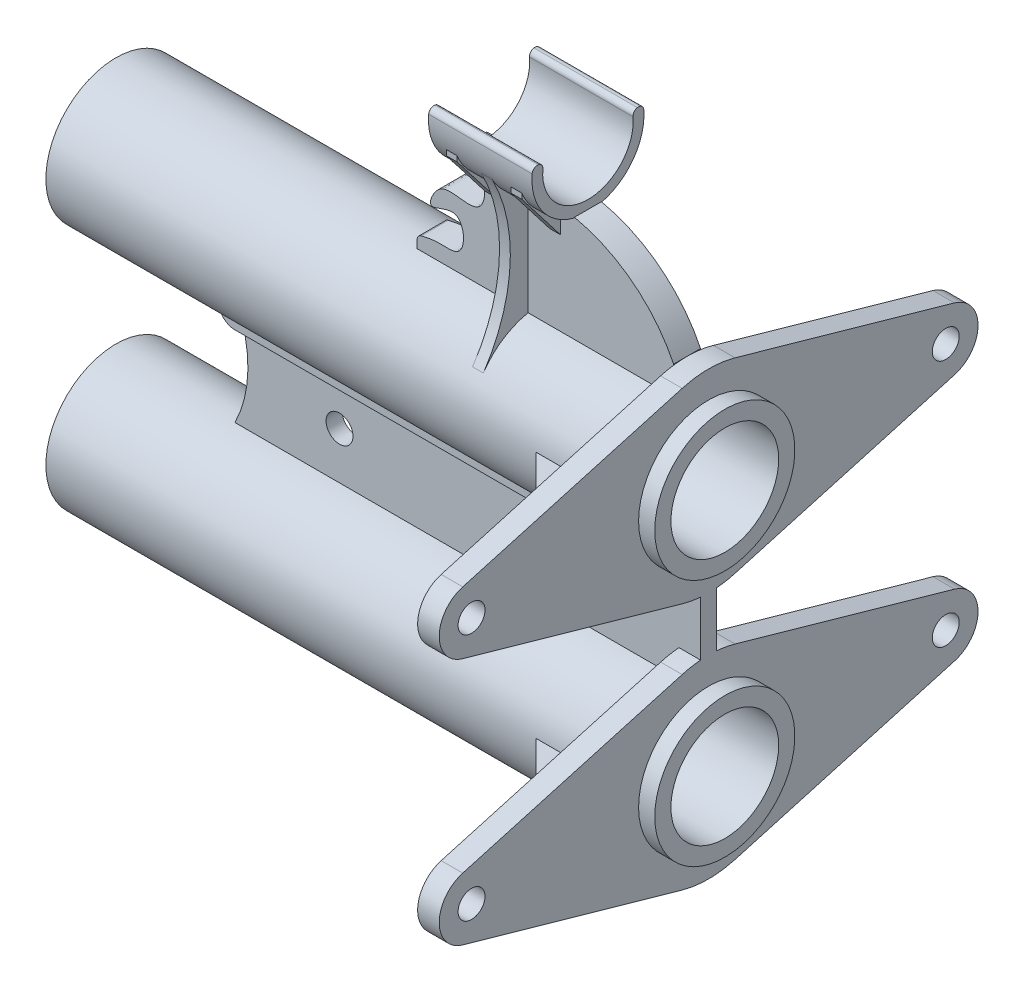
ISO-10303-21;
HEADER;
FILE_DESCRIPTION(('STEP AP214'),'2;1');
FILE_NAME('part.step','',(''),(''),'','','');
FILE_SCHEMA(('AUTOMOTIVE_DESIGN { 1 0 10303 214 1 1 1 1 }'));
ENDSEC;
DATA;
#1=APPLICATION_CONTEXT('core data for automotive mechanical design processes');
#2=APPLICATION_PROTOCOL_DEFINITION('international standard','automotive_design',2000,#1);
#3=PRODUCT_CONTEXT('',#1,'mechanical');
#4=PRODUCT('Part','Part','',(#3));
#5=PRODUCT_RELATED_PRODUCT_CATEGORY('part','',(#4));
#6=PRODUCT_DEFINITION_FORMATION('','',#4);
#7=PRODUCT_DEFINITION_CONTEXT('part definition',#1,'design');
#8=PRODUCT_DEFINITION('design','',#6,#7);
#9=PRODUCT_DEFINITION_SHAPE('','',#8);
#10=(LENGTH_UNIT() NAMED_UNIT(*) SI_UNIT(.MILLI.,.METRE.));
#11=(NAMED_UNIT(*) PLANE_ANGLE_UNIT() SI_UNIT($,.RADIAN.));
#12=(NAMED_UNIT(*) SI_UNIT($,.STERADIAN.) SOLID_ANGLE_UNIT());
#13=UNCERTAINTY_MEASURE_WITH_UNIT(LENGTH_MEASURE(1.E-05),#10,'distance_accuracy_value','');
#14=(GEOMETRIC_REPRESENTATION_CONTEXT(3) GLOBAL_UNCERTAINTY_ASSIGNED_CONTEXT((#13)) GLOBAL_UNIT_ASSIGNED_CONTEXT((#10,
#11,#12)) REPRESENTATION_CONTEXT('',''));
#15=CARTESIAN_POINT('',(0.,0.,0.));
#16=DIRECTION('',(0.,0.,1.));
#17=DIRECTION('',(1.,0.,0.));
#18=AXIS2_PLACEMENT_3D('',#15,#16,#17);
#19=CARTESIAN_POINT('',(-69.85,29.21,0.));
#20=DIRECTION('',(1.,0.,0.));
#21=DIRECTION('',(0.,0.,-1.));
#22=AXIS2_PLACEMENT_3D('',#19,#20,#21);
#23=CYLINDRICAL_SURFACE('',#22,8.255);
#24=CARTESIAN_POINT('',(-69.85,29.21,0.));
#25=DIRECTION('',(1.,0.,0.));
#26=DIRECTION('',(0.,0.,-1.));
#27=AXIS2_PLACEMENT_3D('',#24,#25,#26);
#28=CIRCLE('',#27,8.255);
#29=CARTESIAN_POINT('',(-69.85,29.21,-8.255));
#30=VERTEX_POINT('',#29);
#31=EDGE_CURVE('E1283',#30,#30,#28,.T.);
#32=ORIENTED_EDGE('',*,*,#31,.T.);
#33=EDGE_LOOP('',(#32));
#34=FACE_BOUND('',#33,.T.);
#35=CARTESIAN_POINT('',(-69.85,28.5422193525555,-8.22794591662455));
#36=CARTESIAN_POINT('',(-69.678144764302,28.5714731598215,-8.230312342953));
#37=CARTESIAN_POINT('',(-69.5057444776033,28.5975459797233,-8.23227898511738));
#38=CARTESIAN_POINT('',(-69.1600929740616,28.6432995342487,-8.23555920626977));
#39=CARTESIAN_POINT('',(-68.9868417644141,28.6629803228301,-8.23687279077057));
#40=CARTESIAN_POINT('',(-68.639741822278,28.6959185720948,-8.23899333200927));
#41=CARTESIAN_POINT('',(-68.4658931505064,28.7091766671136,-8.23980033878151));
#42=CARTESIAN_POINT('',(-68.117831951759,28.7292553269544,-8.24099528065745));
#43=CARTESIAN_POINT('',(-67.9436194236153,28.736075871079,-8.24138321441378));
#44=CARTESIAN_POINT('',(-67.4199668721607,28.7468777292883,-8.2420063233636));
#45=CARTESIAN_POINT('',(-67.070271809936,28.7411271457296,-8.24169674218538));
#46=CARTESIAN_POINT('',(-66.3722937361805,28.7037343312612,-8.23948054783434));
#47=CARTESIAN_POINT('',(-66.0240108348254,28.6720901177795,-8.23757381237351));
#48=CARTESIAN_POINT('',(-65.2837943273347,28.5770525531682,-8.23085787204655));
#49=CARTESIAN_POINT('',(-64.8923340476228,28.509941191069,-8.2256906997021));
#50=CARTESIAN_POINT('',(-64.1164803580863,28.3430425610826,-8.20977583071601));
#51=CARTESIAN_POINT('',(-63.7320882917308,28.2432491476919,-8.19902708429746));
#52=CARTESIAN_POINT('',(-62.9736934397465,28.0119059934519,-8.16842680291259));
#53=CARTESIAN_POINT('',(-62.5996819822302,27.8803837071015,-8.1485831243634));
#54=CARTESIAN_POINT('',(-61.8649042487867,27.5867986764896,-8.09521471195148));
#55=CARTESIAN_POINT('',(-61.5041332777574,27.4247468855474,-8.06169487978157));
#56=CARTESIAN_POINT('',(-60.8926994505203,27.1188317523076,-7.98685062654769));
#57=CARTESIAN_POINT('',(-60.638194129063,26.9815294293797,-7.94994868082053));
#58=CARTESIAN_POINT('',(-60.1397165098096,26.6926463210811,-7.86324999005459));
#59=CARTESIAN_POINT('',(-59.895741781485,26.5410688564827,-7.81345623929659));
#60=CARTESIAN_POINT('',(-59.4203381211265,26.2254352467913,-7.69841290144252));
#61=CARTESIAN_POINT('',(-59.1888899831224,26.0613991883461,-7.63318784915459));
#62=CARTESIAN_POINT('',(-58.7399498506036,25.7227803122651,-7.48454962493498));
#63=CARTESIAN_POINT('',(-58.522454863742,25.5481997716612,-7.40114036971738));
#64=CARTESIAN_POINT('',(-58.1454321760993,25.2272201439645,-7.23245591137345));
#65=CARTESIAN_POINT('',(-57.9830405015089,25.082210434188,-7.15092610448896));
#66=CARTESIAN_POINT('',(-57.6692963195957,24.7890883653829,-6.97351398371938));
#67=CARTESIAN_POINT('',(-57.5179412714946,24.6409767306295,-6.87763498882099));
#68=CARTESIAN_POINT('',(-57.2271222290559,24.3437517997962,-6.67063989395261));
#69=CARTESIAN_POINT('',(-57.0876563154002,24.1946386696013,-6.55952626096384));
#70=CARTESIAN_POINT('',(-56.8213008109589,23.8977578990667,-6.32149494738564));
#71=CARTESIAN_POINT('',(-56.6944113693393,23.7499902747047,-6.19457707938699));
#72=CARTESIAN_POINT('',(-56.4529773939,23.4574641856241,-5.92395929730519));
#73=CARTESIAN_POINT('',(-56.3385142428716,23.3127300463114,-5.78016024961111));
#74=CARTESIAN_POINT('',(-56.1231045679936,23.0299166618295,-5.47673263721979));
#75=CARTESIAN_POINT('',(-56.0221582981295,22.891837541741,-5.3171037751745));
#76=CARTESIAN_POINT('',(-55.8337820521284,22.6249950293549,-4.98281711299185));
#77=CARTESIAN_POINT('',(-55.7463506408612,22.4962306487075,-4.80816091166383));
#78=CARTESIAN_POINT('',(-55.584723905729,22.2504715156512,-4.44500213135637));
#79=CARTESIAN_POINT('',(-55.5105274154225,22.1334757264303,-4.25650077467));
#80=CARTESIAN_POINT('',(-55.3819766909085,21.9249290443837,-3.88752912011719));
#81=CARTESIAN_POINT('',(-55.3263595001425,21.8319968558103,-3.70827578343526));
#82=CARTESIAN_POINT('',(-55.2249219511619,21.6586518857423,-3.34116185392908));
#83=CARTESIAN_POINT('',(-55.1791008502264,21.5782381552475,-3.15330191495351));
#84=CARTESIAN_POINT('',(-55.0967942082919,21.4310367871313,-2.77035010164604));
#85=CARTESIAN_POINT('',(-55.0603083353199,21.3642486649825,-2.57525848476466));
#86=CARTESIAN_POINT('',(-54.9962247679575,21.245169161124,-2.17927528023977));
#87=CARTESIAN_POINT('',(-54.9686271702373,21.1928779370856,-1.97838362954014));
#88=CARTESIAN_POINT('',(-54.9223820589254,21.1043028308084,-1.57616494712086));
#89=CARTESIAN_POINT('',(-54.9035738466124,21.0677326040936,-1.37491933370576));
#90=CARTESIAN_POINT('',(-54.8738633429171,21.0095974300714,-0.969699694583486));
#91=CARTESIAN_POINT('',(-54.8629609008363,20.9880321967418,-0.765725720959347));
#92=CARTESIAN_POINT('',(-54.8488912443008,20.9601501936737,-0.356470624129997));
#93=CARTESIAN_POINT('',(-54.8457241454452,20.953833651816,-0.151189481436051));
#94=CARTESIAN_POINT('',(-54.8470746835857,20.9565199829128,0.259249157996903));
#95=CARTESIAN_POINT('',(-54.8515924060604,20.9655230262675,0.464406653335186));
#96=CARTESIAN_POINT('',(-54.8684625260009,20.9989019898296,0.875054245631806));
#97=CARTESIAN_POINT('',(-54.8808868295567,21.0234189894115,1.08052994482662));
#98=CARTESIAN_POINT('',(-54.9138323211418,21.0876713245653,1.48843187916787));
#99=CARTESIAN_POINT('',(-54.934353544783,21.1274067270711,1.69085810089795));
#100=CARTESIAN_POINT('',(-54.9837947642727,21.2216194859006,2.09119181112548));
#101=CARTESIAN_POINT('',(-55.0127142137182,21.2760958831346,2.28909959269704));
#102=CARTESIAN_POINT('',(-55.0793388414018,21.3991165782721,2.67897502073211));
#103=CARTESIAN_POINT('',(-55.1170439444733,21.4676607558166,2.87094271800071));
#104=CARTESIAN_POINT('',(-55.2015173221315,21.6176456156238,3.24684053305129));
#105=CARTESIAN_POINT('',(-55.2482510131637,21.6990368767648,3.43079813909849));
#106=CARTESIAN_POINT('',(-55.351311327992,21.8738005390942,3.79013415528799));
#107=CARTESIAN_POINT('',(-55.4076378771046,21.9671728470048,3.96551263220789));
#108=CARTESIAN_POINT('',(-55.5302710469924,22.1645570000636,4.3064542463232));
#109=CARTESIAN_POINT('',(-55.5965750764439,22.2685660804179,4.47201991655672));
#110=CARTESIAN_POINT('',(-55.7394928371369,22.4857260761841,4.79234887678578));
#111=CARTESIAN_POINT('',(-55.8161065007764,22.5988769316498,4.94711223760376));
#112=CARTESIAN_POINT('',(-55.979327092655,22.8319056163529,5.24407666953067));
#113=CARTESIAN_POINT('',(-56.0658687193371,22.9517370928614,5.38635006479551));
#114=CARTESIAN_POINT('',(-56.2493645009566,23.1969947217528,5.65883337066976));
#115=CARTESIAN_POINT('',(-56.3463185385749,23.3224208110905,5.78904341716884));
#116=CARTESIAN_POINT('',(-56.5505166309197,23.5770522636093,6.03709540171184));
#117=CARTESIAN_POINT('',(-56.6577606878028,23.7062576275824,6.1549373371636));
#118=CARTESIAN_POINT('',(-56.8822659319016,23.966663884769,6.37823480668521));
#119=CARTESIAN_POINT('',(-56.9995282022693,24.0978649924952,6.48368899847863));
#120=CARTESIAN_POINT('',(-57.2496318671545,24.3669872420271,6.68730938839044));
#121=CARTESIAN_POINT('',(-57.3829553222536,24.5049223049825,6.78486428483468));
#122=CARTESIAN_POINT('',(-57.6595353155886,24.7792802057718,6.96712845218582));
#123=CARTESIAN_POINT('',(-57.8027919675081,24.9157030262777,7.05183757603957));
#124=CARTESIAN_POINT('',(-58.0986048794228,25.185502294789,7.20921971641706));
#125=CARTESIAN_POINT('',(-58.2511652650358,25.3188773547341,7.28188733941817));
#126=CARTESIAN_POINT('',(-58.5647933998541,25.5811685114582,7.41608496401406));
#127=CARTESIAN_POINT('',(-58.7258627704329,25.7100837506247,7.47761283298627));
#128=CARTESIAN_POINT('',(-59.1339673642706,26.0220928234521,7.61733398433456));
#129=CARTESIAN_POINT('',(-59.3855644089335,26.2019056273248,7.6896043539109));
#130=CARTESIAN_POINT('',(-59.9032908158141,26.5465011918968,7.81565703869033));
#131=CARTESIAN_POINT('',(-60.1694259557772,26.7112779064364,7.86943194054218));
#132=CARTESIAN_POINT('',(-60.7144668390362,27.0240106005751,7.96197918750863));
#133=CARTESIAN_POINT('',(-60.9933931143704,27.1719381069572,8.00072639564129));
#134=CARTESIAN_POINT('',(-61.5616092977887,27.4492227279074,8.06628704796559));
#135=CARTESIAN_POINT('',(-61.8508982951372,27.5785814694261,8.09310153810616));
#136=CARTESIAN_POINT('',(-62.4445245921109,27.8203809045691,8.13814730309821));
#137=CARTESIAN_POINT('',(-62.7490526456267,27.9323896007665,8.15617798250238));
#138=CARTESIAN_POINT('',(-63.3653826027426,28.1352724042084,8.18538271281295));
#139=CARTESIAN_POINT('',(-63.67718473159,28.2261458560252,8.19655655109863));
#140=CARTESIAN_POINT('',(-64.3062204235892,28.3861862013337,8.21418494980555));
#141=CARTESIAN_POINT('',(-64.6234503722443,28.4553669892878,8.22064253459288));
#142=CARTESIAN_POINT('',(-65.2619655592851,28.5717432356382,8.23049596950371));
#143=CARTESIAN_POINT('',(-65.5832508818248,28.6189382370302,8.23389175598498));
#144=CARTESIAN_POINT('',(-66.2335733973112,28.6916947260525,8.23879488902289));
#145=CARTESIAN_POINT('',(-66.5626516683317,28.7168917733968,8.2402706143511));
#146=CARTESIAN_POINT('',(-67.2217632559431,28.7442115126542,8.24185962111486));
#147=CARTESIAN_POINT('',(-67.5517965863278,28.7463338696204,8.24197288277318));
#148=CARTESIAN_POINT('',(-68.211346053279,28.727484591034,8.24089217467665));
#149=CARTESIAN_POINT('',(-68.5408619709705,28.7065049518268,8.23969775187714));
#150=CARTESIAN_POINT('',(-69.0333644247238,28.6577958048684,8.23652469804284));
#151=CARTESIAN_POINT('',(-69.1972494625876,28.6386839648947,8.23523662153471));
#152=CARTESIAN_POINT('',(-69.524248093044,28.5947375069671,8.23206830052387));
#153=CARTESIAN_POINT('',(-69.6873616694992,28.5699027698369,8.23018804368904));
#154=CARTESIAN_POINT('',(-69.85,28.5422193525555,8.22794591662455));
#155=B_SPLINE_CURVE_WITH_KNOTS('',3,(#35,#36,#37,#38,#39,#40,#41,#42,#43,#44,#45,#46,#47,#48,
#49,#50,#51,#52,#53,#54,#55,#56,#57,#58,#59,#60,#61,#62,#63,#64,#65,#66,#67,#68,#69,#70,#71,#72,
#73,#74,#75,#76,#77,#78,#79,#80,#81,#82,#83,#84,#85,#86,#87,#88,#89,#90,#91,#92,#93,#94,#95,#96,
#97,#98,#99,#100,#101,#102,#103,#104,#105,#106,#107,#108,#109,#110,#111,#112,#113,#114,#115,
#116,#117,#118,#119,#120,#121,#122,#123,#124,#125,#126,#127,#128,#129,#130,#131,#132,#133,#134,
#135,#136,#137,#138,#139,#140,#141,#142,#143,#144,#145,#146,#147,#148,#149,#150,#151,#152,#153,
#154),.UNSPECIFIED.,.F.,.F.,(4,2,2,2,2,2,2,2,2,2,2,2,2,2,2,2,2,2,2,2,2,2,2,2,2,2,2,2,2,2,2,2,2,
2,2,2,2,2,2,2,2,2,2,2,2,2,2,2,2,2,2,2,2,2,2,2,2,2,2,4),(0.,0.522996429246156,1.0459884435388,
1.56892879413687,2.09187082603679,3.14003933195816,4.18828809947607,5.37843882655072,
6.56881347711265,7.7581617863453,8.94708419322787,9.82092686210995,10.6945667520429,
11.5668268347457,12.4388992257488,13.1356721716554,13.832284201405,14.5287835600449,
15.2252911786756,15.9261154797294,16.6269529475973,17.327715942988,18.0284171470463,
18.655945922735,19.2834271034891,19.9108859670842,20.5383516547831,21.1538470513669,
21.7693307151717,22.3848235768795,23.00032328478,23.6215022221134,24.2426838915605,
24.8638251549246,25.4849611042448,26.1037633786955,26.7225608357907,27.34119785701,
27.9598308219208,28.5746057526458,29.1893737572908,29.8041418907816,30.4189765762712,
31.0639728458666,31.708976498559,32.354268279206,32.999683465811,33.9510019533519,
34.9027013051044,35.8559857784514,36.8091866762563,37.7832394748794,38.757322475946,
39.730780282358,40.704258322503,41.6935735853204,42.6829032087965,43.6725756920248,
44.1674896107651,44.6624138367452),.UNSPECIFIED.);
#156=CARTESIAN_POINT('',(-55.1160581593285,21.465342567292,-2.8575));
#157=VERTEX_POINT('',#156);
#158=CARTESIAN_POINT('',(-55.1160581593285,21.465342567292,2.8575));
#159=VERTEX_POINT('',#158);
#160=EDGE_CURVE('E572',#157,#159,#155,.T.);
#161=ORIENTED_EDGE('',*,*,#160,.T.);
#162=DIRECTION('',(1.,0.,0.));
#163=VECTOR('',#162,1.);
#164=CARTESIAN_POINT('',(-69.851,21.465342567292,2.8575));
#165=LINE('',#164,#163);
#166=CARTESIAN_POINT('',(-2.54,21.465342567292,2.8575));
#167=VERTEX_POINT('',#166);
#168=EDGE_CURVE('E569',#159,#167,#165,.T.);
#169=ORIENTED_EDGE('',*,*,#168,.T.);
#170=CARTESIAN_POINT('',(-2.54,29.21,0.));
#171=DIRECTION('',(1.,0.,0.));
#172=DIRECTION('',(0.,0.,-1.));
#173=AXIS2_PLACEMENT_3D('',#170,#171,#172);
#174=CIRCLE('',#173,8.255);
#175=CARTESIAN_POINT('',(-2.54,28.2575,8.19986394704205));
#176=VERTEX_POINT('',#175);
#177=EDGE_CURVE('E550',#167,#176,#174,.F.);
#178=ORIENTED_EDGE('',*,*,#177,.T.);
#179=DIRECTION('',(1.,0.,0.));
#180=VECTOR('',#179,1.);
#181=CARTESIAN_POINT('',(-69.85,28.2575,8.19986394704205));
#182=LINE('',#181,#180);
#183=CARTESIAN_POINT('',(-12.1201360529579,28.2575,8.19986394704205));
#184=VERTEX_POINT('',#183);
#185=EDGE_CURVE('E1409',#176,#184,#182,.F.);
#186=ORIENTED_EDGE('',*,*,#185,.T.);
#187=CARTESIAN_POINT('',(-20.32,29.21,0.));
#188=DIRECTION('',(0.707106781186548,0.,-0.707106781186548));
#189=DIRECTION('',(0.707106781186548,0.,0.707106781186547));
#190=AXIS2_PLACEMENT_3D('',#187,#188,#189);
#191=ELLIPSE('',#190,11.6743329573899,8.255);
#192=CARTESIAN_POINT('',(-12.120136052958,30.1625,8.19986394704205));
#193=VERTEX_POINT('',#192);
#194=EDGE_CURVE('E1404',#184,#193,#191,.F.);
#195=ORIENTED_EDGE('',*,*,#194,.T.);
#196=DIRECTION('',(1.,0.,0.));
#197=VECTOR('',#196,1.);
#198=CARTESIAN_POINT('',(-69.85,30.1625,8.19986394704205));
#199=LINE('',#198,#197);
#200=CARTESIAN_POINT('',(-2.54,30.1625,8.19986394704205));
#201=VERTEX_POINT('',#200);
#202=EDGE_CURVE('E1406',#201,#193,#199,.F.);
#203=ORIENTED_EDGE('',*,*,#202,.F.);
#204=CARTESIAN_POINT('',(-2.54,37.3109177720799,1.5875));
#205=VERTEX_POINT('',#204);
#206=EDGE_CURVE('E563',#201,#205,#174,.F.);
#207=ORIENTED_EDGE('',*,*,#206,.T.);
#208=DIRECTION('',(1.,0.,0.));
#209=VECTOR('',#208,1.);
#210=CARTESIAN_POINT('',(-69.85,37.3109177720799,1.5875));
#211=LINE('',#210,#209);
#212=CARTESIAN_POINT('',(-19.685,37.3109177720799,1.5875));
#213=VERTEX_POINT('',#212);
#214=EDGE_CURVE('E1422',#213,#205,#211,.T.);
#215=ORIENTED_EDGE('',*,*,#214,.F.);
#216=CARTESIAN_POINT('',(-19.685,29.21,0.));
#217=DIRECTION('',(-1.,0.,0.));
#218=DIRECTION('',(0.,0.,1.));
#219=AXIS2_PLACEMENT_3D('',#216,#217,#218);
#220=CIRCLE('',#219,8.255);
#221=CARTESIAN_POINT('',(-19.685,33.795260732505,6.86443071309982));
#222=VERTEX_POINT('',#221);
#223=EDGE_CURVE('E649',#222,#213,#220,.T.);
#224=ORIENTED_EDGE('',*,*,#223,.F.);
#225=DIRECTION('',(1.,0.,0.));
#226=VECTOR('',#225,1.);
#227=CARTESIAN_POINT('',(-20.955,33.795260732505,6.86443071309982));
#228=LINE('',#227,#226);
#229=CARTESIAN_POINT('',(-20.955,33.795260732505,6.86443071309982));
#230=VERTEX_POINT('',#229);
#231=EDGE_CURVE('E669',#230,#222,#228,.T.);
#232=ORIENTED_EDGE('',*,*,#231,.F.);
#233=CARTESIAN_POINT('',(-20.955,29.21,0.));
#234=DIRECTION('',(-1.,0.,0.));
#235=DIRECTION('',(0.,0.,1.));
#236=AXIS2_PLACEMENT_3D('',#233,#234,#235);
#237=CIRCLE('',#236,8.255);
#238=CARTESIAN_POINT('',(-20.955,37.3109177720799,1.5875));
#239=VERTEX_POINT('',#238);
#240=EDGE_CURVE('E660',#230,#239,#237,.T.);
#241=ORIENTED_EDGE('',*,*,#240,.T.);
#242=CARTESIAN_POINT('',(-32.766,37.3109177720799,1.5875));
#243=VERTEX_POINT('',#242);
#244=EDGE_CURVE('E1419',#243,#239,#211,.T.);
#245=ORIENTED_EDGE('',*,*,#244,.F.);
#246=CARTESIAN_POINT('',(-32.766,29.21,0.));
#247=DIRECTION('',(-1.,0.,0.));
#248=DIRECTION('',(0.,0.,1.));
#249=AXIS2_PLACEMENT_3D('',#246,#247,#248);
#250=CIRCLE('',#249,8.255);
#251=CARTESIAN_POINT('',(-32.766,37.3109177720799,-1.5875));
#252=VERTEX_POINT('',#251);
#253=EDGE_CURVE('E1443',#252,#243,#250,.F.);
#254=ORIENTED_EDGE('',*,*,#253,.F.);
#255=DIRECTION('',(1.,0.,0.));
#256=VECTOR('',#255,1.);
#257=CARTESIAN_POINT('',(-69.85,37.3109177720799,-1.5875));
#258=LINE('',#257,#256);
#259=CARTESIAN_POINT('',(-20.955,37.3109177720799,-1.5875));
#260=VERTEX_POINT('',#259);
#261=EDGE_CURVE('E1423',#252,#260,#258,.T.);
#262=ORIENTED_EDGE('',*,*,#261,.T.);
#263=CARTESIAN_POINT('',(-20.955,29.21,0.));
#264=DIRECTION('',(1.,0.,0.));
#265=DIRECTION('',(0.,0.,-1.));
#266=AXIS2_PLACEMENT_3D('',#263,#264,#265);
#267=CIRCLE('',#266,8.255);
#268=CARTESIAN_POINT('',(-20.955,33.795260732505,-6.86443071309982));
#269=VERTEX_POINT('',#268);
#270=EDGE_CURVE('E760',#269,#260,#267,.T.);
#271=ORIENTED_EDGE('',*,*,#270,.F.);
#272=DIRECTION('',(1.,0.,0.));
#273=VECTOR('',#272,1.);
#274=CARTESIAN_POINT('',(-20.955,33.795260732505,-6.86443071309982));
#275=LINE('',#274,#273);
#276=CARTESIAN_POINT('',(-19.685,33.795260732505,-6.86443071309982));
#277=VERTEX_POINT('',#276);
#278=EDGE_CURVE('E764',#269,#277,#275,.T.);
#279=ORIENTED_EDGE('',*,*,#278,.T.);
#280=CARTESIAN_POINT('',(-19.685,29.21,0.));
#281=DIRECTION('',(1.,0.,0.));
#282=DIRECTION('',(0.,0.,-1.));
#283=AXIS2_PLACEMENT_3D('',#280,#281,#282);
#284=CIRCLE('',#283,8.255);
#285=CARTESIAN_POINT('',(-19.685,37.3109177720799,-1.5875));
#286=VERTEX_POINT('',#285);
#287=EDGE_CURVE('E749',#277,#286,#284,.T.);
#288=ORIENTED_EDGE('',*,*,#287,.T.);
#289=CARTESIAN_POINT('',(-2.54,37.3109177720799,-1.5875));
#290=VERTEX_POINT('',#289);
#291=EDGE_CURVE('E1426',#286,#290,#258,.T.);
#292=ORIENTED_EDGE('',*,*,#291,.T.);
#293=CARTESIAN_POINT('',(-2.54,30.1625,-8.19986394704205));
#294=VERTEX_POINT('',#293);
#295=EDGE_CURVE('E565',#290,#294,#174,.F.);
#296=ORIENTED_EDGE('',*,*,#295,.T.);
#297=DIRECTION('',(1.,0.,0.));
#298=VECTOR('',#297,1.);
#299=CARTESIAN_POINT('',(-69.85,30.1625,-8.19986394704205));
#300=LINE('',#299,#298);
#301=CARTESIAN_POINT('',(-12.120136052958,30.1625,-8.19986394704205));
#302=VERTEX_POINT('',#301);
#303=EDGE_CURVE('E1389',#302,#294,#300,.T.);
#304=ORIENTED_EDGE('',*,*,#303,.F.);
#305=CARTESIAN_POINT('',(-20.32,29.21,0.));
#306=DIRECTION('',(-0.707106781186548,0.,-0.707106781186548));
#307=DIRECTION('',(0.707106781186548,0.,-0.707106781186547));
#308=AXIS2_PLACEMENT_3D('',#305,#306,#307);
#309=ELLIPSE('',#308,11.6743329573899,8.255);
#310=CARTESIAN_POINT('',(-12.1201360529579,28.2575,-8.19986394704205));
#311=VERTEX_POINT('',#310);
#312=EDGE_CURVE('E1386',#311,#302,#309,.F.);
#313=ORIENTED_EDGE('',*,*,#312,.F.);
#314=DIRECTION('',(1.,0.,0.));
#315=VECTOR('',#314,1.);
#316=CARTESIAN_POINT('',(-69.85,28.2575,-8.19986394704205));
#317=LINE('',#316,#315);
#318=CARTESIAN_POINT('',(-2.54,28.2575,-8.19986394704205));
#319=VERTEX_POINT('',#318);
#320=EDGE_CURVE('E1392',#311,#319,#317,.T.);
#321=ORIENTED_EDGE('',*,*,#320,.T.);
#322=CARTESIAN_POINT('',(-2.54,21.465342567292,-2.8575));
#323=VERTEX_POINT('',#322);
#324=EDGE_CURVE('E566',#319,#323,#174,.F.);
#325=ORIENTED_EDGE('',*,*,#324,.T.);
#326=DIRECTION('',(1.,0.,0.));
#327=VECTOR('',#326,1.);
#328=CARTESIAN_POINT('',(-69.851,21.465342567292,-2.8575));
#329=LINE('',#328,#327);
#330=EDGE_CURVE('E681',#157,#323,#329,.T.);
#331=ORIENTED_EDGE('',*,*,#330,.F.);
#332=EDGE_LOOP('',(#161,#169,#178,#186,#195,#203,#207,#215,#224,#232,#241,#245,#254,#262,#271,
#279,#288,#292,#296,#304,#313,#321,#325,#331));
#333=FACE_BOUND('',#332,.T.);
#334=ADVANCED_FACE('F26',(#34,#333),#23,.T.);
#335=CARTESIAN_POINT('',(-17.78,33.2105,1.5875));
#336=DIRECTION('',(0.,0.,1.));
#337=DIRECTION('',(1.,0.,0.));
#338=AXIS2_PLACEMENT_3D('',#335,#336,#337);
#339=PLANE('',#338);
#340=DIRECTION('',(0.,1.,0.));
#341=VECTOR('',#340,1.);
#342=CARTESIAN_POINT('',(-24.765,47.1836443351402,1.5875));
#343=LINE('',#342,#341);
#344=CARTESIAN_POINT('',(-24.765,47.1836443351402,1.5875));
#345=VERTEX_POINT('',#344);
#346=CARTESIAN_POINT('',(-24.765,49.7236443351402,1.5875));
#347=VERTEX_POINT('',#346);
#348=EDGE_CURVE('E626',#345,#347,#343,.T.);
#349=ORIENTED_EDGE('',*,*,#348,.T.);
#350=DIRECTION('',(-1.,0.,0.));
#351=VECTOR('',#350,1.);
#352=CARTESIAN_POINT('',(-14.224,49.7236443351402,1.5875));
#353=LINE('',#352,#351);
#354=CARTESIAN_POINT('',(-26.416,49.7236443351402,1.5875));
#355=VERTEX_POINT('',#354);
#356=EDGE_CURVE('E798',#347,#355,#353,.T.);
#357=ORIENTED_EDGE('',*,*,#356,.T.);
#358=DIRECTION('',(0.,1.,0.));
#359=VECTOR('',#358,1.);
#360=CARTESIAN_POINT('',(-26.416,33.2105,1.5875));
#361=LINE('',#360,#359);
#362=CARTESIAN_POINT('',(-26.416,50.165,1.5875));
#363=VERTEX_POINT('',#362);
#364=EDGE_CURVE('E791',#355,#363,#361,.T.);
#365=ORIENTED_EDGE('',*,*,#364,.T.);
#366=DIRECTION('',(1.,0.,0.));
#367=VECTOR('',#366,1.);
#368=CARTESIAN_POINT('',(-27.94,50.165,1.5875));
#369=LINE('',#368,#367);
#370=CARTESIAN_POINT('',(-27.5077854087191,50.165,1.5875));
#371=VERTEX_POINT('',#370);
#372=EDGE_CURVE('E826',#371,#363,#369,.T.);
#373=ORIENTED_EDGE('',*,*,#372,.F.);
#374=CARTESIAN_POINT('',(-27.5077854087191,49.53,1.5875));
#375=DIRECTION('',(0.,0.,1.));
#376=DIRECTION('',(1.,0.,0.));
#377=AXIS2_PLACEMENT_3D('',#374,#375,#376);
#378=CIRCLE('',#377,0.635);
#379=CARTESIAN_POINT('',(-28.0952549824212,49.7710487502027,1.5875));
#380=VERTEX_POINT('',#379);
#381=EDGE_CURVE('E1464',#371,#380,#378,.T.);
#382=ORIENTED_EDGE('',*,*,#381,.T.);
#383=CARTESIAN_POINT('',(-32.766,38.735,1.5875));
#384=CARTESIAN_POINT('',(-31.971942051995,38.9465133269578,1.5875));
#385=CARTESIAN_POINT('',(-30.3838261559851,39.3695399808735,1.5875));
#386=CARTESIAN_POINT('',(-26.8521600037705,38.7535001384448,1.5875));
#387=CARTESIAN_POINT('',(-27.3556929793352,44.6794407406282,1.5875));
#388=CARTESIAN_POINT('',(-31.9817472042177,41.4137309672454,1.5875));
#389=CARTESIAN_POINT('',(-30.3304275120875,45.3163879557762,1.5875));
#390=CARTESIAN_POINT('',(-27.8795990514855,44.9694930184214,1.5875));
#391=CARTESIAN_POINT('',(-24.4555854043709,44.6246930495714,1.5875));
#392=CARTESIAN_POINT('',(-24.7115071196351,50.554523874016,1.5875));
#393=CARTESIAN_POINT('',(-29.2918668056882,47.4836542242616,1.5875));
#394=CARTESIAN_POINT('',(-28.2593808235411,49.3368799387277,1.5875));
#395=CARTESIAN_POINT('',(-28.0464602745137,49.8889599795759,1.5875));
#396=CARTESIAN_POINT('',(-27.94,50.165,1.5875));
#397=B_SPLINE_CURVE_WITH_KNOTS('',3,(#383,#384,#385,#386,#387,#388,#389,#390,#391,#392,#393,
#394,#395,#396),.UNSPECIFIED.,.F.,.F.,(4,1,1,1,1,1,1,1,1,1,1,4),(0.,0.0946805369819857,
0.189361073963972,0.320714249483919,0.425425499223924,0.503720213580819,0.598400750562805,
0.693081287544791,0.824434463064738,0.929145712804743,0.964572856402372,1.),.UNSPECIFIED.);
#398=CARTESIAN_POINT('',(-32.2878057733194,38.860529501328,1.5875));
#399=VERTEX_POINT('',#398);
#400=EDGE_CURVE('E829',#399,#380,#397,.T.);
#401=ORIENTED_EDGE('',*,*,#400,.F.);
#402=CARTESIAN_POINT('',(-32.131,38.2451946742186,1.5875));
#403=DIRECTION('',(0.,0.,1.));
#404=DIRECTION('',(1.,0.,0.));
#405=AXIS2_PLACEMENT_3D('',#402,#403,#404);
#406=CIRCLE('',#405,0.635);
#407=CARTESIAN_POINT('',(-32.766,38.2451946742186,1.5875));
#408=VERTEX_POINT('',#407);
#409=EDGE_CURVE('E1449',#399,#408,#406,.T.);
#410=ORIENTED_EDGE('',*,*,#409,.T.);
#411=DIRECTION('',(0.,1.,0.));
#412=VECTOR('',#411,1.);
#413=CARTESIAN_POINT('',(-32.766,36.5125,1.5875));
#414=LINE('',#413,#412);
#415=EDGE_CURVE('E835',#243,#408,#414,.T.);
#416=ORIENTED_EDGE('',*,*,#415,.F.);
#417=ORIENTED_EDGE('',*,*,#244,.T.);
#418=DIRECTION('',(0.,1.,0.));
#419=VECTOR('',#418,1.);
#420=CARTESIAN_POINT('',(-20.955,37.3109177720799,1.5875));
#421=LINE('',#420,#419);
#422=CARTESIAN_POINT('',(-20.955,49.7236443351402,1.5875));
#423=VERTEX_POINT('',#422);
#424=EDGE_CURVE('E657',#239,#423,#421,.T.);
#425=ORIENTED_EDGE('',*,*,#424,.T.);
#426=CARTESIAN_POINT('',(-23.495,49.7236443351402,1.5875));
#427=VERTEX_POINT('',#426);
#428=EDGE_CURVE('E804',#423,#427,#353,.T.);
#429=ORIENTED_EDGE('',*,*,#428,.T.);
#430=DIRECTION('',(0.,1.,0.));
#431=VECTOR('',#430,1.);
#432=CARTESIAN_POINT('',(-23.495,47.1836443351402,1.5875));
#433=LINE('',#432,#431);
#434=CARTESIAN_POINT('',(-23.495,47.1836443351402,1.5875));
#435=VERTEX_POINT('',#434);
#436=EDGE_CURVE('E616',#435,#427,#433,.T.);
#437=ORIENTED_EDGE('',*,*,#436,.F.);
#438=DIRECTION('',(1.,0.,0.));
#439=VECTOR('',#438,1.);
#440=CARTESIAN_POINT('',(-24.765,47.1836443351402,1.5875));
#441=LINE('',#440,#439);
#442=EDGE_CURVE('E641',#345,#435,#441,.T.);
#443=ORIENTED_EDGE('',*,*,#442,.F.);
#444=EDGE_LOOP('',(#349,#357,#365,#373,#382,#401,#410,#416,#417,#425,#429,#437,#443));
#445=FACE_BOUND('',#444,.T.);
#446=ADVANCED_FACE('F946',(#445),#339,.T.);
#447=CARTESIAN_POINT('',(-14.224,56.134,0.));
#448=DIRECTION('',(-1.,0.,0.));
#449=DIRECTION('',(0.,0.,1.));
#450=AXIS2_PLACEMENT_3D('',#447,#448,#449);
#451=CYLINDRICAL_SURFACE('',#450,6.604);
#452=DIRECTION('',(-1.,0.,0.));
#453=VECTOR('',#452,1.);
#454=CARTESIAN_POINT('',(-15.875,53.7094880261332,6.14284605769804));
#455=LINE('',#454,#453);
#456=CARTESIAN_POINT('',(-15.875,53.7094880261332,6.14284605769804));
#457=VERTEX_POINT('',#456);
#458=CARTESIAN_POINT('',(-17.145,53.7094880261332,6.14284605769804));
#459=VERTEX_POINT('',#458);
#460=EDGE_CURVE('E614',#457,#459,#455,.T.);
#461=ORIENTED_EDGE('',*,*,#460,.F.);
#462=CARTESIAN_POINT('',(-15.875,56.134,0.));
#463=DIRECTION('',(1.,0.,0.));
#464=DIRECTION('',(0.,0.,-1.));
#465=AXIS2_PLACEMENT_3D('',#462,#463,#464);
#466=CIRCLE('',#465,6.604);
#467=CARTESIAN_POINT('',(-15.875,49.7236443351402,1.5875));
#468=VERTEX_POINT('',#467);
#469=EDGE_CURVE('E600',#457,#468,#466,.T.);
#470=ORIENTED_EDGE('',*,*,#469,.T.);
#471=CARTESIAN_POINT('',(-14.224,49.7236443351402,1.5875));
#472=VERTEX_POINT('',#471);
#473=EDGE_CURVE('E799',#472,#468,#353,.T.);
#474=ORIENTED_EDGE('',*,*,#473,.F.);
#475=CARTESIAN_POINT('',(-14.224,56.134,0.));
#476=DIRECTION('',(1.,0.,0.));
#477=DIRECTION('',(0.,0.,-1.));
#478=AXIS2_PLACEMENT_3D('',#475,#476,#477);
#479=CIRCLE('',#478,6.604);
#480=CARTESIAN_POINT('',(-14.224,56.7073532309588,6.57906392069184));
#481=VERTEX_POINT('',#480);
#482=EDGE_CURVE('E783',#481,#472,#479,.T.);
#483=ORIENTED_EDGE('',*,*,#482,.F.);
#484=DIRECTION('',(-1.,0.,0.));
#485=VECTOR('',#484,1.);
#486=CARTESIAN_POINT('',(-14.224,56.7073532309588,6.57906392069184));
#487=LINE('',#486,#485);
#488=CARTESIAN_POINT('',(-26.416,56.7073532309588,6.57906392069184));
#489=VERTEX_POINT('',#488);
#490=EDGE_CURVE('E1480',#481,#489,#487,.T.);
#491=ORIENTED_EDGE('',*,*,#490,.T.);
#492=CARTESIAN_POINT('',(-26.416,56.134,0.));
#493=DIRECTION('',(1.,0.,0.));
#494=DIRECTION('',(0.,0.,-1.));
#495=AXIS2_PLACEMENT_3D('',#492,#493,#494);
#496=CIRCLE('',#495,6.604);
#497=EDGE_CURVE('E776',#489,#355,#496,.T.);
#498=ORIENTED_EDGE('',*,*,#497,.T.);
#499=ORIENTED_EDGE('',*,*,#356,.F.);
#500=CARTESIAN_POINT('',(-24.765,56.134,0.));
#501=DIRECTION('',(1.,0.,0.));
#502=DIRECTION('',(0.,0.,-1.));
#503=AXIS2_PLACEMENT_3D('',#500,#501,#502);
#504=CIRCLE('',#503,6.604);
#505=CARTESIAN_POINT('',(-24.765,53.7094880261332,6.14284605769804));
#506=VERTEX_POINT('',#505);
#507=EDGE_CURVE('E633',#506,#347,#504,.T.);
#508=ORIENTED_EDGE('',*,*,#507,.F.);
#509=DIRECTION('',(1.,0.,0.));
#510=VECTOR('',#509,1.);
#511=CARTESIAN_POINT('',(-24.765,53.7094880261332,6.14284605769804));
#512=LINE('',#511,#510);
#513=CARTESIAN_POINT('',(-23.495,53.7094880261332,6.14284605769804));
#514=VERTEX_POINT('',#513);
#515=EDGE_CURVE('E636',#506,#514,#512,.T.);
#516=ORIENTED_EDGE('',*,*,#515,.T.);
#517=CARTESIAN_POINT('',(-23.495,56.134,0.));
#518=DIRECTION('',(1.,0.,0.));
#519=DIRECTION('',(0.,0.,-1.));
#520=AXIS2_PLACEMENT_3D('',#517,#518,#519);
#521=CIRCLE('',#520,6.604);
#522=EDGE_CURVE('E624',#514,#427,#521,.T.);
#523=ORIENTED_EDGE('',*,*,#522,.T.);
#524=ORIENTED_EDGE('',*,*,#428,.F.);
#525=CARTESIAN_POINT('',(-20.955,56.134,0.));
#526=DIRECTION('',(-1.,0.,0.));
#527=DIRECTION('',(0.,0.,1.));
#528=AXIS2_PLACEMENT_3D('',#525,#526,#527);
#529=CIRCLE('',#528,6.604);
#530=CARTESIAN_POINT('',(-20.955,53.0643563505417,5.84723044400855));
#531=VERTEX_POINT('',#530);
#532=EDGE_CURVE('E654',#423,#531,#529,.T.);
#533=ORIENTED_EDGE('',*,*,#532,.T.);
#534=DIRECTION('',(1.,0.,0.));
#535=VECTOR('',#534,1.);
#536=CARTESIAN_POINT('',(-20.955,53.0643563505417,5.84723044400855));
#537=LINE('',#536,#535);
#538=CARTESIAN_POINT('',(-19.685,53.0643563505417,5.84723044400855));
#539=VERTEX_POINT('',#538);
#540=EDGE_CURVE('E666',#531,#539,#537,.T.);
#541=ORIENTED_EDGE('',*,*,#540,.T.);
#542=CARTESIAN_POINT('',(-19.685,56.134,0.));
#543=DIRECTION('',(-1.,0.,0.));
#544=DIRECTION('',(0.,0.,1.));
#545=AXIS2_PLACEMENT_3D('',#542,#543,#544);
#546=CIRCLE('',#545,6.604);
#547=CARTESIAN_POINT('',(-19.685,49.7236443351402,1.5875));
#548=VERTEX_POINT('',#547);
#549=EDGE_CURVE('E644',#548,#539,#546,.T.);
#550=ORIENTED_EDGE('',*,*,#549,.F.);
#551=CARTESIAN_POINT('',(-17.145,49.7236443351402,1.5875));
#552=VERTEX_POINT('',#551);
#553=EDGE_CURVE('E803',#552,#548,#353,.T.);
#554=ORIENTED_EDGE('',*,*,#553,.F.);
#555=CARTESIAN_POINT('',(-17.145,56.134,0.));
#556=DIRECTION('',(1.,0.,0.));
#557=DIRECTION('',(0.,0.,-1.));
#558=AXIS2_PLACEMENT_3D('',#555,#556,#557);
#559=CIRCLE('',#558,6.604);
#560=EDGE_CURVE('E590',#459,#552,#559,.T.);
#561=ORIENTED_EDGE('',*,*,#560,.F.);
#562=EDGE_LOOP('',(#461,#470,#474,#483,#491,#498,#499,#508,#516,#523,#524,#533,#541,#550,#554,#561));
#563=FACE_BOUND('',#562,.T.);
#564=ADVANCED_FACE('F1661',(#563),#451,.T.);
#565=CARTESIAN_POINT('',(-67.4776796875,14.605,-0.9525));
#566=DIRECTION('',(0.,0.,1.));
#567=DIRECTION('',(1.,0.,0.));
#568=AXIS2_PLACEMENT_3D('',#565,#566,#567);
#569=PLANE('',#568);
#570=CARTESIAN_POINT('',(-12.7,13.7414,-0.9525));
#571=DIRECTION('',(0.,0.,1.));
#572=DIRECTION('',(1.,0.,0.));
#573=AXIS2_PLACEMENT_3D('',#570,#571,#572);
#574=CIRCLE('',#573,1.5875);
#575=CARTESIAN_POINT('',(-14.2875,13.7414,-0.9525));
#576=VERTEX_POINT('',#575);
#577=EDGE_CURVE('E1280',#576,#576,#574,.T.);
#578=ORIENTED_EDGE('',*,*,#577,.T.);
#579=EDGE_LOOP('',(#578));
#580=FACE_BOUND('',#579,.T.);
#581=CARTESIAN_POINT('',(-42.545,13.7414,-0.9525));
#582=DIRECTION('',(0.,0.,1.));
#583=DIRECTION('',(1.,0.,0.));
#584=AXIS2_PLACEMENT_3D('',#581,#582,#583);
#585=CIRCLE('',#584,1.5875);
#586=CARTESIAN_POINT('',(-44.1325,13.7414,-0.9525));
#587=VERTEX_POINT('',#586);
#588=EDGE_CURVE('E1272',#587,#587,#585,.T.);
#589=ORIENTED_EDGE('',*,*,#588,.T.);
#590=EDGE_LOOP('',(#589));
#591=FACE_BOUND('',#590,.T.);
#592=CARTESIAN_POINT('',(-67.4776796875,14.605,-0.9525));
#593=DIRECTION('',(0.,0.,1.));
#594=DIRECTION('',(1.,0.,0.));
#595=AXIS2_PLACEMENT_3D('',#592,#593,#594);
#596=CIRCLE('',#595,14.1376796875);
#597=CARTESIAN_POINT('',(-54.8741794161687,8.19986394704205,-0.952499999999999));
#598=VERTEX_POINT('',#597);
#599=CARTESIAN_POINT('',(-54.6978743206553,20.6507060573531,-0.9525));
#600=VERTEX_POINT('',#599);
#601=EDGE_CURVE('E1100',#598,#600,#596,.T.);
#602=ORIENTED_EDGE('',*,*,#601,.T.);
#603=CARTESIAN_POINT('',(-52.9758428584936,21.4653425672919,-0.9525));
#604=DIRECTION('',(0.,0.,1.));
#605=DIRECTION('',(1.,0.,0.));
#606=AXIS2_PLACEMENT_3D('',#603,#604,#605);
#607=CIRCLE('',#606,1.905);
#608=CARTESIAN_POINT('',(-52.9758428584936,19.560342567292,-0.9525));
#609=VERTEX_POINT('',#608);
#610=EDGE_CURVE('E1512',#600,#609,#607,.T.);
#611=ORIENTED_EDGE('',*,*,#610,.T.);
#612=DIRECTION('',(1.,0.,0.));
#613=VECTOR('',#612,1.);
#614=CARTESIAN_POINT('',(-69.851,19.560342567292,-0.9525));
#615=LINE('',#614,#613);
#616=CARTESIAN_POINT('',(-2.54,19.560342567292,-0.9525));
#617=VERTEX_POINT('',#616);
#618=EDGE_CURVE('E675',#609,#617,#615,.T.);
#619=ORIENTED_EDGE('',*,*,#618,.T.);
#620=DIRECTION('',(0.,1.,0.));
#621=VECTOR('',#620,1.);
#622=CARTESIAN_POINT('',(-2.54,14.605,-0.9525));
#623=LINE('',#622,#621);
#624=CARTESIAN_POINT('',(-2.54,17.8197566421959,-0.9525));
#625=VERTEX_POINT('',#624);
#626=EDGE_CURVE('E1291',#625,#617,#623,.T.);
#627=ORIENTED_EDGE('',*,*,#626,.F.);
#628=DIRECTION('',(1.,0.,0.));
#629=VECTOR('',#628,1.);
#630=CARTESIAN_POINT('',(-2.54,17.8197566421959,-0.9525));
#631=LINE('',#630,#629);
#632=CARTESIAN_POINT('',(0.,17.8197566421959,-0.9525));
#633=VERTEX_POINT('',#632);
#634=EDGE_CURVE('E562',#625,#633,#631,.T.);
#635=ORIENTED_EDGE('',*,*,#634,.T.);
#636=DIRECTION('',(0.,1.,0.));
#637=VECTOR('',#636,1.);
#638=CARTESIAN_POINT('',(0.,7.3025,-0.9525));
#639=LINE('',#638,#637);
#640=CARTESIAN_POINT('',(0.,11.3902433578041,-0.9525));
#641=VERTEX_POINT('',#640);
#642=EDGE_CURVE('E1267',#641,#633,#639,.T.);
#643=ORIENTED_EDGE('',*,*,#642,.F.);
#644=DIRECTION('',(1.,0.,0.));
#645=VECTOR('',#644,1.);
#646=CARTESIAN_POINT('',(-2.54,11.3902433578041,-0.9525));
#647=LINE('',#646,#645);
#648=CARTESIAN_POINT('',(-2.54,11.3902433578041,-0.952499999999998));
#649=VERTEX_POINT('',#648);
#650=EDGE_CURVE('E1108',#649,#641,#647,.T.);
#651=ORIENTED_EDGE('',*,*,#650,.F.);
#652=DIRECTION('',(0.,-1.,0.));
#653=VECTOR('',#652,1.);
#654=CARTESIAN_POINT('',(-2.54,0.,-0.952499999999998));
#655=LINE('',#654,#653);
#656=CARTESIAN_POINT('',(-2.54,8.19986394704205,-0.952499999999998));
#657=VERTEX_POINT('',#656);
#658=EDGE_CURVE('E1090',#649,#657,#655,.T.);
#659=ORIENTED_EDGE('',*,*,#658,.T.);
#660=DIRECTION('',(1.,0.,0.));
#661=VECTOR('',#660,1.);
#662=CARTESIAN_POINT('',(-69.85,8.19986394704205,-0.9525));
#663=LINE('',#662,#661);
#664=EDGE_CURVE('E1111',#598,#657,#663,.T.);
#665=ORIENTED_EDGE('',*,*,#664,.F.);
#666=EDGE_LOOP('',(#602,#611,#619,#627,#635,#643,#651,#659,#665));
#667=FACE_BOUND('',#666,.T.);
#668=ADVANCED_FACE('F1265',(#580,#591,#667),#569,.F.);
#669=CARTESIAN_POINT('',(-17.78,33.2105,-1.5875));
#670=DIRECTION('',(0.,0.,1.));
#671=DIRECTION('',(1.,0.,0.));
#672=AXIS2_PLACEMENT_3D('',#669,#670,#671);
#673=PLANE('',#672);
#674=DIRECTION('',(-1.,0.,0.));
#675=VECTOR('',#674,1.);
#676=CARTESIAN_POINT('',(-14.224,49.7236443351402,-1.5875));
#677=LINE('',#676,#675);
#678=CARTESIAN_POINT('',(-24.765,49.7236443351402,-1.5875));
#679=VERTEX_POINT('',#678);
#680=CARTESIAN_POINT('',(-26.416,49.7236443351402,-1.5875));
#681=VERTEX_POINT('',#680);
#682=EDGE_CURVE('E1472',#679,#681,#677,.T.);
#683=ORIENTED_EDGE('',*,*,#682,.F.);
#684=DIRECTION('',(0.,1.,0.));
#685=VECTOR('',#684,1.);
#686=CARTESIAN_POINT('',(-24.765,47.1836443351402,-1.5875));
#687=LINE('',#686,#685);
#688=CARTESIAN_POINT('',(-24.765,47.1836443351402,-1.5875));
#689=VERTEX_POINT('',#688);
#690=EDGE_CURVE('E726',#689,#679,#687,.T.);
#691=ORIENTED_EDGE('',*,*,#690,.F.);
#692=DIRECTION('',(1.,0.,0.));
#693=VECTOR('',#692,1.);
#694=CARTESIAN_POINT('',(-24.765,47.1836443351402,-1.5875));
#695=LINE('',#694,#693);
#696=CARTESIAN_POINT('',(-23.495,47.1836443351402,-1.5875));
#697=VERTEX_POINT('',#696);
#698=EDGE_CURVE('E737',#689,#697,#695,.T.);
#699=ORIENTED_EDGE('',*,*,#698,.T.);
#700=DIRECTION('',(0.,1.,0.));
#701=VECTOR('',#700,1.);
#702=CARTESIAN_POINT('',(-23.495,47.1836443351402,-1.5875));
#703=LINE('',#702,#701);
#704=CARTESIAN_POINT('',(-23.495,49.7236443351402,-1.5875));
#705=VERTEX_POINT('',#704);
#706=EDGE_CURVE('E714',#697,#705,#703,.T.);
#707=ORIENTED_EDGE('',*,*,#706,.T.);
#708=CARTESIAN_POINT('',(-20.955,49.7236443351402,-1.5875));
#709=VERTEX_POINT('',#708);
#710=EDGE_CURVE('E1478',#709,#705,#677,.T.);
#711=ORIENTED_EDGE('',*,*,#710,.F.);
#712=DIRECTION('',(0.,1.,0.));
#713=VECTOR('',#712,1.);
#714=CARTESIAN_POINT('',(-20.955,37.3109177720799,-1.5875));
#715=LINE('',#714,#713);
#716=EDGE_CURVE('E762',#260,#709,#715,.T.);
#717=ORIENTED_EDGE('',*,*,#716,.F.);
#718=ORIENTED_EDGE('',*,*,#261,.F.);
#719=DIRECTION('',(0.,1.,0.));
#720=VECTOR('',#719,1.);
#721=CARTESIAN_POINT('',(-32.766,36.5125,-1.5875));
#722=LINE('',#721,#720);
#723=CARTESIAN_POINT('',(-32.766,38.2451946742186,-1.5875));
#724=VERTEX_POINT('',#723);
#725=EDGE_CURVE('E814',#252,#724,#722,.T.);
#726=ORIENTED_EDGE('',*,*,#725,.T.);
#727=CARTESIAN_POINT('',(-32.131,38.2451946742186,-1.5875));
#728=DIRECTION('',(0.,0.,1.));
#729=DIRECTION('',(1.,0.,0.));
#730=AXIS2_PLACEMENT_3D('',#727,#728,#729);
#731=CIRCLE('',#730,0.635);
#732=CARTESIAN_POINT('',(-32.2878057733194,38.860529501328,-1.5875));
#733=VERTEX_POINT('',#732);
#734=EDGE_CURVE('E1450',#724,#733,#731,.F.);
#735=ORIENTED_EDGE('',*,*,#734,.T.);
#736=CARTESIAN_POINT('',(-32.766,38.735,-1.5875));
#737=CARTESIAN_POINT('',(-31.971942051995,38.9465133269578,-1.5875));
#738=CARTESIAN_POINT('',(-30.3838261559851,39.3695399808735,-1.5875));
#739=CARTESIAN_POINT('',(-26.8521600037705,38.7535001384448,-1.5875));
#740=CARTESIAN_POINT('',(-27.3556929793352,44.6794407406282,-1.5875));
#741=CARTESIAN_POINT('',(-31.9817472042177,41.4137309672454,-1.5875));
#742=CARTESIAN_POINT('',(-30.3304275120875,45.3163879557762,-1.5875));
#743=CARTESIAN_POINT('',(-27.8795990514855,44.9694930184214,-1.5875));
#744=CARTESIAN_POINT('',(-24.4555854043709,44.6246930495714,-1.5875));
#745=CARTESIAN_POINT('',(-24.7115071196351,50.554523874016,-1.5875));
#746=CARTESIAN_POINT('',(-29.2918668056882,47.4836542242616,-1.5875));
#747=CARTESIAN_POINT('',(-28.2593808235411,49.3368799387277,-1.5875));
#748=CARTESIAN_POINT('',(-28.0464602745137,49.8889599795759,-1.5875));
#749=CARTESIAN_POINT('',(-27.94,50.165,-1.5875));
#750=B_SPLINE_CURVE_WITH_KNOTS('',3,(#736,#737,#738,#739,#740,#741,#742,#743,#744,#745,#746,
#747,#748,#749),.UNSPECIFIED.,.F.,.F.,(4,1,1,1,1,1,1,1,1,1,1,4),(0.,0.0946805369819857,
0.189361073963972,0.320714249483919,0.425425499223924,0.503720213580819,0.598400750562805,
0.693081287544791,0.824434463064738,0.929145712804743,0.964572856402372,1.),.UNSPECIFIED.);
#751=CARTESIAN_POINT('',(-28.0952549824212,49.7710487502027,-1.5875));
#752=VERTEX_POINT('',#751);
#753=EDGE_CURVE('E809',#733,#752,#750,.T.);
#754=ORIENTED_EDGE('',*,*,#753,.T.);
#755=CARTESIAN_POINT('',(-27.5077854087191,49.53,-1.5875));
#756=DIRECTION('',(0.,0.,1.));
#757=DIRECTION('',(1.,0.,0.));
#758=AXIS2_PLACEMENT_3D('',#755,#756,#757);
#759=CIRCLE('',#758,0.635);
#760=CARTESIAN_POINT('',(-27.5077854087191,50.165,-1.5875));
#761=VERTEX_POINT('',#760);
#762=EDGE_CURVE('E1451',#752,#761,#759,.F.);
#763=ORIENTED_EDGE('',*,*,#762,.T.);
#764=DIRECTION('',(1.,0.,0.));
#765=VECTOR('',#764,1.);
#766=CARTESIAN_POINT('',(-27.94,50.165,-1.5875));
#767=LINE('',#766,#765);
#768=CARTESIAN_POINT('',(-26.416,50.165,-1.5875));
#769=VERTEX_POINT('',#768);
#770=EDGE_CURVE('E807',#761,#769,#767,.T.);
#771=ORIENTED_EDGE('',*,*,#770,.T.);
#772=DIRECTION('',(0.,1.,0.));
#773=VECTOR('',#772,1.);
#774=CARTESIAN_POINT('',(-26.416,33.2105,-1.5875));
#775=LINE('',#774,#773);
#776=EDGE_CURVE('E1469',#681,#769,#775,.T.);
#777=ORIENTED_EDGE('',*,*,#776,.F.);
#778=EDGE_LOOP('',(#683,#691,#699,#707,#711,#717,#718,#726,#735,#754,#763,#771,#777));
#779=FACE_BOUND('',#778,.T.);
#780=ADVANCED_FACE('F1675',(#779),#673,.F.);
#781=CARTESIAN_POINT('',(-14.224,49.7236443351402,-1.5875));
#782=VERTEX_POINT('',#781);
#783=CARTESIAN_POINT('',(-15.875,49.7236443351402,-1.5875));
#784=VERTEX_POINT('',#783);
#785=EDGE_CURVE('E1473',#782,#784,#677,.T.);
#786=ORIENTED_EDGE('',*,*,#785,.T.);
#787=CARTESIAN_POINT('',(-15.875,56.134,0.));
#788=DIRECTION('',(-1.,0.,0.));
#789=DIRECTION('',(0.,0.,1.));
#790=AXIS2_PLACEMENT_3D('',#787,#788,#789);
#791=CIRCLE('',#790,6.604);
#792=CARTESIAN_POINT('',(-15.875,53.7094880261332,-6.14284605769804));
#793=VERTEX_POINT('',#792);
#794=EDGE_CURVE('E703',#793,#784,#791,.T.);
#795=ORIENTED_EDGE('',*,*,#794,.F.);
#796=DIRECTION('',(-1.,0.,0.));
#797=VECTOR('',#796,1.);
#798=CARTESIAN_POINT('',(-15.875,53.7094880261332,-6.14284605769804));
#799=LINE('',#798,#797);
#800=CARTESIAN_POINT('',(-17.145,53.7094880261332,-6.14284605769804));
#801=VERTEX_POINT('',#800);
#802=EDGE_CURVE('E706',#793,#801,#799,.T.);
#803=ORIENTED_EDGE('',*,*,#802,.T.);
#804=CARTESIAN_POINT('',(-17.145,56.134,0.));
#805=DIRECTION('',(-1.,0.,0.));
#806=DIRECTION('',(0.,0.,1.));
#807=AXIS2_PLACEMENT_3D('',#804,#805,#806);
#808=CIRCLE('',#807,6.604);
#809=CARTESIAN_POINT('',(-17.145,49.7236443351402,-1.5875));
#810=VERTEX_POINT('',#809);
#811=EDGE_CURVE('E693',#801,#810,#808,.T.);
#812=ORIENTED_EDGE('',*,*,#811,.T.);
#813=CARTESIAN_POINT('',(-19.685,49.7236443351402,-1.5875));
#814=VERTEX_POINT('',#813);
#815=EDGE_CURVE('E1477',#810,#814,#677,.T.);
#816=ORIENTED_EDGE('',*,*,#815,.T.);
#817=CARTESIAN_POINT('',(-19.685,56.134,0.));
#818=DIRECTION('',(1.,0.,0.));
#819=DIRECTION('',(0.,0.,-1.));
#820=AXIS2_PLACEMENT_3D('',#817,#818,#819);
#821=CIRCLE('',#820,6.604);
#822=CARTESIAN_POINT('',(-19.685,53.0643563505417,-5.84723044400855));
#823=VERTEX_POINT('',#822);
#824=EDGE_CURVE('E744',#814,#823,#821,.T.);
#825=ORIENTED_EDGE('',*,*,#824,.T.);
#826=DIRECTION('',(1.,0.,0.));
#827=VECTOR('',#826,1.);
#828=CARTESIAN_POINT('',(-20.955,53.0643563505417,-5.84723044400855));
#829=LINE('',#828,#827);
#830=CARTESIAN_POINT('',(-20.955,53.0643563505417,-5.84723044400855));
#831=VERTEX_POINT('',#830);
#832=EDGE_CURVE('E767',#831,#823,#829,.T.);
#833=ORIENTED_EDGE('',*,*,#832,.F.);
#834=CARTESIAN_POINT('',(-20.955,56.134,0.));
#835=DIRECTION('',(1.,0.,0.));
#836=DIRECTION('',(0.,0.,-1.));
#837=AXIS2_PLACEMENT_3D('',#834,#835,#836);
#838=CIRCLE('',#837,6.604);
#839=EDGE_CURVE('E755',#709,#831,#838,.T.);
#840=ORIENTED_EDGE('',*,*,#839,.F.);
#841=ORIENTED_EDGE('',*,*,#710,.T.);
#842=CARTESIAN_POINT('',(-23.495,56.134,0.));
#843=DIRECTION('',(-1.,0.,0.));
#844=DIRECTION('',(0.,0.,1.));
#845=AXIS2_PLACEMENT_3D('',#842,#843,#844);
#846=CIRCLE('',#845,6.604);
#847=CARTESIAN_POINT('',(-23.495,53.7094880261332,-6.14284605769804));
#848=VERTEX_POINT('',#847);
#849=EDGE_CURVE('E717',#848,#705,#846,.T.);
#850=ORIENTED_EDGE('',*,*,#849,.F.);
#851=DIRECTION('',(1.,0.,0.));
#852=VECTOR('',#851,1.);
#853=CARTESIAN_POINT('',(-24.765,53.7094880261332,-6.14284605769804));
#854=LINE('',#853,#852);
#855=CARTESIAN_POINT('',(-24.765,53.7094880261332,-6.14284605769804));
#856=VERTEX_POINT('',#855);
#857=EDGE_CURVE('E741',#856,#848,#854,.T.);
#858=ORIENTED_EDGE('',*,*,#857,.F.);
#859=CARTESIAN_POINT('',(-24.765,56.134,0.));
#860=DIRECTION('',(-1.,0.,0.));
#861=DIRECTION('',(0.,0.,1.));
#862=AXIS2_PLACEMENT_3D('',#859,#860,#861);
#863=CIRCLE('',#862,6.604);
#864=EDGE_CURVE('E729',#856,#679,#863,.T.);
#865=ORIENTED_EDGE('',*,*,#864,.T.);
#866=ORIENTED_EDGE('',*,*,#682,.T.);
#867=CARTESIAN_POINT('',(-26.416,56.7073532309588,-6.57906392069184));
#868=VERTEX_POINT('',#867);
#869=EDGE_CURVE('E775',#681,#868,#496,.T.);
#870=ORIENTED_EDGE('',*,*,#869,.T.);
#871=DIRECTION('',(-1.,0.,0.));
#872=VECTOR('',#871,1.);
#873=CARTESIAN_POINT('',(-14.224,56.7073532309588,-6.57906392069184));
#874=LINE('',#873,#872);
#875=CARTESIAN_POINT('',(-14.224,56.7073532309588,-6.57906392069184));
#876=VERTEX_POINT('',#875);
#877=EDGE_CURVE('E1504',#868,#876,#874,.F.);
#878=ORIENTED_EDGE('',*,*,#877,.T.);
#879=EDGE_CURVE('E782',#782,#876,#479,.T.);
#880=ORIENTED_EDGE('',*,*,#879,.F.);
#881=EDGE_LOOP('',(#786,#795,#803,#812,#816,#825,#833,#840,#841,#850,#858,#865,#866,#870,#878,#880));
#882=FACE_BOUND('',#881,.T.);
#883=ADVANCED_FACE('F853',(#882),#451,.T.);
#884=CARTESIAN_POINT('',(-27.94,50.165,1.5875));
#885=DIRECTION('',(0.,1.,0.));
#886=DIRECTION('',(0.,0.,1.));
#887=AXIS2_PLACEMENT_3D('',#884,#885,#886);
#888=PLANE('',#887);
#889=ORIENTED_EDGE('',*,*,#372,.T.);
#890=DIRECTION('',(0.,0.,-1.));
#891=VECTOR('',#890,1.);
#892=CARTESIAN_POINT('',(-26.416,50.165,1.5875));
#893=LINE('',#892,#891);
#894=EDGE_CURVE('E788',#363,#769,#893,.T.);
#895=ORIENTED_EDGE('',*,*,#894,.T.);
#896=ORIENTED_EDGE('',*,*,#770,.F.);
#897=DIRECTION('',(0.,0.,-1.));
#898=VECTOR('',#897,1.);
#899=CARTESIAN_POINT('',(-27.5077854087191,50.165,1.5875));
#900=LINE('',#899,#898);
#901=EDGE_CURVE('E1467',#761,#371,#900,.F.);
#902=ORIENTED_EDGE('',*,*,#901,.T.);
#903=EDGE_LOOP('',(#889,#895,#896,#902));
#904=FACE_BOUND('',#903,.T.);
#905=ADVANCED_FACE('F849',(#904),#888,.T.);
#906=CARTESIAN_POINT('',(-2.54,29.21,27.94));
#907=DIRECTION('',(1.,0.,0.));
#908=DIRECTION('',(0.,0.,-1.));
#909=AXIS2_PLACEMENT_3D('',#906,#907,#908);
#910=PLANE('',#909);
#911=CARTESIAN_POINT('',(-2.54,29.21,-27.94));
#912=DIRECTION('',(1.,0.,0.));
#913=DIRECTION('',(0.,0.,-1.));
#914=AXIS2_PLACEMENT_3D('',#911,#912,#913);
#915=CIRCLE('',#914,1.5875);
#916=CARTESIAN_POINT('',(-2.54,29.21,-29.5275));
#917=VERTEX_POINT('',#916);
#918=EDGE_CURVE('E1368',#917,#917,#915,.T.);
#919=ORIENTED_EDGE('',*,*,#918,.T.);
#920=EDGE_LOOP('',(#919));
#921=FACE_BOUND('',#920,.T.);
#922=DIRECTION('',(0.,0.,1.));
#923=VECTOR('',#922,1.);
#924=CARTESIAN_POINT('',(-2.54,19.560342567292,-2.8575));
#925=LINE('',#924,#923);
#926=CARTESIAN_POINT('',(-2.54,19.560342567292,-2.8575));
#927=VERTEX_POINT('',#926);
#928=EDGE_CURVE('E676',#927,#617,#925,.T.);
#929=ORIENTED_EDGE('',*,*,#928,.F.);
#930=DIRECTION('',(0.,1.,0.));
#931=VECTOR('',#930,1.);
#932=CARTESIAN_POINT('',(-2.54,19.560342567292,-2.8575));
#933=LINE('',#932,#931);
#934=EDGE_CURVE('E672',#927,#323,#933,.T.);
#935=ORIENTED_EDGE('',*,*,#934,.T.);
#936=ORIENTED_EDGE('',*,*,#324,.F.);
#937=DIRECTION('',(0.,0.,1.));
#938=VECTOR('',#937,1.);
#939=CARTESIAN_POINT('',(-2.54,28.2575,27.94));
#940=LINE('',#939,#938);
#941=CARTESIAN_POINT('',(-2.54,28.2575,-17.78));
#942=VERTEX_POINT('',#941);
#943=EDGE_CURVE('E1772',#942,#319,#940,.T.);
#944=ORIENTED_EDGE('',*,*,#943,.F.);
#945=DIRECTION('',(0.,-1.,0.));
#946=VECTOR('',#945,1.);
#947=CARTESIAN_POINT('',(-2.54,30.1625,-17.78));
#948=LINE('',#947,#946);
#949=CARTESIAN_POINT('',(-2.54,30.1625,-17.78));
#950=VERTEX_POINT('',#949);
#951=EDGE_CURVE('E1395',#950,#942,#948,.T.);
#952=ORIENTED_EDGE('',*,*,#951,.F.);
#953=DIRECTION('',(0.,0.,1.));
#954=VECTOR('',#953,1.);
#955=CARTESIAN_POINT('',(-2.54,30.1625,27.94));
#956=LINE('',#955,#954);
#957=EDGE_CURVE('E1773',#950,#294,#956,.T.);
#958=ORIENTED_EDGE('',*,*,#957,.T.);
#959=ORIENTED_EDGE('',*,*,#295,.F.);
#960=DIRECTION('',(0.,-1.,0.));
#961=VECTOR('',#960,1.);
#962=CARTESIAN_POINT('',(-2.54,29.21,-1.5875));
#963=LINE('',#962,#961);
#964=CARTESIAN_POINT('',(-2.54,40.5292201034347,-1.5875));
#965=VERTEX_POINT('',#964);
#966=EDGE_CURVE('E1696',#965,#290,#963,.T.);
#967=ORIENTED_EDGE('',*,*,#966,.F.);
#968=CARTESIAN_POINT('',(-2.54,29.21,0.));
#969=DIRECTION('',(1.,0.,0.));
#970=DIRECTION('',(0.,0.,-1.));
#971=AXIS2_PLACEMENT_3D('',#968,#969,#970);
#972=CIRCLE('',#971,11.43);
#973=CARTESIAN_POINT('',(-2.54,40.2067045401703,-3.11727272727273));
#974=VERTEX_POINT('',#973);
#975=EDGE_CURVE('E1314',#974,#965,#972,.T.);
#976=ORIENTED_EDGE('',*,*,#975,.F.);
#977=DIRECTION('',(0.,-0.272727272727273,-0.962091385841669));
#978=VECTOR('',#977,1.);
#979=CARTESIAN_POINT('',(-2.54,40.2067045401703,-3.11727272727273));
#980=LINE('',#979,#978);
#981=CARTESIAN_POINT('',(-2.54,32.8755681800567,-28.9790909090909));
#982=VERTEX_POINT('',#981);
#983=EDGE_CURVE('E1319',#974,#982,#980,.T.);
#984=ORIENTED_EDGE('',*,*,#983,.T.);
#985=CARTESIAN_POINT('',(-2.54,29.21,-27.94));
#986=DIRECTION('',(1.,0.,0.));
#987=DIRECTION('',(0.,0.,-1.));
#988=AXIS2_PLACEMENT_3D('',#985,#986,#987);
#989=CIRCLE('',#988,3.81);
#990=CARTESIAN_POINT('',(-2.54,25.5444318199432,-28.9790909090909));
#991=VERTEX_POINT('',#990);
#992=EDGE_CURVE('E1321',#991,#982,#989,.T.);
#993=ORIENTED_EDGE('',*,*,#992,.F.);
#994=DIRECTION('',(0.,-0.272727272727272,0.96209138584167));
#995=VECTOR('',#994,1.);
#996=CARTESIAN_POINT('',(-2.54,25.5444318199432,-28.9790909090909));
#997=LINE('',#996,#995);
#998=CARTESIAN_POINT('',(-2.54,18.2132954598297,-3.11727272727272));
#999=VERTEX_POINT('',#998);
#1000=EDGE_CURVE('E1324',#991,#999,#997,.T.);
#1001=ORIENTED_EDGE('',*,*,#1000,.T.);
#1002=CARTESIAN_POINT('',(-2.54,29.21,0.));
#1003=DIRECTION('',(1.,0.,0.));
#1004=DIRECTION('',(0.,0.,-1.));
#1005=AXIS2_PLACEMENT_3D('',#1002,#1003,#1004);
#1006=CIRCLE('',#1005,11.43);
#1007=EDGE_CURVE('E1330',#625,#999,#1006,.T.);
#1008=ORIENTED_EDGE('',*,*,#1007,.F.);
#1009=ORIENTED_EDGE('',*,*,#626,.T.);
#1010=EDGE_LOOP('',(#929,#935,#936,#944,#952,#958,#959,#967,#976,#984,#993,#1001,#1008,#1009));
#1011=FACE_BOUND('',#1010,.T.);
#1012=ADVANCED_FACE('F852',(#921,#1011),#910,.F.);
#1013=CARTESIAN_POINT('',(0.,0.,0.));
#1014=DIRECTION('',(1.,0.,0.));
#1015=DIRECTION('',(0.,0.,-1.));
#1016=AXIS2_PLACEMENT_3D('',#1013,#1014,#1015);
#1017=PLANE('',#1016);
#1018=CARTESIAN_POINT('',(0.,29.21,27.94));
#1019=DIRECTION('',(1.,0.,0.));
#1020=DIRECTION('',(0.,0.,-1.));
#1021=AXIS2_PLACEMENT_3D('',#1018,#1019,#1020);
#1022=CIRCLE('',#1021,1.5875);
#1023=CARTESIAN_POINT('',(0.,29.21,26.3525));
#1024=VERTEX_POINT('',#1023);
#1025=EDGE_CURVE('E1365',#1024,#1024,#1022,.T.);
#1026=ORIENTED_EDGE('',*,*,#1025,.F.);
#1027=EDGE_LOOP('',(#1026));
#1028=FACE_BOUND('',#1027,.T.);
#1029=CARTESIAN_POINT('',(0.,29.21,-27.94));
#1030=DIRECTION('',(1.,0.,0.));
#1031=DIRECTION('',(0.,0.,-1.));
#1032=AXIS2_PLACEMENT_3D('',#1029,#1030,#1031);
#1033=CIRCLE('',#1032,1.5875);
#1034=CARTESIAN_POINT('',(0.,29.21,-29.5275));
#1035=VERTEX_POINT('',#1034);
#1036=EDGE_CURVE('E1371',#1035,#1035,#1033,.T.);
#1037=ORIENTED_EDGE('',*,*,#1036,.F.);
#1038=EDGE_LOOP('',(#1037));
#1039=FACE_BOUND('',#1038,.T.);
#1040=CARTESIAN_POINT('',(0.,0.,-27.94));
#1041=DIRECTION('',(1.,0.,0.));
#1042=DIRECTION('',(0.,0.,-1.));
#1043=AXIS2_PLACEMENT_3D('',#1040,#1041,#1042);
#1044=CIRCLE('',#1043,1.5875);
#1045=CARTESIAN_POINT('',(0.,0.,-29.5275));
#1046=VERTEX_POINT('',#1045);
#1047=EDGE_CURVE('E1165',#1046,#1046,#1044,.T.);
#1048=ORIENTED_EDGE('',*,*,#1047,.F.);
#1049=EDGE_LOOP('',(#1048));
#1050=FACE_BOUND('',#1049,.T.);
#1051=CARTESIAN_POINT('',(0.,0.,27.94));
#1052=DIRECTION('',(1.,0.,0.));
#1053=DIRECTION('',(0.,0.,-1.));
#1054=AXIS2_PLACEMENT_3D('',#1051,#1052,#1053);
#1055=CIRCLE('',#1054,1.5875);
#1056=CARTESIAN_POINT('',(0.,0.,26.3525));
#1057=VERTEX_POINT('',#1056);
#1058=EDGE_CURVE('E1171',#1057,#1057,#1055,.T.);
#1059=ORIENTED_EDGE('',*,*,#1058,.F.);
#1060=EDGE_LOOP('',(#1059));
#1061=FACE_BOUND('',#1060,.T.);
#1062=CARTESIAN_POINT('',(0.,0.,0.));
#1063=DIRECTION('',(1.,0.,0.));
#1064=DIRECTION('',(0.,0.,-1.));
#1065=AXIS2_PLACEMENT_3D('',#1062,#1063,#1064);
#1066=CIRCLE('',#1065,8.255);
#1067=CARTESIAN_POINT('',(0.,0.,8.255));
#1068=VERTEX_POINT('',#1067);
#1069=EDGE_CURVE('E1158',#1068,#1068,#1066,.T.);
#1070=ORIENTED_EDGE('',*,*,#1069,.F.);
#1071=EDGE_LOOP('',(#1070));
#1072=FACE_BOUND('',#1071,.T.);
#1073=ORIENTED_EDGE('',*,*,#642,.T.);
#1074=CARTESIAN_POINT('',(0.,29.21,0.));
#1075=DIRECTION('',(1.,0.,0.));
#1076=DIRECTION('',(0.,0.,-1.));
#1077=AXIS2_PLACEMENT_3D('',#1074,#1075,#1076);
#1078=CIRCLE('',#1077,11.43);
#1079=CARTESIAN_POINT('',(0.,18.2132954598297,-3.11727272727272));
#1080=VERTEX_POINT('',#1079);
#1081=EDGE_CURVE('E1355',#633,#1080,#1078,.T.);
#1082=ORIENTED_EDGE('',*,*,#1081,.T.);
#1083=DIRECTION('',(0.,-0.272727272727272,0.96209138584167));
#1084=VECTOR('',#1083,1.);
#1085=CARTESIAN_POINT('',(0.,25.5444318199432,-28.9790909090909));
#1086=LINE('',#1085,#1084);
#1087=CARTESIAN_POINT('',(0.,25.5444318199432,-28.9790909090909));
#1088=VERTEX_POINT('',#1087);
#1089=EDGE_CURVE('E1349',#1088,#1080,#1086,.T.);
#1090=ORIENTED_EDGE('',*,*,#1089,.F.);
#1091=CARTESIAN_POINT('',(0.,29.21,-27.94));
#1092=DIRECTION('',(1.,0.,0.));
#1093=DIRECTION('',(0.,0.,-1.));
#1094=AXIS2_PLACEMENT_3D('',#1091,#1092,#1093);
#1095=CIRCLE('',#1094,3.81);
#1096=CARTESIAN_POINT('',(0.,32.8755681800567,-28.9790909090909));
#1097=VERTEX_POINT('',#1096);
#1098=EDGE_CURVE('E1346',#1088,#1097,#1095,.T.);
#1099=ORIENTED_EDGE('',*,*,#1098,.T.);
#1100=DIRECTION('',(0.,-0.272727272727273,-0.962091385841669));
#1101=VECTOR('',#1100,1.);
#1102=CARTESIAN_POINT('',(0.,40.2067045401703,-3.11727272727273));
#1103=LINE('',#1102,#1101);
#1104=CARTESIAN_POINT('',(0.,40.2067045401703,-3.11727272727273));
#1105=VERTEX_POINT('',#1104);
#1106=EDGE_CURVE('E1343',#1105,#1097,#1103,.T.);
#1107=ORIENTED_EDGE('',*,*,#1106,.F.);
#1108=CARTESIAN_POINT('',(0.,29.21,0.));
#1109=DIRECTION('',(1.,0.,0.));
#1110=DIRECTION('',(0.,0.,-1.));
#1111=AXIS2_PLACEMENT_3D('',#1108,#1109,#1110);
#1112=CIRCLE('',#1111,11.43);
#1113=CARTESIAN_POINT('',(0.,40.2067045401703,3.11727272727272));
#1114=VERTEX_POINT('',#1113);
#1115=EDGE_CURVE('E1340',#1105,#1114,#1112,.T.);
#1116=ORIENTED_EDGE('',*,*,#1115,.T.);
#1117=DIRECTION('',(0.,0.272727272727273,-0.962091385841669));
#1118=VECTOR('',#1117,1.);
#1119=CARTESIAN_POINT('',(0.,32.8755681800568,28.9790909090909));
#1120=LINE('',#1119,#1118);
#1121=CARTESIAN_POINT('',(0.,32.8755681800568,28.9790909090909));
#1122=VERTEX_POINT('',#1121);
#1123=EDGE_CURVE('E1337',#1122,#1114,#1120,.T.);
#1124=ORIENTED_EDGE('',*,*,#1123,.F.);
#1125=CARTESIAN_POINT('',(0.,29.21,27.94));
#1126=DIRECTION('',(1.,0.,0.));
#1127=DIRECTION('',(0.,0.,-1.));
#1128=AXIS2_PLACEMENT_3D('',#1125,#1126,#1127);
#1129=CIRCLE('',#1128,3.81);
#1130=CARTESIAN_POINT('',(0.,25.5444318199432,28.9790909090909));
#1131=VERTEX_POINT('',#1130);
#1132=EDGE_CURVE('E1359',#1122,#1131,#1129,.T.);
#1133=ORIENTED_EDGE('',*,*,#1132,.T.);
#1134=DIRECTION('',(0.,-0.272727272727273,-0.962091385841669));
#1135=VECTOR('',#1134,1.);
#1136=CARTESIAN_POINT('',(0.,25.5444318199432,28.9790909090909));
#1137=LINE('',#1136,#1135);
#1138=CARTESIAN_POINT('',(0.,18.2132954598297,3.11727272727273));
#1139=VERTEX_POINT('',#1138);
#1140=EDGE_CURVE('E1356',#1131,#1139,#1137,.T.);
#1141=ORIENTED_EDGE('',*,*,#1140,.T.);
#1142=CARTESIAN_POINT('',(0.,17.8197566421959,0.9525));
#1143=VERTEX_POINT('',#1142);
#1144=EDGE_CURVE('E1352',#1139,#1143,#1078,.T.);
#1145=ORIENTED_EDGE('',*,*,#1144,.T.);
#1146=DIRECTION('',(0.,1.,0.));
#1147=VECTOR('',#1146,1.);
#1148=CARTESIAN_POINT('',(0.,7.3025,0.9525));
#1149=LINE('',#1148,#1147);
#1150=CARTESIAN_POINT('',(0.,11.3902433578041,0.9525));
#1151=VERTEX_POINT('',#1150);
#1152=EDGE_CURVE('E1109',#1151,#1143,#1149,.T.);
#1153=ORIENTED_EDGE('',*,*,#1152,.F.);
#1154=CARTESIAN_POINT('',(0.,0.,0.));
#1155=DIRECTION('',(1.,0.,0.));
#1156=DIRECTION('',(0.,0.,-1.));
#1157=AXIS2_PLACEMENT_3D('',#1154,#1155,#1156);
#1158=CIRCLE('',#1157,11.43);
#1159=CARTESIAN_POINT('',(0.,10.9967045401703,3.11727272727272));
#1160=VERTEX_POINT('',#1159);
#1161=EDGE_CURVE('E1195',#1151,#1160,#1158,.T.);
#1162=ORIENTED_EDGE('',*,*,#1161,.T.);
#1163=DIRECTION('',(0.,0.272727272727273,-0.962091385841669));
#1164=VECTOR('',#1163,1.);
#1165=CARTESIAN_POINT('',(0.,3.66556818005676,28.9790909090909));
#1166=LINE('',#1165,#1164);
#1167=CARTESIAN_POINT('',(0.,3.66556818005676,28.9790909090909));
#1168=VERTEX_POINT('',#1167);
#1169=EDGE_CURVE('E1199',#1168,#1160,#1166,.T.);
#1170=ORIENTED_EDGE('',*,*,#1169,.F.);
#1171=CARTESIAN_POINT('',(0.,0.,27.94));
#1172=DIRECTION('',(1.,0.,0.));
#1173=DIRECTION('',(0.,0.,-1.));
#1174=AXIS2_PLACEMENT_3D('',#1171,#1172,#1173);
#1175=CIRCLE('',#1174,3.81);
#1176=CARTESIAN_POINT('',(0.,-3.66556818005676,28.9790909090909));
#1177=VERTEX_POINT('',#1176);
#1178=EDGE_CURVE('E1177',#1168,#1177,#1175,.T.);
#1179=ORIENTED_EDGE('',*,*,#1178,.T.);
#1180=DIRECTION('',(0.,-0.272727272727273,-0.962091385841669));
#1181=VECTOR('',#1180,1.);
#1182=CARTESIAN_POINT('',(0.,-3.66556818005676,28.9790909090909));
#1183=LINE('',#1182,#1181);
#1184=CARTESIAN_POINT('',(0.,-10.9967045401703,3.11727272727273));
#1185=VERTEX_POINT('',#1184);
#1186=EDGE_CURVE('E1180',#1177,#1185,#1183,.T.);
#1187=ORIENTED_EDGE('',*,*,#1186,.T.);
#1188=CARTESIAN_POINT('',(0.,0.,0.));
#1189=DIRECTION('',(1.,0.,0.));
#1190=DIRECTION('',(0.,0.,-1.));
#1191=AXIS2_PLACEMENT_3D('',#1188,#1189,#1190);
#1192=CIRCLE('',#1191,11.43);
#1193=CARTESIAN_POINT('',(0.,-10.9967045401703,-3.11727272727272));
#1194=VERTEX_POINT('',#1193);
#1195=EDGE_CURVE('E1183',#1185,#1194,#1192,.T.);
#1196=ORIENTED_EDGE('',*,*,#1195,.T.);
#1197=DIRECTION('',(0.,-0.272727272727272,0.96209138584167));
#1198=VECTOR('',#1197,1.);
#1199=CARTESIAN_POINT('',(0.,-3.66556818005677,-28.9790909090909));
#1200=LINE('',#1199,#1198);
#1201=CARTESIAN_POINT('',(0.,-3.66556818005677,-28.9790909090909));
#1202=VERTEX_POINT('',#1201);
#1203=EDGE_CURVE('E1186',#1202,#1194,#1200,.T.);
#1204=ORIENTED_EDGE('',*,*,#1203,.F.);
#1205=CARTESIAN_POINT('',(0.,0.,-27.94));
#1206=DIRECTION('',(1.,0.,0.));
#1207=DIRECTION('',(0.,0.,-1.));
#1208=AXIS2_PLACEMENT_3D('',#1205,#1206,#1207);
#1209=CIRCLE('',#1208,3.81);
#1210=CARTESIAN_POINT('',(0.,3.66556818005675,-28.9790909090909));
#1211=VERTEX_POINT('',#1210);
#1212=EDGE_CURVE('E1189',#1202,#1211,#1209,.T.);
#1213=ORIENTED_EDGE('',*,*,#1212,.T.);
#1214=DIRECTION('',(0.,-0.272727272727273,-0.962091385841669));
#1215=VECTOR('',#1214,1.);
#1216=CARTESIAN_POINT('',(0.,10.9967045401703,-3.11727272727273));
#1217=LINE('',#1216,#1215);
#1218=CARTESIAN_POINT('',(0.,10.9967045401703,-3.11727272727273));
#1219=VERTEX_POINT('',#1218);
#1220=EDGE_CURVE('E1192',#1219,#1211,#1217,.T.);
#1221=ORIENTED_EDGE('',*,*,#1220,.F.);
#1222=EDGE_CURVE('E1196',#1219,#641,#1158,.T.);
#1223=ORIENTED_EDGE('',*,*,#1222,.T.);
#1224=EDGE_LOOP('',(#1073,#1082,#1090,#1099,#1107,#1116,#1124,#1133,#1141,#1145,#1153,#1162,
#1170,#1179,#1187,#1196,#1204,#1213,#1221,#1223));
#1225=FACE_BOUND('',#1224,.T.);
#1226=CARTESIAN_POINT('',(0.,29.21,0.));
#1227=DIRECTION('',(1.,0.,0.));
#1228=DIRECTION('',(0.,0.,-1.));
#1229=AXIS2_PLACEMENT_3D('',#1226,#1227,#1228);
#1230=CIRCLE('',#1229,8.255);
#1231=CARTESIAN_POINT('',(0.,29.21,8.255));
#1232=VERTEX_POINT('',#1231);
#1233=EDGE_CURVE('E1380',#1232,#1232,#1230,.T.);
#1234=ORIENTED_EDGE('',*,*,#1233,.F.);
#1235=EDGE_LOOP('',(#1234));
#1236=FACE_BOUND('',#1235,.T.);
#1237=ADVANCED_FACE('F1052',(#1028,#1039,#1050,#1061,#1072,#1225,#1236),#1017,.T.);
#1238=CARTESIAN_POINT('',(-2.54,0.,0.));
#1239=DIRECTION('',(1.,0.,0.));
#1240=DIRECTION('',(0.,0.,-1.));
#1241=AXIS2_PLACEMENT_3D('',#1238,#1239,#1240);
#1242=CYLINDRICAL_SURFACE('',#1241,11.43);
#1243=CARTESIAN_POINT('',(-2.54,0.,0.));
#1244=DIRECTION('',(1.,0.,0.));
#1245=DIRECTION('',(0.,0.,-1.));
#1246=AXIS2_PLACEMENT_3D('',#1243,#1244,#1245);
#1247=CIRCLE('',#1246,11.43);
#1248=CARTESIAN_POINT('',(-2.54,10.9967045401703,-3.11727272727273));
#1249=VERTEX_POINT('',#1248);
#1250=EDGE_CURVE('E1219',#1249,#649,#1247,.T.);
#1251=ORIENTED_EDGE('',*,*,#1250,.T.);
#1252=ORIENTED_EDGE('',*,*,#650,.T.);
#1253=ORIENTED_EDGE('',*,*,#1222,.F.);
#1254=DIRECTION('',(1.,0.,0.));
#1255=VECTOR('',#1254,1.);
#1256=CARTESIAN_POINT('',(-2.54,10.9967045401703,-3.11727272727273));
#1257=LINE('',#1256,#1255);
#1258=EDGE_CURVE('E1230',#1249,#1219,#1257,.T.);
#1259=ORIENTED_EDGE('',*,*,#1258,.F.);
#1260=EDGE_LOOP('',(#1251,#1252,#1253,#1259));
#1261=FACE_BOUND('',#1260,.T.);
#1262=ADVANCED_FACE('F1029',(#1261),#1242,.T.);
#1263=CARTESIAN_POINT('',(-69.85,0.,0.));
#1264=DIRECTION('',(1.,0.,0.));
#1265=DIRECTION('',(0.,0.,-1.));
#1266=AXIS2_PLACEMENT_3D('',#1263,#1264,#1265);
#1267=CYLINDRICAL_SURFACE('',#1266,8.255);
#1268=DIRECTION('',(1.,0.,0.));
#1269=VECTOR('',#1268,1.);
#1270=CARTESIAN_POINT('',(-69.85,8.19986394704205,0.9525));
#1271=LINE('',#1270,#1269);
#1272=CARTESIAN_POINT('',(-54.8741794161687,8.19986394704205,0.9525));
#1273=VERTEX_POINT('',#1272);
#1274=CARTESIAN_POINT('',(-2.54,8.19986394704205,0.952499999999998));
#1275=VERTEX_POINT('',#1274);
#1276=EDGE_CURVE('E1107',#1273,#1275,#1271,.T.);
#1277=ORIENTED_EDGE('',*,*,#1276,.F.);
#1278=CARTESIAN_POINT('',(-54.8741794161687,8.19986394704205,-0.952499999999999));
#1279=CARTESIAN_POINT('',(-54.8648481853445,8.21824997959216,-0.794309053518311));
#1280=CARTESIAN_POINT('',(-54.8578712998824,8.23205326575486,-0.635448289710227));
#1281=CARTESIAN_POINT('',(-54.8486122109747,8.25040908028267,-0.317723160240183));
#1282=CARTESIAN_POINT('',(-54.8463105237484,8.255,-0.158861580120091));
#1283=CARTESIAN_POINT('',(-54.8463105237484,8.255,0.158861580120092));
#1284=CARTESIAN_POINT('',(-54.8486122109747,8.25040908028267,0.317723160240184));
#1285=CARTESIAN_POINT('',(-54.8578712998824,8.23205326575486,0.635448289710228));
#1286=CARTESIAN_POINT('',(-54.8648481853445,8.21824997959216,0.794309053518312));
#1287=CARTESIAN_POINT('',(-54.8741794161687,8.19986394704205,0.9525));
#1288=B_SPLINE_CURVE_WITH_KNOTS('',3,(#1278,#1279,#1280,#1281,#1282,#1283,#1284,#1285,#1286,
#1287),.UNSPECIFIED.,.F.,.F.,(4,2,2,2,4),(0.,0.478500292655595,0.955002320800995,
1.4315043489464,1.91000464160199),.UNSPECIFIED.);
#1289=EDGE_CURVE('E955',#598,#1273,#1288,.T.);
#1290=ORIENTED_EDGE('',*,*,#1289,.F.);
#1291=ORIENTED_EDGE('',*,*,#664,.T.);
#1292=CARTESIAN_POINT('',(-2.54,0.,0.));
#1293=DIRECTION('',(1.,0.,0.));
#1294=DIRECTION('',(0.,0.,-1.));
#1295=AXIS2_PLACEMENT_3D('',#1292,#1293,#1294);
#1296=CIRCLE('',#1295,8.255);
#1297=CARTESIAN_POINT('',(-2.54,0.9525,-8.19986394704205));
#1298=VERTEX_POINT('',#1297);
#1299=EDGE_CURVE('E1078',#657,#1298,#1296,.F.);
#1300=ORIENTED_EDGE('',*,*,#1299,.T.);
#1301=DIRECTION('',(1.,0.,0.));
#1302=VECTOR('',#1301,1.);
#1303=CARTESIAN_POINT('',(-69.85,0.9525,-8.19986394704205));
#1304=LINE('',#1303,#1302);
#1305=CARTESIAN_POINT('',(-12.120136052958,0.9525,-8.19986394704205));
#1306=VERTEX_POINT('',#1305);
#1307=EDGE_CURVE('E1149',#1306,#1298,#1304,.T.);
#1308=ORIENTED_EDGE('',*,*,#1307,.F.);
#1309=CARTESIAN_POINT('',(-20.32,0.,0.));
#1310=DIRECTION('',(-0.707106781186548,0.,-0.707106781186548));
#1311=DIRECTION('',(0.707106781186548,0.,-0.707106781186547));
#1312=AXIS2_PLACEMENT_3D('',#1309,#1310,#1311);
#1313=ELLIPSE('',#1312,11.6743329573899,8.255);
#1314=CARTESIAN_POINT('',(-12.1201360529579,-0.9525,-8.19986394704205));
#1315=VERTEX_POINT('',#1314);
#1316=EDGE_CURVE('E1152',#1315,#1306,#1313,.F.);
#1317=ORIENTED_EDGE('',*,*,#1316,.F.);
#1318=DIRECTION('',(1.,0.,0.));
#1319=VECTOR('',#1318,1.);
#1320=CARTESIAN_POINT('',(-69.85,-0.9525,-8.19986394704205));
#1321=LINE('',#1320,#1319);
#1322=CARTESIAN_POINT('',(-2.54,-0.9525,-8.19986394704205));
#1323=VERTEX_POINT('',#1322);
#1324=EDGE_CURVE('E1146',#1315,#1323,#1321,.T.);
#1325=ORIENTED_EDGE('',*,*,#1324,.T.);
#1326=CARTESIAN_POINT('',(-2.54,-0.9525,8.19986394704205));
#1327=VERTEX_POINT('',#1326);
#1328=EDGE_CURVE('E1070',#1323,#1327,#1296,.F.);
#1329=ORIENTED_EDGE('',*,*,#1328,.T.);
#1330=DIRECTION('',(1.,0.,0.));
#1331=VECTOR('',#1330,1.);
#1332=CARTESIAN_POINT('',(-69.85,-0.9525,8.19986394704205));
#1333=LINE('',#1332,#1331);
#1334=CARTESIAN_POINT('',(-12.1201360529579,-0.9525,8.19986394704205));
#1335=VERTEX_POINT('',#1334);
#1336=EDGE_CURVE('E1130',#1327,#1335,#1333,.F.);
#1337=ORIENTED_EDGE('',*,*,#1336,.T.);
#1338=CARTESIAN_POINT('',(-20.32,0.,0.));
#1339=DIRECTION('',(0.707106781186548,0.,-0.707106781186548));
#1340=DIRECTION('',(0.707106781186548,0.,0.707106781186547));
#1341=AXIS2_PLACEMENT_3D('',#1338,#1339,#1340);
#1342=ELLIPSE('',#1341,11.6743329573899,8.255);
#1343=CARTESIAN_POINT('',(-12.120136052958,0.9525,8.19986394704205));
#1344=VERTEX_POINT('',#1343);
#1345=EDGE_CURVE('E1135',#1335,#1344,#1342,.F.);
#1346=ORIENTED_EDGE('',*,*,#1345,.T.);
#1347=DIRECTION('',(1.,0.,0.));
#1348=VECTOR('',#1347,1.);
#1349=CARTESIAN_POINT('',(-69.85,0.9525,8.19986394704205));
#1350=LINE('',#1349,#1348);
#1351=CARTESIAN_POINT('',(-2.54,0.9525,8.19986394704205));
#1352=VERTEX_POINT('',#1351);
#1353=EDGE_CURVE('E1132',#1352,#1344,#1350,.F.);
#1354=ORIENTED_EDGE('',*,*,#1353,.F.);
#1355=EDGE_CURVE('E1076',#1352,#1275,#1296,.F.);
#1356=ORIENTED_EDGE('',*,*,#1355,.T.);
#1357=EDGE_LOOP('',(#1277,#1290,#1291,#1300,#1308,#1317,#1325,#1329,#1337,#1346,#1354,#1356));
#1358=FACE_BOUND('',#1357,.T.);
#1359=CARTESIAN_POINT('',(-69.85,0.,0.));
#1360=DIRECTION('',(1.,0.,0.));
#1361=DIRECTION('',(0.,0.,-1.));
#1362=AXIS2_PLACEMENT_3D('',#1359,#1360,#1361);
#1363=CIRCLE('',#1362,8.255);
#1364=CARTESIAN_POINT('',(-69.85,0.,-8.255));
#1365=VERTEX_POINT('',#1364);
#1366=EDGE_CURVE('E1067',#1365,#1365,#1363,.T.);
#1367=ORIENTED_EDGE('',*,*,#1366,.T.);
#1368=EDGE_LOOP('',(#1367));
#1369=FACE_BOUND('',#1368,.T.);
#1370=ADVANCED_FACE('F28',(#1358,#1369),#1267,.T.);
#1371=CARTESIAN_POINT('',(-69.85,0.,0.));
#1372=DIRECTION('',(1.,0.,0.));
#1373=DIRECTION('',(0.,0.,-1.));
#1374=AXIS2_PLACEMENT_3D('',#1371,#1372,#1373);
#1375=PLANE('',#1374);
#1376=CARTESIAN_POINT('',(-69.85,0.,0.));
#1377=DIRECTION('',(-1.,0.,0.));
#1378=DIRECTION('',(0.,0.,1.));
#1379=AXIS2_PLACEMENT_3D('',#1376,#1377,#1378);
#1380=CIRCLE('',#1379,6.35);
#1381=CARTESIAN_POINT('',(-69.85,0.,6.35));
#1382=VERTEX_POINT('',#1381);
#1383=EDGE_CURVE('E1064',#1382,#1382,#1380,.T.);
#1384=ORIENTED_EDGE('',*,*,#1383,.F.);
#1385=EDGE_LOOP('',(#1384));
#1386=FACE_BOUND('',#1385,.T.);
#1387=ORIENTED_EDGE('',*,*,#1366,.F.);
#1388=EDGE_LOOP('',(#1387));
#1389=FACE_BOUND('',#1388,.T.);
#1390=ADVANCED_FACE('F1050',(#1386,#1389),#1375,.F.);
#1391=CARTESIAN_POINT('',(-2.54,0.,27.94));
#1392=DIRECTION('',(1.,0.,0.));
#1393=DIRECTION('',(0.,0.,-1.));
#1394=AXIS2_PLACEMENT_3D('',#1391,#1392,#1393);
#1395=CYLINDRICAL_SURFACE('',#1394,3.81);
#1396=ORIENTED_EDGE('',*,*,#1178,.F.);
#1397=DIRECTION('',(1.,0.,0.));
#1398=VECTOR('',#1397,1.);
#1399=CARTESIAN_POINT('',(-2.54,3.66556818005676,28.9790909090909));
#1400=LINE('',#1399,#1398);
#1401=CARTESIAN_POINT('',(-2.54,3.66556818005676,28.9790909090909));
#1402=VERTEX_POINT('',#1401);
#1403=EDGE_CURVE('E1225',#1402,#1168,#1400,.T.);
#1404=ORIENTED_EDGE('',*,*,#1403,.F.);
#1405=CARTESIAN_POINT('',(-2.54,0.,27.94));
#1406=DIRECTION('',(1.,0.,0.));
#1407=DIRECTION('',(0.,0.,-1.));
#1408=AXIS2_PLACEMENT_3D('',#1405,#1406,#1407);
#1409=CIRCLE('',#1408,3.81);
#1410=CARTESIAN_POINT('',(-2.54,-3.66556818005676,28.9790909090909));
#1411=VERTEX_POINT('',#1410);
#1412=EDGE_CURVE('E1202',#1402,#1411,#1409,.T.);
#1413=ORIENTED_EDGE('',*,*,#1412,.T.);
#1414=DIRECTION('',(1.,0.,0.));
#1415=VECTOR('',#1414,1.);
#1416=CARTESIAN_POINT('',(-2.54,-3.66556818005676,28.9790909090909));
#1417=LINE('',#1416,#1415);
#1418=EDGE_CURVE('E1080',#1411,#1177,#1417,.T.);
#1419=ORIENTED_EDGE('',*,*,#1418,.T.);
#1420=EDGE_LOOP('',(#1396,#1404,#1413,#1419));
#1421=FACE_BOUND('',#1420,.T.);
#1422=ADVANCED_FACE('F1023',(#1421),#1395,.T.);
#1423=CARTESIAN_POINT('',(-2.54,3.66556818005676,28.9790909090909));
#1424=DIRECTION('',(0.,-0.962091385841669,-0.272727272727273));
#1425=DIRECTION('',(0.,0.272727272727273,-0.962091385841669));
#1426=AXIS2_PLACEMENT_3D('',#1423,#1424,#1425);
#1427=PLANE('',#1426);
#1428=ORIENTED_EDGE('',*,*,#1169,.T.);
#1429=DIRECTION('',(1.,0.,0.));
#1430=VECTOR('',#1429,1.);
#1431=CARTESIAN_POINT('',(-2.54,10.9967045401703,3.11727272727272));
#1432=LINE('',#1431,#1430);
#1433=CARTESIAN_POINT('',(-2.54,10.9967045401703,3.11727272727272));
#1434=VERTEX_POINT('',#1433);
#1435=EDGE_CURVE('E1227',#1434,#1160,#1432,.T.);
#1436=ORIENTED_EDGE('',*,*,#1435,.F.);
#1437=DIRECTION('',(0.,0.272727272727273,-0.962091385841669));
#1438=VECTOR('',#1437,1.);
#1439=CARTESIAN_POINT('',(-2.54,3.66556818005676,28.9790909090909));
#1440=LINE('',#1439,#1438);
#1441=EDGE_CURVE('E1222',#1402,#1434,#1440,.T.);
#1442=ORIENTED_EDGE('',*,*,#1441,.F.);
#1443=ORIENTED_EDGE('',*,*,#1403,.T.);
#1444=EDGE_LOOP('',(#1428,#1436,#1442,#1443));
#1445=FACE_BOUND('',#1444,.T.);
#1446=ADVANCED_FACE('F1019',(#1445),#1427,.F.);
#1447=DIRECTION('',(1.,0.,0.));
#1448=VECTOR('',#1447,1.);
#1449=CARTESIAN_POINT('',(-2.54,11.3902433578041,0.9525));
#1450=LINE('',#1449,#1448);
#1451=CARTESIAN_POINT('',(-2.54,11.3902433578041,0.952499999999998));
#1452=VERTEX_POINT('',#1451);
#1453=EDGE_CURVE('E1118',#1452,#1151,#1450,.T.);
#1454=ORIENTED_EDGE('',*,*,#1453,.F.);
#1455=EDGE_CURVE('E1218',#1452,#1434,#1247,.T.);
#1456=ORIENTED_EDGE('',*,*,#1455,.T.);
#1457=ORIENTED_EDGE('',*,*,#1435,.T.);
#1458=ORIENTED_EDGE('',*,*,#1161,.F.);
#1459=EDGE_LOOP('',(#1454,#1456,#1457,#1458));
#1460=FACE_BOUND('',#1459,.T.);
#1461=ADVANCED_FACE('F1022',(#1460),#1242,.T.);
#1462=CARTESIAN_POINT('',(-2.54,10.9967045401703,-3.11727272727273));
#1463=DIRECTION('',(0.,-0.962091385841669,0.272727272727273));
#1464=DIRECTION('',(0.,-0.272727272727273,-0.962091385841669));
#1465=AXIS2_PLACEMENT_3D('',#1462,#1463,#1464);
#1466=PLANE('',#1465);
#1467=ORIENTED_EDGE('',*,*,#1220,.T.);
#1468=DIRECTION('',(1.,0.,0.));
#1469=VECTOR('',#1468,1.);
#1470=CARTESIAN_POINT('',(-2.54,3.66556818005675,-28.9790909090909));
#1471=LINE('',#1470,#1469);
#1472=CARTESIAN_POINT('',(-2.54,3.66556818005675,-28.9790909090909));
#1473=VERTEX_POINT('',#1472);
#1474=EDGE_CURVE('E1232',#1473,#1211,#1471,.T.);
#1475=ORIENTED_EDGE('',*,*,#1474,.F.);
#1476=DIRECTION('',(0.,-0.272727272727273,-0.962091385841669));
#1477=VECTOR('',#1476,1.);
#1478=CARTESIAN_POINT('',(-2.54,10.9967045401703,-3.11727272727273));
#1479=LINE('',#1478,#1477);
#1480=EDGE_CURVE('E1216',#1249,#1473,#1479,.T.);
#1481=ORIENTED_EDGE('',*,*,#1480,.F.);
#1482=ORIENTED_EDGE('',*,*,#1258,.T.);
#1483=EDGE_LOOP('',(#1467,#1475,#1481,#1482));
#1484=FACE_BOUND('',#1483,.T.);
#1485=ADVANCED_FACE('F1027',(#1484),#1466,.F.);
#1486=CARTESIAN_POINT('',(-2.54,0.,-27.94));
#1487=DIRECTION('',(1.,0.,0.));
#1488=DIRECTION('',(0.,0.,-1.));
#1489=AXIS2_PLACEMENT_3D('',#1486,#1487,#1488);
#1490=CYLINDRICAL_SURFACE('',#1489,3.81);
#1491=ORIENTED_EDGE('',*,*,#1212,.F.);
#1492=DIRECTION('',(1.,0.,0.));
#1493=VECTOR('',#1492,1.);
#1494=CARTESIAN_POINT('',(-2.54,-3.66556818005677,-28.9790909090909));
#1495=LINE('',#1494,#1493);
#1496=CARTESIAN_POINT('',(-2.54,-3.66556818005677,-28.9790909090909));
#1497=VERTEX_POINT('',#1496);
#1498=EDGE_CURVE('E1234',#1497,#1202,#1495,.T.);
#1499=ORIENTED_EDGE('',*,*,#1498,.F.);
#1500=CARTESIAN_POINT('',(-2.54,0.,-27.94));
#1501=DIRECTION('',(1.,0.,0.));
#1502=DIRECTION('',(0.,0.,-1.));
#1503=AXIS2_PLACEMENT_3D('',#1500,#1501,#1502);
#1504=CIRCLE('',#1503,3.81);
#1505=EDGE_CURVE('E1213',#1497,#1473,#1504,.T.);
#1506=ORIENTED_EDGE('',*,*,#1505,.T.);
#1507=ORIENTED_EDGE('',*,*,#1474,.T.);
#1508=EDGE_LOOP('',(#1491,#1499,#1506,#1507));
#1509=FACE_BOUND('',#1508,.T.);
#1510=ADVANCED_FACE('F1032',(#1509),#1490,.T.);
#1511=CARTESIAN_POINT('',(-2.54,-3.66556818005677,-28.9790909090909));
#1512=DIRECTION('',(0.,0.962091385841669,0.272727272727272));
#1513=DIRECTION('',(0.,-0.272727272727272,0.962091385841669));
#1514=AXIS2_PLACEMENT_3D('',#1511,#1512,#1513);
#1515=PLANE('',#1514);
#1516=ORIENTED_EDGE('',*,*,#1203,.T.);
#1517=DIRECTION('',(1.,0.,0.));
#1518=VECTOR('',#1517,1.);
#1519=CARTESIAN_POINT('',(-2.54,-10.9967045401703,-3.11727272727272));
#1520=LINE('',#1519,#1518);
#1521=CARTESIAN_POINT('',(-2.54,-10.9967045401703,-3.11727272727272));
#1522=VERTEX_POINT('',#1521);
#1523=EDGE_CURVE('E1236',#1522,#1194,#1520,.T.);
#1524=ORIENTED_EDGE('',*,*,#1523,.F.);
#1525=DIRECTION('',(0.,-0.272727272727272,0.96209138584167));
#1526=VECTOR('',#1525,1.);
#1527=CARTESIAN_POINT('',(-2.54,-3.66556818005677,-28.9790909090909));
#1528=LINE('',#1527,#1526);
#1529=EDGE_CURVE('E1211',#1497,#1522,#1528,.T.);
#1530=ORIENTED_EDGE('',*,*,#1529,.F.);
#1531=ORIENTED_EDGE('',*,*,#1498,.T.);
#1532=EDGE_LOOP('',(#1516,#1524,#1530,#1531));
#1533=FACE_BOUND('',#1532,.T.);
#1534=ADVANCED_FACE('F1036',(#1533),#1515,.F.);
#1535=CARTESIAN_POINT('',(-2.54,0.,0.));
#1536=DIRECTION('',(1.,0.,0.));
#1537=DIRECTION('',(0.,0.,-1.));
#1538=AXIS2_PLACEMENT_3D('',#1535,#1536,#1537);
#1539=CYLINDRICAL_SURFACE('',#1538,11.43);
#1540=ORIENTED_EDGE('',*,*,#1195,.F.);
#1541=DIRECTION('',(1.,0.,0.));
#1542=VECTOR('',#1541,1.);
#1543=CARTESIAN_POINT('',(-2.54,-10.9967045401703,3.11727272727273));
#1544=LINE('',#1543,#1542);
#1545=CARTESIAN_POINT('',(-2.54,-10.9967045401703,3.11727272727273));
#1546=VERTEX_POINT('',#1545);
#1547=EDGE_CURVE('E1237',#1546,#1185,#1544,.T.);
#1548=ORIENTED_EDGE('',*,*,#1547,.F.);
#1549=CARTESIAN_POINT('',(-2.54,0.,0.));
#1550=DIRECTION('',(1.,0.,0.));
#1551=DIRECTION('',(0.,0.,-1.));
#1552=AXIS2_PLACEMENT_3D('',#1549,#1550,#1551);
#1553=CIRCLE('',#1552,11.43);
#1554=EDGE_CURVE('E1208',#1546,#1522,#1553,.T.);
#1555=ORIENTED_EDGE('',*,*,#1554,.T.);
#1556=ORIENTED_EDGE('',*,*,#1523,.T.);
#1557=EDGE_LOOP('',(#1540,#1548,#1555,#1556));
#1558=FACE_BOUND('',#1557,.T.);
#1559=ADVANCED_FACE('F1040',(#1558),#1539,.T.);
#1560=CARTESIAN_POINT('',(-2.54,-3.66556818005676,28.9790909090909));
#1561=DIRECTION('',(0.,-0.962091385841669,0.272727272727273));
#1562=DIRECTION('',(0.,-0.272727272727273,-0.962091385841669));
#1563=AXIS2_PLACEMENT_3D('',#1560,#1561,#1562);
#1564=PLANE('',#1563);
#1565=ORIENTED_EDGE('',*,*,#1186,.F.);
#1566=ORIENTED_EDGE('',*,*,#1418,.F.);
#1567=DIRECTION('',(0.,-0.272727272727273,-0.962091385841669));
#1568=VECTOR('',#1567,1.);
#1569=CARTESIAN_POINT('',(-2.54,-3.66556818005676,28.9790909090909));
#1570=LINE('',#1569,#1568);
#1571=EDGE_CURVE('E1205',#1411,#1546,#1570,.T.);
#1572=ORIENTED_EDGE('',*,*,#1571,.T.);
#1573=ORIENTED_EDGE('',*,*,#1547,.T.);
#1574=EDGE_LOOP('',(#1565,#1566,#1572,#1573));
#1575=FACE_BOUND('',#1574,.T.);
#1576=ADVANCED_FACE('F1017',(#1575),#1564,.T.);
#1577=CARTESIAN_POINT('',(-2.54,0.,27.94));
#1578=DIRECTION('',(1.,0.,0.));
#1579=DIRECTION('',(0.,0.,-1.));
#1580=AXIS2_PLACEMENT_3D('',#1577,#1578,#1579);
#1581=PLANE('',#1580);
#1582=CARTESIAN_POINT('',(-2.54,0.,-27.94));
#1583=DIRECTION('',(1.,0.,0.));
#1584=DIRECTION('',(0.,0.,-1.));
#1585=AXIS2_PLACEMENT_3D('',#1582,#1583,#1584);
#1586=CIRCLE('',#1585,1.5875);
#1587=CARTESIAN_POINT('',(-2.54,0.,-29.5275));
#1588=VERTEX_POINT('',#1587);
#1589=EDGE_CURVE('E1168',#1588,#1588,#1586,.T.);
#1590=ORIENTED_EDGE('',*,*,#1589,.T.);
#1591=EDGE_LOOP('',(#1590));
#1592=FACE_BOUND('',#1591,.T.);
#1593=CARTESIAN_POINT('',(-2.54,0.,27.94));
#1594=DIRECTION('',(1.,0.,0.));
#1595=DIRECTION('',(0.,0.,-1.));
#1596=AXIS2_PLACEMENT_3D('',#1593,#1594,#1595);
#1597=CIRCLE('',#1596,1.5875);
#1598=CARTESIAN_POINT('',(-2.54,0.,26.3525));
#1599=VERTEX_POINT('',#1598);
#1600=EDGE_CURVE('E1174',#1599,#1599,#1597,.T.);
#1601=ORIENTED_EDGE('',*,*,#1600,.T.);
#1602=EDGE_LOOP('',(#1601));
#1603=FACE_BOUND('',#1602,.T.);
#1604=ORIENTED_EDGE('',*,*,#1455,.F.);
#1605=DIRECTION('',(0.,-1.,0.));
#1606=VECTOR('',#1605,1.);
#1607=CARTESIAN_POINT('',(-2.54,0.,0.952499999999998));
#1608=LINE('',#1607,#1606);
#1609=EDGE_CURVE('E1092',#1452,#1275,#1608,.T.);
#1610=ORIENTED_EDGE('',*,*,#1609,.T.);
#1611=ORIENTED_EDGE('',*,*,#1355,.F.);
#1612=DIRECTION('',(0.,0.,1.));
#1613=VECTOR('',#1612,1.);
#1614=CARTESIAN_POINT('',(-2.54,0.9525,27.94));
#1615=LINE('',#1614,#1613);
#1616=CARTESIAN_POINT('',(-2.54,0.9525,17.78));
#1617=VERTEX_POINT('',#1616);
#1618=EDGE_CURVE('E1088',#1352,#1617,#1615,.T.);
#1619=ORIENTED_EDGE('',*,*,#1618,.T.);
#1620=DIRECTION('',(0.,-1.,0.));
#1621=VECTOR('',#1620,1.);
#1622=CARTESIAN_POINT('',(-2.54,0.9525,17.78));
#1623=LINE('',#1622,#1621);
#1624=CARTESIAN_POINT('',(-2.54,-0.9525,17.78));
#1625=VERTEX_POINT('',#1624);
#1626=EDGE_CURVE('E1128',#1617,#1625,#1623,.T.);
#1627=ORIENTED_EDGE('',*,*,#1626,.T.);
#1628=DIRECTION('',(0.,0.,1.));
#1629=VECTOR('',#1628,1.);
#1630=CARTESIAN_POINT('',(-2.54,-0.9525,27.94));
#1631=LINE('',#1630,#1629);
#1632=EDGE_CURVE('E1085',#1327,#1625,#1631,.T.);
#1633=ORIENTED_EDGE('',*,*,#1632,.F.);
#1634=ORIENTED_EDGE('',*,*,#1328,.F.);
#1635=DIRECTION('',(0.,0.,1.));
#1636=VECTOR('',#1635,1.);
#1637=CARTESIAN_POINT('',(-2.54,-0.9525,27.94));
#1638=LINE('',#1637,#1636);
#1639=CARTESIAN_POINT('',(-2.54,-0.9525,-17.78));
#1640=VERTEX_POINT('',#1639);
#1641=EDGE_CURVE('E1069',#1640,#1323,#1638,.T.);
#1642=ORIENTED_EDGE('',*,*,#1641,.F.);
#1643=DIRECTION('',(0.,-1.,0.));
#1644=VECTOR('',#1643,1.);
#1645=CARTESIAN_POINT('',(-2.54,0.9525,-17.78));
#1646=LINE('',#1645,#1644);
#1647=CARTESIAN_POINT('',(-2.54,0.9525,-17.78));
#1648=VERTEX_POINT('',#1647);
#1649=EDGE_CURVE('E1143',#1648,#1640,#1646,.T.);
#1650=ORIENTED_EDGE('',*,*,#1649,.F.);
#1651=DIRECTION('',(0.,0.,1.));
#1652=VECTOR('',#1651,1.);
#1653=CARTESIAN_POINT('',(-2.54,0.9525,27.94));
#1654=LINE('',#1653,#1652);
#1655=EDGE_CURVE('E1073',#1648,#1298,#1654,.T.);
#1656=ORIENTED_EDGE('',*,*,#1655,.T.);
#1657=ORIENTED_EDGE('',*,*,#1299,.F.);
#1658=ORIENTED_EDGE('',*,*,#658,.F.);
#1659=ORIENTED_EDGE('',*,*,#1250,.F.);
#1660=ORIENTED_EDGE('',*,*,#1480,.T.);
#1661=ORIENTED_EDGE('',*,*,#1505,.F.);
#1662=ORIENTED_EDGE('',*,*,#1529,.T.);
#1663=ORIENTED_EDGE('',*,*,#1554,.F.);
#1664=ORIENTED_EDGE('',*,*,#1571,.F.);
#1665=ORIENTED_EDGE('',*,*,#1412,.F.);
#1666=ORIENTED_EDGE('',*,*,#1441,.T.);
#1667=EDGE_LOOP('',(#1604,#1610,#1611,#1619,#1627,#1633,#1634,#1642,#1650,#1656,#1657,#1658,
#1659,#1660,#1661,#1662,#1663,#1664,#1665,#1666));
#1668=FACE_BOUND('',#1667,.T.);
#1669=ADVANCED_FACE('F1013',(#1592,#1603,#1668),#1581,.F.);
#1670=CARTESIAN_POINT('',(-2.54,0.,27.94));
#1671=DIRECTION('',(1.,0.,0.));
#1672=DIRECTION('',(0.,0.,-1.));
#1673=AXIS2_PLACEMENT_3D('',#1670,#1671,#1672);
#1674=CYLINDRICAL_SURFACE('',#1673,1.5875);
#1675=ORIENTED_EDGE('',*,*,#1600,.F.);
#1676=EDGE_LOOP('',(#1675));
#1677=FACE_BOUND('',#1676,.T.);
#1678=ORIENTED_EDGE('',*,*,#1058,.T.);
#1679=EDGE_LOOP('',(#1678));
#1680=FACE_BOUND('',#1679,.T.);
#1681=ADVANCED_FACE('F1009',(#1677,#1680),#1674,.F.);
#1682=CARTESIAN_POINT('',(-2.54,0.,-27.94));
#1683=DIRECTION('',(1.,0.,0.));
#1684=DIRECTION('',(0.,0.,-1.));
#1685=AXIS2_PLACEMENT_3D('',#1682,#1683,#1684);
#1686=CYLINDRICAL_SURFACE('',#1685,1.5875);
#1687=ORIENTED_EDGE('',*,*,#1589,.F.);
#1688=EDGE_LOOP('',(#1687));
#1689=FACE_BOUND('',#1688,.T.);
#1690=ORIENTED_EDGE('',*,*,#1047,.T.);
#1691=EDGE_LOOP('',(#1690));
#1692=FACE_BOUND('',#1691,.T.);
#1693=ADVANCED_FACE('F1005',(#1689,#1692),#1686,.F.);
#1694=CARTESIAN_POINT('',(0.,0.,0.));
#1695=DIRECTION('',(-1.,0.,0.));
#1696=DIRECTION('',(0.,0.,1.));
#1697=AXIS2_PLACEMENT_3D('',#1694,#1695,#1696);
#1698=CYLINDRICAL_SURFACE('',#1697,6.35);
#1699=ORIENTED_EDGE('',*,*,#1383,.T.);
#1700=EDGE_LOOP('',(#1699));
#1701=FACE_BOUND('',#1700,.T.);
#1702=CARTESIAN_POINT('',(1.905,0.,0.));
#1703=DIRECTION('',(1.,0.,0.));
#1704=DIRECTION('',(0.,0.,-1.));
#1705=AXIS2_PLACEMENT_3D('',#1702,#1703,#1704);
#1706=CIRCLE('',#1705,6.35);
#1707=CARTESIAN_POINT('',(1.905,0.,-6.35));
#1708=VERTEX_POINT('',#1707);
#1709=EDGE_CURVE('E1155',#1708,#1708,#1706,.T.);
#1710=ORIENTED_EDGE('',*,*,#1709,.T.);
#1711=EDGE_LOOP('',(#1710));
#1712=FACE_BOUND('',#1711,.T.);
#1713=ADVANCED_FACE('F998',(#1701,#1712),#1698,.F.);
#1714=CARTESIAN_POINT('',(1.905,0.,0.));
#1715=DIRECTION('',(1.,0.,0.));
#1716=DIRECTION('',(0.,0.,-1.));
#1717=AXIS2_PLACEMENT_3D('',#1714,#1715,#1716);
#1718=PLANE('',#1717);
#1719=CARTESIAN_POINT('',(1.905,0.,0.));
#1720=DIRECTION('',(1.,0.,0.));
#1721=DIRECTION('',(0.,0.,-1.));
#1722=AXIS2_PLACEMENT_3D('',#1719,#1720,#1721);
#1723=CIRCLE('',#1722,8.255);
#1724=CARTESIAN_POINT('',(1.905,0.,8.255));
#1725=VERTEX_POINT('',#1724);
#1726=EDGE_CURVE('E1161',#1725,#1725,#1723,.T.);
#1727=ORIENTED_EDGE('',*,*,#1726,.T.);
#1728=EDGE_LOOP('',(#1727));
#1729=FACE_BOUND('',#1728,.T.);
#1730=ORIENTED_EDGE('',*,*,#1709,.F.);
#1731=EDGE_LOOP('',(#1730));
#1732=FACE_BOUND('',#1731,.T.);
#1733=ADVANCED_FACE('F995',(#1729,#1732),#1718,.T.);
#1734=CARTESIAN_POINT('',(1.905,0.,0.));
#1735=DIRECTION('',(-1.,0.,0.));
#1736=DIRECTION('',(0.,0.,1.));
#1737=AXIS2_PLACEMENT_3D('',#1734,#1735,#1736);
#1738=CYLINDRICAL_SURFACE('',#1737,8.255);
#1739=CARTESIAN_POINT('',(1.905,0.,8.255));
#1740=CARTESIAN_POINT('',(1.88515625,0.,8.255));
#1741=CARTESIAN_POINT('',(1.8653125,0.,8.255));
#1742=CARTESIAN_POINT('',(1.825625,0.,8.255));
#1743=CARTESIAN_POINT('',(1.80578125,0.,8.255));
#1744=CARTESIAN_POINT('',(1.76609375,0.,8.255));
#1745=CARTESIAN_POINT('',(1.74625,0.,8.255));
#1746=CARTESIAN_POINT('',(1.7065625,0.,8.255));
#1747=CARTESIAN_POINT('',(1.68671875,0.,8.255));
#1748=CARTESIAN_POINT('',(1.64703125,0.,8.255));
#1749=CARTESIAN_POINT('',(1.6271875,0.,8.255));
#1750=CARTESIAN_POINT('',(1.5875,0.,8.255));
#1751=CARTESIAN_POINT('',(1.56765625,0.,8.255));
#1752=CARTESIAN_POINT('',(1.52796875,0.,8.255));
#1753=CARTESIAN_POINT('',(1.508125,0.,8.255));
#1754=CARTESIAN_POINT('',(1.4684375,0.,8.255));
#1755=CARTESIAN_POINT('',(1.44859375,0.,8.255));
#1756=CARTESIAN_POINT('',(1.40890625,0.,8.255));
#1757=CARTESIAN_POINT('',(1.3890625,0.,8.255));
#1758=CARTESIAN_POINT('',(1.349375,0.,8.255));
#1759=CARTESIAN_POINT('',(1.32953125,0.,8.255));
#1760=CARTESIAN_POINT('',(1.28984375,0.,8.255));
#1761=CARTESIAN_POINT('',(1.27,0.,8.255));
#1762=CARTESIAN_POINT('',(1.2303125,0.,8.255));
#1763=CARTESIAN_POINT('',(1.21046875,0.,8.255));
#1764=CARTESIAN_POINT('',(1.17078125,0.,8.255));
#1765=CARTESIAN_POINT('',(1.1509375,0.,8.255));
#1766=CARTESIAN_POINT('',(1.11125,0.,8.255));
#1767=CARTESIAN_POINT('',(1.09140625,0.,8.255));
#1768=CARTESIAN_POINT('',(1.05171875,0.,8.255));
#1769=CARTESIAN_POINT('',(1.031875,0.,8.255));
#1770=CARTESIAN_POINT('',(0.9921875,0.,8.255));
#1771=CARTESIAN_POINT('',(0.97234375,0.,8.255));
#1772=CARTESIAN_POINT('',(0.93265625,0.,8.255));
#1773=CARTESIAN_POINT('',(0.9128125,0.,8.255));
#1774=CARTESIAN_POINT('',(0.873125,0.,8.255));
#1775=CARTESIAN_POINT('',(0.85328125,0.,8.255));
#1776=CARTESIAN_POINT('',(0.81359375,0.,8.255));
#1777=CARTESIAN_POINT('',(0.79375,0.,8.255));
#1778=CARTESIAN_POINT('',(0.7540625,0.,8.255));
#1779=CARTESIAN_POINT('',(0.73421875,0.,8.255));
#1780=CARTESIAN_POINT('',(0.69453125,0.,8.255));
#1781=CARTESIAN_POINT('',(0.6746875,0.,8.255));
#1782=CARTESIAN_POINT('',(0.635,0.,8.255));
#1783=CARTESIAN_POINT('',(0.61515625,0.,8.255));
#1784=CARTESIAN_POINT('',(0.57546875,0.,8.255));
#1785=CARTESIAN_POINT('',(0.555625,0.,8.255));
#1786=CARTESIAN_POINT('',(0.5159375,0.,8.255));
#1787=CARTESIAN_POINT('',(0.49609375,0.,8.255));
#1788=CARTESIAN_POINT('',(0.45640625,0.,8.255));
#1789=CARTESIAN_POINT('',(0.4365625,0.,8.255));
#1790=CARTESIAN_POINT('',(0.396875,0.,8.255));
#1791=CARTESIAN_POINT('',(0.37703125,0.,8.255));
#1792=CARTESIAN_POINT('',(0.33734375,0.,8.255));
#1793=CARTESIAN_POINT('',(0.3175,0.,8.255));
#1794=CARTESIAN_POINT('',(0.2778125,0.,8.255));
#1795=CARTESIAN_POINT('',(0.25796875,0.,8.255));
#1796=CARTESIAN_POINT('',(0.21828125,0.,8.255));
#1797=CARTESIAN_POINT('',(0.1984375,0.,8.255));
#1798=CARTESIAN_POINT('',(0.15875,0.,8.255));
#1799=CARTESIAN_POINT('',(0.13890625,0.,8.255));
#1800=CARTESIAN_POINT('',(0.09921875,0.,8.255));
#1801=CARTESIAN_POINT('',(0.0793749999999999,0.,8.255));
#1802=CARTESIAN_POINT('',(0.0396874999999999,0.,8.255));
#1803=CARTESIAN_POINT('',(0.01984375,0.,8.255));
#1804=CARTESIAN_POINT('',(0.,0.,8.255));
#1805=B_SPLINE_CURVE_WITH_KNOTS('',3,(#1739,#1740,#1741,#1742,#1743,#1744,#1745,#1746,#1747,
#1748,#1749,#1750,#1751,#1752,#1753,#1754,#1755,#1756,#1757,#1758,#1759,#1760,#1761,#1762,#1763,
#1764,#1765,#1766,#1767,#1768,#1769,#1770,#1771,#1772,#1773,#1774,#1775,#1776,#1777,#1778,#1779,
#1780,#1781,#1782,#1783,#1784,#1785,#1786,#1787,#1788,#1789,#1790,#1791,#1792,#1793,#1794,#1795,
#1796,#1797,#1798,#1799,#1800,#1801,#1802,#1803,#1804),.UNSPECIFIED.,.F.,.F.,(4,2,2,2,2,2,2,2,2,
2,2,2,2,2,2,2,2,2,2,2,2,2,2,2,2,2,2,2,2,2,2,2,4),(0.,0.0595312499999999,0.1190625,0.17859375,
0.238125,0.29765625,0.3571875,0.41671875,0.47625,0.53578125,0.5953125,0.65484375,0.714375,
0.77390625,0.833437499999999,0.89296875,0.9525,1.01203125,1.0715625,1.13109375,1.190625,
1.25015625,1.3096875,1.36921875,1.42875,1.48828125,1.5478125,1.60734375,1.666875,1.72640625,
1.7859375,1.84546875,1.905),.UNSPECIFIED.);
#1806=EDGE_CURVE('BSEAM993',#1725,#1068,#1805,.T.);
#1807=ORIENTED_EDGE('',*,*,#1726,.F.);
#1808=ORIENTED_EDGE('',*,*,#1069,.T.);
#1809=ORIENTED_EDGE('',*,*,#1806,.T.);
#1810=ORIENTED_EDGE('',*,*,#1806,.F.);
#1811=EDGE_LOOP('',(#1807,#1809,#1808,#1810));
#1812=FACE_BOUND('',#1811,.T.);
#1813=ADVANCED_FACE('F993',(#1812),#1738,.T.);
#1814=CARTESIAN_POINT('',(-13.0175,0.9525,-7.3025));
#1815=DIRECTION('',(-0.707106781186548,0.,-0.707106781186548));
#1816=DIRECTION('',(-0.707106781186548,0.,0.707106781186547));
#1817=AXIS2_PLACEMENT_3D('',#1814,#1815,#1816);
#1818=PLANE('',#1817);
#1819=DIRECTION('',(0.707106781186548,0.,-0.707106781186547));
#1820=VECTOR('',#1819,1.);
#1821=CARTESIAN_POINT('',(-13.0175,-0.9525,-7.3025));
#1822=LINE('',#1821,#1820);
#1823=EDGE_CURVE('E1137',#1315,#1640,#1822,.T.);
#1824=ORIENTED_EDGE('',*,*,#1823,.F.);
#1825=ORIENTED_EDGE('',*,*,#1316,.T.);
#1826=DIRECTION('',(0.707106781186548,0.,-0.707106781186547));
#1827=VECTOR('',#1826,1.);
#1828=CARTESIAN_POINT('',(-13.0175,0.9525,-7.3025));
#1829=LINE('',#1828,#1827);
#1830=EDGE_CURVE('E1140',#1306,#1648,#1829,.T.);
#1831=ORIENTED_EDGE('',*,*,#1830,.T.);
#1832=ORIENTED_EDGE('',*,*,#1649,.T.);
#1833=EDGE_LOOP('',(#1824,#1825,#1831,#1832));
#1834=FACE_BOUND('',#1833,.T.);
#1835=ADVANCED_FACE('F989',(#1834),#1818,.T.);
#1836=CARTESIAN_POINT('',(-2.54,0.9525,-7.3025));
#1837=DIRECTION('',(0.,1.,0.));
#1838=DIRECTION('',(0.,0.,1.));
#1839=AXIS2_PLACEMENT_3D('',#1836,#1837,#1838);
#1840=PLANE('',#1839);
#1841=ORIENTED_EDGE('',*,*,#1830,.F.);
#1842=ORIENTED_EDGE('',*,*,#1307,.T.);
#1843=ORIENTED_EDGE('',*,*,#1655,.F.);
#1844=EDGE_LOOP('',(#1841,#1842,#1843));
#1845=FACE_BOUND('',#1844,.T.);
#1846=ADVANCED_FACE('F985',(#1845),#1840,.T.);
#1847=CARTESIAN_POINT('',(-2.54,-0.9525,-7.3025));
#1848=DIRECTION('',(0.,1.,0.));
#1849=DIRECTION('',(0.,0.,1.));
#1850=AXIS2_PLACEMENT_3D('',#1847,#1848,#1849);
#1851=PLANE('',#1850);
#1852=ORIENTED_EDGE('',*,*,#1324,.F.);
#1853=ORIENTED_EDGE('',*,*,#1823,.T.);
#1854=ORIENTED_EDGE('',*,*,#1641,.T.);
#1855=EDGE_LOOP('',(#1852,#1853,#1854));
#1856=FACE_BOUND('',#1855,.T.);
#1857=ADVANCED_FACE('F981',(#1856),#1851,.F.);
#1858=CARTESIAN_POINT('',(-13.0175,0.9525,7.3025));
#1859=DIRECTION('',(0.707106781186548,0.,-0.707106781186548));
#1860=DIRECTION('',(-0.707106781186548,0.,-0.707106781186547));
#1861=AXIS2_PLACEMENT_3D('',#1858,#1859,#1860);
#1862=PLANE('',#1861);
#1863=ORIENTED_EDGE('',*,*,#1345,.F.);
#1864=DIRECTION('',(0.707106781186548,0.,0.707106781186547));
#1865=VECTOR('',#1864,1.);
#1866=CARTESIAN_POINT('',(-13.0175,-0.9525,7.3025));
#1867=LINE('',#1866,#1865);
#1868=EDGE_CURVE('E1122',#1335,#1625,#1867,.T.);
#1869=ORIENTED_EDGE('',*,*,#1868,.T.);
#1870=ORIENTED_EDGE('',*,*,#1626,.F.);
#1871=DIRECTION('',(0.707106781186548,0.,0.707106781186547));
#1872=VECTOR('',#1871,1.);
#1873=CARTESIAN_POINT('',(-13.0175,0.9525,7.3025));
#1874=LINE('',#1873,#1872);
#1875=EDGE_CURVE('E1125',#1344,#1617,#1874,.T.);
#1876=ORIENTED_EDGE('',*,*,#1875,.F.);
#1877=EDGE_LOOP('',(#1863,#1869,#1870,#1876));
#1878=FACE_BOUND('',#1877,.T.);
#1879=ADVANCED_FACE('F977',(#1878),#1862,.F.);
#1880=CARTESIAN_POINT('',(-2.54,0.9525,7.3025));
#1881=DIRECTION('',(0.,1.,0.));
#1882=DIRECTION('',(0.,0.,-1.));
#1883=AXIS2_PLACEMENT_3D('',#1880,#1881,#1882);
#1884=PLANE('',#1883);
#1885=ORIENTED_EDGE('',*,*,#1618,.F.);
#1886=ORIENTED_EDGE('',*,*,#1353,.T.);
#1887=ORIENTED_EDGE('',*,*,#1875,.T.);
#1888=EDGE_LOOP('',(#1885,#1886,#1887));
#1889=FACE_BOUND('',#1888,.T.);
#1890=ADVANCED_FACE('F973',(#1889),#1884,.T.);
#1891=CARTESIAN_POINT('',(-2.54,-0.9525,7.3025));
#1892=DIRECTION('',(0.,1.,0.));
#1893=DIRECTION('',(0.,0.,-1.));
#1894=AXIS2_PLACEMENT_3D('',#1891,#1892,#1893);
#1895=PLANE('',#1894);
#1896=ORIENTED_EDGE('',*,*,#1336,.F.);
#1897=ORIENTED_EDGE('',*,*,#1632,.T.);
#1898=ORIENTED_EDGE('',*,*,#1868,.F.);
#1899=EDGE_LOOP('',(#1896,#1897,#1898));
#1900=FACE_BOUND('',#1899,.T.);
#1901=ADVANCED_FACE('F969',(#1900),#1895,.F.);
#1902=CARTESIAN_POINT('',(-67.4776796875,14.605,0.9525));
#1903=DIRECTION('',(0.,0.,1.));
#1904=DIRECTION('',(1.,0.,0.));
#1905=AXIS2_PLACEMENT_3D('',#1902,#1903,#1904);
#1906=PLANE('',#1905);
#1907=DIRECTION('',(1.,0.,0.));
#1908=VECTOR('',#1907,1.);
#1909=CARTESIAN_POINT('',(-69.851,19.560342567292,0.9525));
#1910=LINE('',#1909,#1908);
#1911=CARTESIAN_POINT('',(-52.9758428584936,19.560342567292,0.9525));
#1912=VERTEX_POINT('',#1911);
#1913=CARTESIAN_POINT('',(-2.54,19.560342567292,0.9525));
#1914=VERTEX_POINT('',#1913);
#1915=EDGE_CURVE('E574',#1912,#1914,#1910,.T.);
#1916=ORIENTED_EDGE('',*,*,#1915,.F.);
#1917=CARTESIAN_POINT('',(-52.9758428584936,21.4653425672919,0.9525));
#1918=DIRECTION('',(0.,0.,1.));
#1919=DIRECTION('',(1.,0.,0.));
#1920=AXIS2_PLACEMENT_3D('',#1917,#1918,#1919);
#1921=CIRCLE('',#1920,1.905);
#1922=CARTESIAN_POINT('',(-54.6978743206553,20.6507060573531,0.9525));
#1923=VERTEX_POINT('',#1922);
#1924=EDGE_CURVE('E11',#1912,#1923,#1921,.F.);
#1925=ORIENTED_EDGE('',*,*,#1924,.T.);
#1926=CARTESIAN_POINT('',(-67.4776796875,14.605,0.9525));
#1927=DIRECTION('',(0.,0.,1.));
#1928=DIRECTION('',(1.,0.,0.));
#1929=AXIS2_PLACEMENT_3D('',#1926,#1927,#1928);
#1930=CIRCLE('',#1929,14.1376796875);
#1931=EDGE_CURVE('E42',#1273,#1923,#1930,.T.);
#1932=ORIENTED_EDGE('',*,*,#1931,.F.);
#1933=ORIENTED_EDGE('',*,*,#1276,.T.);
#1934=ORIENTED_EDGE('',*,*,#1609,.F.);
#1935=ORIENTED_EDGE('',*,*,#1453,.T.);
#1936=ORIENTED_EDGE('',*,*,#1152,.T.);
#1937=DIRECTION('',(1.,0.,0.));
#1938=VECTOR('',#1937,1.);
#1939=CARTESIAN_POINT('',(-2.54,17.8197566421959,0.9525));
#1940=LINE('',#1939,#1938);
#1941=CARTESIAN_POINT('',(-2.54,17.8197566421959,0.9525));
#1942=VERTEX_POINT('',#1941);
#1943=EDGE_CURVE('E1286',#1942,#1143,#1940,.T.);
#1944=ORIENTED_EDGE('',*,*,#1943,.F.);
#1945=DIRECTION('',(0.,1.,0.));
#1946=VECTOR('',#1945,1.);
#1947=CARTESIAN_POINT('',(-2.54,14.605,0.9525));
#1948=LINE('',#1947,#1946);
#1949=EDGE_CURVE('E1288',#1942,#1914,#1948,.T.);
#1950=ORIENTED_EDGE('',*,*,#1949,.T.);
#1951=EDGE_LOOP('',(#1916,#1925,#1932,#1933,#1934,#1935,#1936,#1944,#1950));
#1952=FACE_BOUND('',#1951,.T.);
#1953=CARTESIAN_POINT('',(-42.545,13.7414,0.9525));
#1954=DIRECTION('',(0.,0.,1.));
#1955=DIRECTION('',(1.,0.,0.));
#1956=AXIS2_PLACEMENT_3D('',#1953,#1954,#1955);
#1957=CIRCLE('',#1956,1.5875);
#1958=CARTESIAN_POINT('',(-44.1325,13.7414,0.9525));
#1959=VERTEX_POINT('',#1958);
#1960=EDGE_CURVE('E1269',#1959,#1959,#1957,.T.);
#1961=ORIENTED_EDGE('',*,*,#1960,.F.);
#1962=EDGE_LOOP('',(#1961));
#1963=FACE_BOUND('',#1962,.T.);
#1964=CARTESIAN_POINT('',(-12.7,13.7414,0.9525));
#1965=DIRECTION('',(0.,0.,1.));
#1966=DIRECTION('',(1.,0.,0.));
#1967=AXIS2_PLACEMENT_3D('',#1964,#1965,#1966);
#1968=CIRCLE('',#1967,1.5875);
#1969=CARTESIAN_POINT('',(-14.2875,13.7414,0.9525));
#1970=VERTEX_POINT('',#1969);
#1971=EDGE_CURVE('E1277',#1970,#1970,#1968,.T.);
#1972=ORIENTED_EDGE('',*,*,#1971,.F.);
#1973=EDGE_LOOP('',(#1972));
#1974=FACE_BOUND('',#1973,.T.);
#1975=ADVANCED_FACE('F967',(#1952,#1963,#1974),#1906,.T.);
#1976=CARTESIAN_POINT('',(-67.4776796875,14.605,0.9525));
#1977=DIRECTION('',(0.,0.,-1.));
#1978=DIRECTION('',(-1.,0.,0.));
#1979=AXIS2_PLACEMENT_3D('',#1976,#1977,#1978);
#1980=CYLINDRICAL_SURFACE('',#1979,14.1376796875);
#1981=ORIENTED_EDGE('',*,*,#1931,.T.);
#1982=DIRECTION('',(0.,0.,-1.));
#1983=VECTOR('',#1982,1.);
#1984=CARTESIAN_POINT('',(-54.6978743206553,20.6507060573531,0.9525));
#1985=LINE('',#1984,#1983);
#1986=CARTESIAN_POINT('',(-54.6978743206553,20.6507060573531,2.8575));
#1987=VERTEX_POINT('',#1986);
#1988=EDGE_CURVE('E46',#1923,#1987,#1985,.F.);
#1989=ORIENTED_EDGE('',*,*,#1988,.T.);
#1990=CARTESIAN_POINT('',(-67.4776796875,14.605,2.8575));
#1991=DIRECTION('',(0.,0.,-1.));
#1992=DIRECTION('',(-1.,0.,0.));
#1993=AXIS2_PLACEMENT_3D('',#1990,#1991,#1992);
#1994=CIRCLE('',#1993,14.1376796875);
#1995=EDGE_CURVE('E581',#1987,#159,#1994,.F.);
#1996=ORIENTED_EDGE('',*,*,#1995,.T.);
#1997=ORIENTED_EDGE('',*,*,#160,.F.);
#1998=CARTESIAN_POINT('',(-67.4776796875,14.605,-2.8575));
#1999=DIRECTION('',(0.,0.,-1.));
#2000=DIRECTION('',(-1.,0.,0.));
#2001=AXIS2_PLACEMENT_3D('',#1998,#1999,#2000);
#2002=CIRCLE('',#2001,14.1376796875);
#2003=CARTESIAN_POINT('',(-54.6978743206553,20.6507060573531,-2.8575));
#2004=VERTEX_POINT('',#2003);
#2005=EDGE_CURVE('E671',#2004,#157,#2002,.F.);
#2006=ORIENTED_EDGE('',*,*,#2005,.F.);
#2007=DIRECTION('',(0.,0.,-1.));
#2008=VECTOR('',#2007,1.);
#2009=CARTESIAN_POINT('',(-54.6978743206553,20.6507060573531,0.9525));
#2010=LINE('',#2009,#2008);
#2011=EDGE_CURVE('E1506',#2004,#600,#2010,.F.);
#2012=ORIENTED_EDGE('',*,*,#2011,.T.);
#2013=ORIENTED_EDGE('',*,*,#601,.F.);
#2014=ORIENTED_EDGE('',*,*,#1289,.T.);
#2015=EDGE_LOOP('',(#1981,#1989,#1996,#1997,#2006,#2012,#2013,#2014));
#2016=FACE_BOUND('',#2015,.T.);
#2017=ADVANCED_FACE('F961',(#2016),#1980,.F.);
#2018=CARTESIAN_POINT('',(-42.545,13.7414,0.9525));
#2019=DIRECTION('',(0.,0.,-1.));
#2020=DIRECTION('',(-1.,0.,0.));
#2021=AXIS2_PLACEMENT_3D('',#2018,#2019,#2020);
#2022=CYLINDRICAL_SURFACE('',#2021,1.5875);
#2023=CARTESIAN_POINT('',(-44.1325,13.7414,0.9525));
#2024=CARTESIAN_POINT('',(-44.1325,13.7414,0.93265625));
#2025=CARTESIAN_POINT('',(-44.1325,13.7414,0.9128125));
#2026=CARTESIAN_POINT('',(-44.1325,13.7414,0.873125));
#2027=CARTESIAN_POINT('',(-44.1325,13.7414,0.85328125));
#2028=CARTESIAN_POINT('',(-44.1325,13.7414,0.81359375));
#2029=CARTESIAN_POINT('',(-44.1325,13.7414,0.79375));
#2030=CARTESIAN_POINT('',(-44.1325,13.7414,0.7540625));
#2031=CARTESIAN_POINT('',(-44.1325,13.7414,0.73421875));
#2032=CARTESIAN_POINT('',(-44.1325,13.7414,0.69453125));
#2033=CARTESIAN_POINT('',(-44.1325,13.7414,0.6746875));
#2034=CARTESIAN_POINT('',(-44.1325,13.7414,0.635));
#2035=CARTESIAN_POINT('',(-44.1325,13.7414,0.61515625));
#2036=CARTESIAN_POINT('',(-44.1325,13.7414,0.57546875));
#2037=CARTESIAN_POINT('',(-44.1325,13.7414,0.555625));
#2038=CARTESIAN_POINT('',(-44.1325,13.7414,0.5159375));
#2039=CARTESIAN_POINT('',(-44.1325,13.7414,0.49609375));
#2040=CARTESIAN_POINT('',(-44.1325,13.7414,0.45640625));
#2041=CARTESIAN_POINT('',(-44.1325,13.7414,0.4365625));
#2042=CARTESIAN_POINT('',(-44.1325,13.7414,0.396875));
#2043=CARTESIAN_POINT('',(-44.1325,13.7414,0.37703125));
#2044=CARTESIAN_POINT('',(-44.1325,13.7414,0.33734375));
#2045=CARTESIAN_POINT('',(-44.1325,13.7414,0.3175));
#2046=CARTESIAN_POINT('',(-44.1325,13.7414,0.2778125));
#2047=CARTESIAN_POINT('',(-44.1325,13.7414,0.25796875));
#2048=CARTESIAN_POINT('',(-44.1325,13.7414,0.21828125));
#2049=CARTESIAN_POINT('',(-44.1325,13.7414,0.1984375));
#2050=CARTESIAN_POINT('',(-44.1325,13.7414,0.15875));
#2051=CARTESIAN_POINT('',(-44.1325,13.7414,0.13890625));
#2052=CARTESIAN_POINT('',(-44.1325,13.7414,0.0992187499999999));
#2053=CARTESIAN_POINT('',(-44.1325,13.7414,0.0793749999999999));
#2054=CARTESIAN_POINT('',(-44.1325,13.7414,0.0396874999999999));
#2055=CARTESIAN_POINT('',(-44.1325,13.7414,0.0198437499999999));
#2056=CARTESIAN_POINT('',(-44.1325,13.7414,-0.01984375));
#2057=CARTESIAN_POINT('',(-44.1325,13.7414,-0.0396874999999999));
#2058=CARTESIAN_POINT('',(-44.1325,13.7414,-0.0793749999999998));
#2059=CARTESIAN_POINT('',(-44.1325,13.7414,-0.0992187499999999));
#2060=CARTESIAN_POINT('',(-44.1325,13.7414,-0.13890625));
#2061=CARTESIAN_POINT('',(-44.1325,13.7414,-0.15875));
#2062=CARTESIAN_POINT('',(-44.1325,13.7414,-0.1984375));
#2063=CARTESIAN_POINT('',(-44.1325,13.7414,-0.21828125));
#2064=CARTESIAN_POINT('',(-44.1325,13.7414,-0.25796875));
#2065=CARTESIAN_POINT('',(-44.1325,13.7414,-0.2778125));
#2066=CARTESIAN_POINT('',(-44.1325,13.7414,-0.3175));
#2067=CARTESIAN_POINT('',(-44.1325,13.7414,-0.33734375));
#2068=CARTESIAN_POINT('',(-44.1325,13.7414,-0.37703125));
#2069=CARTESIAN_POINT('',(-44.1325,13.7414,-0.396875));
#2070=CARTESIAN_POINT('',(-44.1325,13.7414,-0.4365625));
#2071=CARTESIAN_POINT('',(-44.1325,13.7414,-0.45640625));
#2072=CARTESIAN_POINT('',(-44.1325,13.7414,-0.49609375));
#2073=CARTESIAN_POINT('',(-44.1325,13.7414,-0.5159375));
#2074=CARTESIAN_POINT('',(-44.1325,13.7414,-0.555625));
#2075=CARTESIAN_POINT('',(-44.1325,13.7414,-0.57546875));
#2076=CARTESIAN_POINT('',(-44.1325,13.7414,-0.61515625));
#2077=CARTESIAN_POINT('',(-44.1325,13.7414,-0.635));
#2078=CARTESIAN_POINT('',(-44.1325,13.7414,-0.6746875));
#2079=CARTESIAN_POINT('',(-44.1325,13.7414,-0.69453125));
#2080=CARTESIAN_POINT('',(-44.1325,13.7414,-0.73421875));
#2081=CARTESIAN_POINT('',(-44.1325,13.7414,-0.7540625));
#2082=CARTESIAN_POINT('',(-44.1325,13.7414,-0.79375));
#2083=CARTESIAN_POINT('',(-44.1325,13.7414,-0.81359375));
#2084=CARTESIAN_POINT('',(-44.1325,13.7414,-0.85328125));
#2085=CARTESIAN_POINT('',(-44.1325,13.7414,-0.873125));
#2086=CARTESIAN_POINT('',(-44.1325,13.7414,-0.9128125));
#2087=CARTESIAN_POINT('',(-44.1325,13.7414,-0.93265625));
#2088=CARTESIAN_POINT('',(-44.1325,13.7414,-0.9525));
#2089=B_SPLINE_CURVE_WITH_KNOTS('',3,(#2023,#2024,#2025,#2026,#2027,#2028,#2029,#2030,#2031,
#2032,#2033,#2034,#2035,#2036,#2037,#2038,#2039,#2040,#2041,#2042,#2043,#2044,#2045,#2046,#2047,
#2048,#2049,#2050,#2051,#2052,#2053,#2054,#2055,#2056,#2057,#2058,#2059,#2060,#2061,#2062,#2063,
#2064,#2065,#2066,#2067,#2068,#2069,#2070,#2071,#2072,#2073,#2074,#2075,#2076,#2077,#2078,#2079,
#2080,#2081,#2082,#2083,#2084,#2085,#2086,#2087,#2088),.UNSPECIFIED.,.F.,.F.,(4,2,2,2,2,2,2,2,2,
2,2,2,2,2,2,2,2,2,2,2,2,2,2,2,2,2,2,2,2,2,2,2,4),(0.,0.0595312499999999,0.1190625,0.17859375,
0.238125,0.29765625,0.3571875,0.41671875,0.47625,0.53578125,0.5953125,0.65484375,0.714375,
0.77390625,0.8334375,0.89296875,0.9525,1.01203125,1.0715625,1.13109375,1.190625,1.25015625,
1.3096875,1.36921875,1.42875,1.48828125,1.5478125,1.60734375,1.666875,1.72640625,1.7859375,
1.84546875,1.905),.UNSPECIFIED.);
#2090=EDGE_CURVE('BSEAM966',#1959,#587,#2089,.T.);
#2091=ORIENTED_EDGE('',*,*,#1960,.T.);
#2092=ORIENTED_EDGE('',*,*,#588,.F.);
#2093=ORIENTED_EDGE('',*,*,#2090,.T.);
#2094=ORIENTED_EDGE('',*,*,#2090,.F.);
#2095=EDGE_LOOP('',(#2091,#2093,#2092,#2094));
#2096=FACE_BOUND('',#2095,.T.);
#2097=ADVANCED_FACE('F966',(#2096),#2022,.F.);
#2098=CARTESIAN_POINT('',(-12.7,13.7414,0.9525));
#2099=DIRECTION('',(0.,0.,-1.));
#2100=DIRECTION('',(-1.,0.,0.));
#2101=AXIS2_PLACEMENT_3D('',#2098,#2099,#2100);
#2102=CYLINDRICAL_SURFACE('',#2101,1.5875);
#2103=CARTESIAN_POINT('',(-14.2875,13.7414,0.9525));
#2104=CARTESIAN_POINT('',(-14.2875,13.7414,0.93265625));
#2105=CARTESIAN_POINT('',(-14.2875,13.7414,0.9128125));
#2106=CARTESIAN_POINT('',(-14.2875,13.7414,0.873125));
#2107=CARTESIAN_POINT('',(-14.2875,13.7414,0.85328125));
#2108=CARTESIAN_POINT('',(-14.2875,13.7414,0.81359375));
#2109=CARTESIAN_POINT('',(-14.2875,13.7414,0.79375));
#2110=CARTESIAN_POINT('',(-14.2875,13.7414,0.7540625));
#2111=CARTESIAN_POINT('',(-14.2875,13.7414,0.73421875));
#2112=CARTESIAN_POINT('',(-14.2875,13.7414,0.69453125));
#2113=CARTESIAN_POINT('',(-14.2875,13.7414,0.6746875));
#2114=CARTESIAN_POINT('',(-14.2875,13.7414,0.635));
#2115=CARTESIAN_POINT('',(-14.2875,13.7414,0.61515625));
#2116=CARTESIAN_POINT('',(-14.2875,13.7414,0.57546875));
#2117=CARTESIAN_POINT('',(-14.2875,13.7414,0.555625));
#2118=CARTESIAN_POINT('',(-14.2875,13.7414,0.5159375));
#2119=CARTESIAN_POINT('',(-14.2875,13.7414,0.49609375));
#2120=CARTESIAN_POINT('',(-14.2875,13.7414,0.45640625));
#2121=CARTESIAN_POINT('',(-14.2875,13.7414,0.4365625));
#2122=CARTESIAN_POINT('',(-14.2875,13.7414,0.396875));
#2123=CARTESIAN_POINT('',(-14.2875,13.7414,0.37703125));
#2124=CARTESIAN_POINT('',(-14.2875,13.7414,0.33734375));
#2125=CARTESIAN_POINT('',(-14.2875,13.7414,0.3175));
#2126=CARTESIAN_POINT('',(-14.2875,13.7414,0.2778125));
#2127=CARTESIAN_POINT('',(-14.2875,13.7414,0.25796875));
#2128=CARTESIAN_POINT('',(-14.2875,13.7414,0.21828125));
#2129=CARTESIAN_POINT('',(-14.2875,13.7414,0.1984375));
#2130=CARTESIAN_POINT('',(-14.2875,13.7414,0.15875));
#2131=CARTESIAN_POINT('',(-14.2875,13.7414,0.13890625));
#2132=CARTESIAN_POINT('',(-14.2875,13.7414,0.0992187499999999));
#2133=CARTESIAN_POINT('',(-14.2875,13.7414,0.0793749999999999));
#2134=CARTESIAN_POINT('',(-14.2875,13.7414,0.0396874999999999));
#2135=CARTESIAN_POINT('',(-14.2875,13.7414,0.0198437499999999));
#2136=CARTESIAN_POINT('',(-14.2875,13.7414,-0.01984375));
#2137=CARTESIAN_POINT('',(-14.2875,13.7414,-0.0396874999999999));
#2138=CARTESIAN_POINT('',(-14.2875,13.7414,-0.0793749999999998));
#2139=CARTESIAN_POINT('',(-14.2875,13.7414,-0.0992187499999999));
#2140=CARTESIAN_POINT('',(-14.2875,13.7414,-0.13890625));
#2141=CARTESIAN_POINT('',(-14.2875,13.7414,-0.15875));
#2142=CARTESIAN_POINT('',(-14.2875,13.7414,-0.1984375));
#2143=CARTESIAN_POINT('',(-14.2875,13.7414,-0.21828125));
#2144=CARTESIAN_POINT('',(-14.2875,13.7414,-0.25796875));
#2145=CARTESIAN_POINT('',(-14.2875,13.7414,-0.2778125));
#2146=CARTESIAN_POINT('',(-14.2875,13.7414,-0.3175));
#2147=CARTESIAN_POINT('',(-14.2875,13.7414,-0.33734375));
#2148=CARTESIAN_POINT('',(-14.2875,13.7414,-0.37703125));
#2149=CARTESIAN_POINT('',(-14.2875,13.7414,-0.396875));
#2150=CARTESIAN_POINT('',(-14.2875,13.7414,-0.4365625));
#2151=CARTESIAN_POINT('',(-14.2875,13.7414,-0.45640625));
#2152=CARTESIAN_POINT('',(-14.2875,13.7414,-0.49609375));
#2153=CARTESIAN_POINT('',(-14.2875,13.7414,-0.5159375));
#2154=CARTESIAN_POINT('',(-14.2875,13.7414,-0.555625));
#2155=CARTESIAN_POINT('',(-14.2875,13.7414,-0.57546875));
#2156=CARTESIAN_POINT('',(-14.2875,13.7414,-0.61515625));
#2157=CARTESIAN_POINT('',(-14.2875,13.7414,-0.635));
#2158=CARTESIAN_POINT('',(-14.2875,13.7414,-0.6746875));
#2159=CARTESIAN_POINT('',(-14.2875,13.7414,-0.69453125));
#2160=CARTESIAN_POINT('',(-14.2875,13.7414,-0.73421875));
#2161=CARTESIAN_POINT('',(-14.2875,13.7414,-0.7540625));
#2162=CARTESIAN_POINT('',(-14.2875,13.7414,-0.79375));
#2163=CARTESIAN_POINT('',(-14.2875,13.7414,-0.81359375));
#2164=CARTESIAN_POINT('',(-14.2875,13.7414,-0.85328125));
#2165=CARTESIAN_POINT('',(-14.2875,13.7414,-0.873125));
#2166=CARTESIAN_POINT('',(-14.2875,13.7414,-0.9128125));
#2167=CARTESIAN_POINT('',(-14.2875,13.7414,-0.93265625));
#2168=CARTESIAN_POINT('',(-14.2875,13.7414,-0.9525));
#2169=B_SPLINE_CURVE_WITH_KNOTS('',3,(#2103,#2104,#2105,#2106,#2107,#2108,#2109,#2110,#2111,
#2112,#2113,#2114,#2115,#2116,#2117,#2118,#2119,#2120,#2121,#2122,#2123,#2124,#2125,#2126,#2127,
#2128,#2129,#2130,#2131,#2132,#2133,#2134,#2135,#2136,#2137,#2138,#2139,#2140,#2141,#2142,#2143,
#2144,#2145,#2146,#2147,#2148,#2149,#2150,#2151,#2152,#2153,#2154,#2155,#2156,#2157,#2158,#2159,
#2160,#2161,#2162,#2163,#2164,#2165,#2166,#2167,#2168),.UNSPECIFIED.,.F.,.F.,(4,2,2,2,2,2,2,2,2,
2,2,2,2,2,2,2,2,2,2,2,2,2,2,2,2,2,2,2,2,2,2,2,4),(0.,0.0595312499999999,0.1190625,0.17859375,
0.238125,0.29765625,0.3571875,0.41671875,0.47625,0.53578125,0.5953125,0.65484375,0.714375,
0.77390625,0.8334375,0.89296875,0.9525,1.01203125,1.0715625,1.13109375,1.190625,1.25015625,
1.3096875,1.36921875,1.42875,1.48828125,1.5478125,1.60734375,1.666875,1.72640625,1.7859375,
1.84546875,1.905),.UNSPECIFIED.);
#2170=EDGE_CURVE('BSEAM941',#1970,#576,#2169,.T.);
#2171=ORIENTED_EDGE('',*,*,#1971,.T.);
#2172=ORIENTED_EDGE('',*,*,#577,.F.);
#2173=ORIENTED_EDGE('',*,*,#2170,.T.);
#2174=ORIENTED_EDGE('',*,*,#2170,.F.);
#2175=EDGE_LOOP('',(#2171,#2173,#2172,#2174));
#2176=FACE_BOUND('',#2175,.T.);
#2177=ADVANCED_FACE('F941',(#2176),#2102,.F.);
#2178=CARTESIAN_POINT('',(-69.85,29.21,0.));
#2179=DIRECTION('',(1.,0.,0.));
#2180=DIRECTION('',(0.,0.,-1.));
#2181=AXIS2_PLACEMENT_3D('',#2178,#2179,#2180);
#2182=PLANE('',#2181);
#2183=CARTESIAN_POINT('',(-69.85,29.21,0.));
#2184=DIRECTION('',(-1.,0.,0.));
#2185=DIRECTION('',(0.,0.,1.));
#2186=AXIS2_PLACEMENT_3D('',#2183,#2184,#2185);
#2187=CIRCLE('',#2186,6.35);
#2188=CARTESIAN_POINT('',(-69.85,29.21,6.35));
#2189=VERTEX_POINT('',#2188);
#2190=EDGE_CURVE('E1374',#2189,#2189,#2187,.T.);
#2191=ORIENTED_EDGE('',*,*,#2190,.F.);
#2192=EDGE_LOOP('',(#2191));
#2193=FACE_BOUND('',#2192,.T.);
#2194=ORIENTED_EDGE('',*,*,#31,.F.);
#2195=EDGE_LOOP('',(#2194));
#2196=FACE_BOUND('',#2195,.T.);
#2197=ADVANCED_FACE('F938',(#2193,#2196),#2182,.F.);
#2198=CARTESIAN_POINT('',(-2.54,29.21,0.));
#2199=DIRECTION('',(1.,0.,0.));
#2200=DIRECTION('',(0.,0.,-1.));
#2201=AXIS2_PLACEMENT_3D('',#2198,#2199,#2200);
#2202=CYLINDRICAL_SURFACE('',#2201,11.43);
#2203=ORIENTED_EDGE('',*,*,#634,.F.);
#2204=ORIENTED_EDGE('',*,*,#1007,.T.);
#2205=DIRECTION('',(1.,0.,0.));
#2206=VECTOR('',#2205,1.);
#2207=CARTESIAN_POINT('',(-2.54,18.2132954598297,-3.11727272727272));
#2208=LINE('',#2207,#2206);
#2209=EDGE_CURVE('E1300',#999,#1080,#2208,.T.);
#2210=ORIENTED_EDGE('',*,*,#2209,.T.);
#2211=ORIENTED_EDGE('',*,*,#1081,.F.);
#2212=EDGE_LOOP('',(#2203,#2204,#2210,#2211));
#2213=FACE_BOUND('',#2212,.T.);
#2214=ADVANCED_FACE('F931',(#2213),#2202,.T.);
#2215=CARTESIAN_POINT('',(-2.54,29.21,27.94));
#2216=DIRECTION('',(1.,0.,0.));
#2217=DIRECTION('',(0.,0.,-1.));
#2218=AXIS2_PLACEMENT_3D('',#2215,#2216,#2217);
#2219=CYLINDRICAL_SURFACE('',#2218,3.81);
#2220=ORIENTED_EDGE('',*,*,#1132,.F.);
#2221=DIRECTION('',(1.,0.,0.));
#2222=VECTOR('',#2221,1.);
#2223=CARTESIAN_POINT('',(-2.54,32.8755681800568,28.9790909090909));
#2224=LINE('',#2223,#2222);
#2225=CARTESIAN_POINT('',(-2.54,32.8755681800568,28.9790909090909));
#2226=VERTEX_POINT('',#2225);
#2227=EDGE_CURVE('E1294',#2226,#1122,#2224,.T.);
#2228=ORIENTED_EDGE('',*,*,#2227,.F.);
#2229=CARTESIAN_POINT('',(-2.54,29.21,27.94));
#2230=DIRECTION('',(1.,0.,0.));
#2231=DIRECTION('',(0.,0.,-1.));
#2232=AXIS2_PLACEMENT_3D('',#2229,#2230,#2231);
#2233=CIRCLE('',#2232,3.81);
#2234=CARTESIAN_POINT('',(-2.54,25.5444318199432,28.9790909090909));
#2235=VERTEX_POINT('',#2234);
#2236=EDGE_CURVE('E1334',#2226,#2235,#2233,.T.);
#2237=ORIENTED_EDGE('',*,*,#2236,.T.);
#2238=DIRECTION('',(1.,0.,0.));
#2239=VECTOR('',#2238,1.);
#2240=CARTESIAN_POINT('',(-2.54,25.5444318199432,28.9790909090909));
#2241=LINE('',#2240,#2239);
#2242=EDGE_CURVE('E1295',#2235,#1131,#2241,.T.);
#2243=ORIENTED_EDGE('',*,*,#2242,.T.);
#2244=EDGE_LOOP('',(#2220,#2228,#2237,#2243));
#2245=FACE_BOUND('',#2244,.T.);
#2246=ADVANCED_FACE('F910',(#2245),#2219,.T.);
#2247=CARTESIAN_POINT('',(-2.54,32.8755681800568,28.9790909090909));
#2248=DIRECTION('',(0.,-0.962091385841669,-0.272727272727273));
#2249=DIRECTION('',(0.,0.272727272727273,-0.962091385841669));
#2250=AXIS2_PLACEMENT_3D('',#2247,#2248,#2249);
#2251=PLANE('',#2250);
#2252=ORIENTED_EDGE('',*,*,#1123,.T.);
#2253=DIRECTION('',(1.,0.,0.));
#2254=VECTOR('',#2253,1.);
#2255=CARTESIAN_POINT('',(-2.54,40.2067045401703,3.11727272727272));
#2256=LINE('',#2255,#2254);
#2257=CARTESIAN_POINT('',(-2.54,40.2067045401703,3.11727272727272));
#2258=VERTEX_POINT('',#2257);
#2259=EDGE_CURVE('E1309',#2258,#1114,#2256,.T.);
#2260=ORIENTED_EDGE('',*,*,#2259,.F.);
#2261=DIRECTION('',(0.,0.272727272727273,-0.962091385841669));
#2262=VECTOR('',#2261,1.);
#2263=CARTESIAN_POINT('',(-2.54,32.8755681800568,28.9790909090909));
#2264=LINE('',#2263,#2262);
#2265=EDGE_CURVE('E1298',#2226,#2258,#2264,.T.);
#2266=ORIENTED_EDGE('',*,*,#2265,.F.);
#2267=ORIENTED_EDGE('',*,*,#2227,.T.);
#2268=EDGE_LOOP('',(#2252,#2260,#2266,#2267));
#2269=FACE_BOUND('',#2268,.T.);
#2270=ADVANCED_FACE('F906',(#2269),#2251,.F.);
#2271=CARTESIAN_POINT('',(-2.54,29.21,0.));
#2272=DIRECTION('',(1.,0.,0.));
#2273=DIRECTION('',(0.,0.,-1.));
#2274=AXIS2_PLACEMENT_3D('',#2271,#2272,#2273);
#2275=CYLINDRICAL_SURFACE('',#2274,11.43);
#2276=ORIENTED_EDGE('',*,*,#1115,.F.);
#2277=DIRECTION('',(1.,0.,0.));
#2278=VECTOR('',#2277,1.);
#2279=CARTESIAN_POINT('',(-2.54,40.2067045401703,-3.11727272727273));
#2280=LINE('',#2279,#2278);
#2281=EDGE_CURVE('E1307',#974,#1105,#2280,.T.);
#2282=ORIENTED_EDGE('',*,*,#2281,.F.);
#2283=ORIENTED_EDGE('',*,*,#975,.T.);
#2284=CARTESIAN_POINT('',(-2.54,40.64,0.));
#2285=VERTEX_POINT('',#2284);
#2286=EDGE_CURVE('E1317',#965,#2285,#972,.T.);
#2287=ORIENTED_EDGE('',*,*,#2286,.T.);
#2288=CARTESIAN_POINT('',(-2.54,40.5292201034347,1.5875));
#2289=VERTEX_POINT('',#2288);
#2290=EDGE_CURVE('E1693',#2285,#2289,#972,.T.);
#2291=ORIENTED_EDGE('',*,*,#2290,.T.);
#2292=EDGE_CURVE('E1318',#2289,#2258,#972,.T.);
#2293=ORIENTED_EDGE('',*,*,#2292,.T.);
#2294=ORIENTED_EDGE('',*,*,#2259,.T.);
#2295=EDGE_LOOP('',(#2276,#2282,#2283,#2287,#2291,#2293,#2294));
#2296=FACE_BOUND('',#2295,.T.);
#2297=ADVANCED_FACE('F909',(#2296),#2275,.T.);
#2298=CARTESIAN_POINT('',(-2.54,40.2067045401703,-3.11727272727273));
#2299=DIRECTION('',(0.,-0.962091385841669,0.272727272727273));
#2300=DIRECTION('',(0.,-0.272727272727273,-0.962091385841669));
#2301=AXIS2_PLACEMENT_3D('',#2298,#2299,#2300);
#2302=PLANE('',#2301);
#2303=ORIENTED_EDGE('',*,*,#1106,.T.);
#2304=DIRECTION('',(1.,0.,0.));
#2305=VECTOR('',#2304,1.);
#2306=CARTESIAN_POINT('',(-2.54,32.8755681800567,-28.9790909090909));
#2307=LINE('',#2306,#2305);
#2308=EDGE_CURVE('E1305',#982,#1097,#2307,.T.);
#2309=ORIENTED_EDGE('',*,*,#2308,.F.);
#2310=ORIENTED_EDGE('',*,*,#983,.F.);
#2311=ORIENTED_EDGE('',*,*,#2281,.T.);
#2312=EDGE_LOOP('',(#2303,#2309,#2310,#2311));
#2313=FACE_BOUND('',#2312,.T.);
#2314=ADVANCED_FACE('F914',(#2313),#2302,.F.);
#2315=CARTESIAN_POINT('',(-2.54,29.21,-27.94));
#2316=DIRECTION('',(1.,0.,0.));
#2317=DIRECTION('',(0.,0.,-1.));
#2318=AXIS2_PLACEMENT_3D('',#2315,#2316,#2317);
#2319=CYLINDRICAL_SURFACE('',#2318,3.81);
#2320=ORIENTED_EDGE('',*,*,#1098,.F.);
#2321=DIRECTION('',(1.,0.,0.));
#2322=VECTOR('',#2321,1.);
#2323=CARTESIAN_POINT('',(-2.54,25.5444318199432,-28.9790909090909));
#2324=LINE('',#2323,#2322);
#2325=EDGE_CURVE('E1303',#991,#1088,#2324,.T.);
#2326=ORIENTED_EDGE('',*,*,#2325,.F.);
#2327=ORIENTED_EDGE('',*,*,#992,.T.);
#2328=ORIENTED_EDGE('',*,*,#2308,.T.);
#2329=EDGE_LOOP('',(#2320,#2326,#2327,#2328));
#2330=FACE_BOUND('',#2329,.T.);
#2331=ADVANCED_FACE('F918',(#2330),#2319,.T.);
#2332=CARTESIAN_POINT('',(-2.54,25.5444318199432,-28.9790909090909));
#2333=DIRECTION('',(0.,0.962091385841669,0.272727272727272));
#2334=DIRECTION('',(0.,-0.272727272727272,0.962091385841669));
#2335=AXIS2_PLACEMENT_3D('',#2332,#2333,#2334);
#2336=PLANE('',#2335);
#2337=ORIENTED_EDGE('',*,*,#1089,.T.);
#2338=ORIENTED_EDGE('',*,*,#2209,.F.);
#2339=ORIENTED_EDGE('',*,*,#1000,.F.);
#2340=ORIENTED_EDGE('',*,*,#2325,.T.);
#2341=EDGE_LOOP('',(#2337,#2338,#2339,#2340));
#2342=FACE_BOUND('',#2341,.T.);
#2343=ADVANCED_FACE('F922',(#2342),#2336,.F.);
#2344=CARTESIAN_POINT('',(-2.54,18.2132954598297,3.11727272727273));
#2345=VERTEX_POINT('',#2344);
#2346=EDGE_CURVE('E1327',#2345,#1942,#1006,.T.);
#2347=ORIENTED_EDGE('',*,*,#2346,.T.);
#2348=ORIENTED_EDGE('',*,*,#1943,.T.);
#2349=ORIENTED_EDGE('',*,*,#1144,.F.);
#2350=DIRECTION('',(1.,0.,0.));
#2351=VECTOR('',#2350,1.);
#2352=CARTESIAN_POINT('',(-2.54,18.2132954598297,3.11727272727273));
#2353=LINE('',#2352,#2351);
#2354=EDGE_CURVE('E1297',#2345,#1139,#2353,.T.);
#2355=ORIENTED_EDGE('',*,*,#2354,.F.);
#2356=EDGE_LOOP('',(#2347,#2348,#2349,#2355));
#2357=FACE_BOUND('',#2356,.T.);
#2358=ADVANCED_FACE('F926',(#2357),#2202,.T.);
#2359=CARTESIAN_POINT('',(-2.54,25.5444318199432,28.9790909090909));
#2360=DIRECTION('',(0.,-0.962091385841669,0.272727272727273));
#2361=DIRECTION('',(0.,-0.272727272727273,-0.962091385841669));
#2362=AXIS2_PLACEMENT_3D('',#2359,#2360,#2361);
#2363=PLANE('',#2362);
#2364=ORIENTED_EDGE('',*,*,#1140,.F.);
#2365=ORIENTED_EDGE('',*,*,#2242,.F.);
#2366=DIRECTION('',(0.,-0.272727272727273,-0.962091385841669));
#2367=VECTOR('',#2366,1.);
#2368=CARTESIAN_POINT('',(-2.54,25.5444318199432,28.9790909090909));
#2369=LINE('',#2368,#2367);
#2370=EDGE_CURVE('E1331',#2235,#2345,#2369,.T.);
#2371=ORIENTED_EDGE('',*,*,#2370,.T.);
#2372=ORIENTED_EDGE('',*,*,#2354,.T.);
#2373=EDGE_LOOP('',(#2364,#2365,#2371,#2372));
#2374=FACE_BOUND('',#2373,.T.);
#2375=ADVANCED_FACE('F905',(#2374),#2363,.T.);
#2376=DIRECTION('',(0.,1.,0.));
#2377=VECTOR('',#2376,1.);
#2378=CARTESIAN_POINT('',(-2.54,19.560342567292,2.8575));
#2379=LINE('',#2378,#2377);
#2380=CARTESIAN_POINT('',(-2.54,19.560342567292,2.8575));
#2381=VERTEX_POINT('',#2380);
#2382=EDGE_CURVE('E556',#2381,#167,#2379,.T.);
#2383=ORIENTED_EDGE('',*,*,#2382,.F.);
#2384=DIRECTION('',(0.,0.,-1.));
#2385=VECTOR('',#2384,1.);
#2386=CARTESIAN_POINT('',(-2.54,19.560342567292,2.8575));
#2387=LINE('',#2386,#2385);
#2388=EDGE_CURVE('E579',#2381,#1914,#2387,.T.);
#2389=ORIENTED_EDGE('',*,*,#2388,.T.);
#2390=ORIENTED_EDGE('',*,*,#1949,.F.);
#2391=ORIENTED_EDGE('',*,*,#2346,.F.);
#2392=ORIENTED_EDGE('',*,*,#2370,.F.);
#2393=ORIENTED_EDGE('',*,*,#2236,.F.);
#2394=ORIENTED_EDGE('',*,*,#2265,.T.);
#2395=ORIENTED_EDGE('',*,*,#2292,.F.);
#2396=DIRECTION('',(0.,-1.,0.));
#2397=VECTOR('',#2396,1.);
#2398=CARTESIAN_POINT('',(-2.54,29.21,1.5875));
#2399=LINE('',#2398,#2397);
#2400=EDGE_CURVE('E1454',#2289,#205,#2399,.T.);
#2401=ORIENTED_EDGE('',*,*,#2400,.T.);
#2402=ORIENTED_EDGE('',*,*,#206,.F.);
#2403=DIRECTION('',(0.,0.,1.));
#2404=VECTOR('',#2403,1.);
#2405=CARTESIAN_POINT('',(-2.54,30.1625,27.94));
#2406=LINE('',#2405,#2404);
#2407=CARTESIAN_POINT('',(-2.54,30.1625,17.78));
#2408=VERTEX_POINT('',#2407);
#2409=EDGE_CURVE('E1779',#201,#2408,#2406,.T.);
#2410=ORIENTED_EDGE('',*,*,#2409,.T.);
#2411=DIRECTION('',(0.,-1.,0.));
#2412=VECTOR('',#2411,1.);
#2413=CARTESIAN_POINT('',(-2.54,30.1625,17.78));
#2414=LINE('',#2413,#2412);
#2415=CARTESIAN_POINT('',(-2.54,28.2575,17.78));
#2416=VERTEX_POINT('',#2415);
#2417=EDGE_CURVE('E1411',#2408,#2416,#2414,.T.);
#2418=ORIENTED_EDGE('',*,*,#2417,.T.);
#2419=DIRECTION('',(0.,0.,1.));
#2420=VECTOR('',#2419,1.);
#2421=CARTESIAN_POINT('',(-2.54,28.2575,27.94));
#2422=LINE('',#2421,#2420);
#2423=EDGE_CURVE('E559',#176,#2416,#2422,.T.);
#2424=ORIENTED_EDGE('',*,*,#2423,.F.);
#2425=ORIENTED_EDGE('',*,*,#177,.F.);
#2426=EDGE_LOOP('',(#2383,#2389,#2390,#2391,#2392,#2393,#2394,#2395,#2401,#2402,#2410,#2418,
#2424,#2425));
#2427=FACE_BOUND('',#2426,.T.);
#2428=CARTESIAN_POINT('',(-2.54,29.21,27.94));
#2429=DIRECTION('',(1.,0.,0.));
#2430=DIRECTION('',(0.,0.,-1.));
#2431=AXIS2_PLACEMENT_3D('',#2428,#2429,#2430);
#2432=CIRCLE('',#2431,1.5875);
#2433=CARTESIAN_POINT('',(-2.54,29.21,26.3525));
#2434=VERTEX_POINT('',#2433);
#2435=EDGE_CURVE('E1362',#2434,#2434,#2432,.T.);
#2436=ORIENTED_EDGE('',*,*,#2435,.T.);
#2437=EDGE_LOOP('',(#2436));
#2438=FACE_BOUND('',#2437,.T.);
#2439=ADVANCED_FACE('F552',(#2427,#2438),#910,.F.);
#2440=CARTESIAN_POINT('',(-2.54,29.21,27.94));
#2441=DIRECTION('',(1.,0.,0.));
#2442=DIRECTION('',(0.,0.,-1.));
#2443=AXIS2_PLACEMENT_3D('',#2440,#2441,#2442);
#2444=CYLINDRICAL_SURFACE('',#2443,1.5875);
#2445=ORIENTED_EDGE('',*,*,#2435,.F.);
#2446=EDGE_LOOP('',(#2445));
#2447=FACE_BOUND('',#2446,.T.);
#2448=ORIENTED_EDGE('',*,*,#1025,.T.);
#2449=EDGE_LOOP('',(#2448));
#2450=FACE_BOUND('',#2449,.T.);
#2451=ADVANCED_FACE('F898',(#2447,#2450),#2444,.F.);
#2452=CARTESIAN_POINT('',(-2.54,29.21,-27.94));
#2453=DIRECTION('',(1.,0.,0.));
#2454=DIRECTION('',(0.,0.,-1.));
#2455=AXIS2_PLACEMENT_3D('',#2452,#2453,#2454);
#2456=CYLINDRICAL_SURFACE('',#2455,1.5875);
#2457=ORIENTED_EDGE('',*,*,#918,.F.);
#2458=EDGE_LOOP('',(#2457));
#2459=FACE_BOUND('',#2458,.T.);
#2460=ORIENTED_EDGE('',*,*,#1036,.T.);
#2461=EDGE_LOOP('',(#2460));
#2462=FACE_BOUND('',#2461,.T.);
#2463=ADVANCED_FACE('F894',(#2459,#2462),#2456,.F.);
#2464=CARTESIAN_POINT('',(1.905,29.21,0.));
#2465=DIRECTION('',(-1.,0.,0.));
#2466=DIRECTION('',(0.,0.,1.));
#2467=AXIS2_PLACEMENT_3D('',#2464,#2465,#2466);
#2468=CYLINDRICAL_SURFACE('',#2467,6.35);
#2469=ORIENTED_EDGE('',*,*,#2190,.T.);
#2470=EDGE_LOOP('',(#2469));
#2471=FACE_BOUND('',#2470,.T.);
#2472=CARTESIAN_POINT('',(1.905,29.21,0.));
#2473=DIRECTION('',(1.,0.,0.));
#2474=DIRECTION('',(0.,0.,-1.));
#2475=AXIS2_PLACEMENT_3D('',#2472,#2473,#2474);
#2476=CIRCLE('',#2475,6.35);
#2477=CARTESIAN_POINT('',(1.905,29.21,-6.35));
#2478=VERTEX_POINT('',#2477);
#2479=EDGE_CURVE('E1383',#2478,#2478,#2476,.T.);
#2480=ORIENTED_EDGE('',*,*,#2479,.T.);
#2481=EDGE_LOOP('',(#2480));
#2482=FACE_BOUND('',#2481,.T.);
#2483=ADVANCED_FACE('F887',(#2471,#2482),#2468,.F.);
#2484=CARTESIAN_POINT('',(1.905,29.21,0.));
#2485=DIRECTION('',(1.,0.,0.));
#2486=DIRECTION('',(0.,0.,-1.));
#2487=AXIS2_PLACEMENT_3D('',#2484,#2485,#2486);
#2488=PLANE('',#2487);
#2489=CARTESIAN_POINT('',(1.905,29.21,0.));
#2490=DIRECTION('',(1.,0.,0.));
#2491=DIRECTION('',(0.,0.,-1.));
#2492=AXIS2_PLACEMENT_3D('',#2489,#2490,#2491);
#2493=CIRCLE('',#2492,8.255);
#2494=CARTESIAN_POINT('',(1.905,29.21,8.255));
#2495=VERTEX_POINT('',#2494);
#2496=EDGE_CURVE('E1377',#2495,#2495,#2493,.T.);
#2497=ORIENTED_EDGE('',*,*,#2496,.T.);
#2498=EDGE_LOOP('',(#2497));
#2499=FACE_BOUND('',#2498,.T.);
#2500=ORIENTED_EDGE('',*,*,#2479,.F.);
#2501=EDGE_LOOP('',(#2500));
#2502=FACE_BOUND('',#2501,.T.);
#2503=ADVANCED_FACE('F884',(#2499,#2502),#2488,.T.);
#2504=CARTESIAN_POINT('',(1.905,29.21,0.));
#2505=DIRECTION('',(-1.,0.,0.));
#2506=DIRECTION('',(0.,0.,1.));
#2507=AXIS2_PLACEMENT_3D('',#2504,#2505,#2506);
#2508=CYLINDRICAL_SURFACE('',#2507,8.255);
#2509=CARTESIAN_POINT('',(1.905,29.21,8.255));
#2510=CARTESIAN_POINT('',(1.88515625,29.21,8.255));
#2511=CARTESIAN_POINT('',(1.8653125,29.21,8.255));
#2512=CARTESIAN_POINT('',(1.825625,29.21,8.255));
#2513=CARTESIAN_POINT('',(1.80578125,29.21,8.255));
#2514=CARTESIAN_POINT('',(1.76609375,29.21,8.255));
#2515=CARTESIAN_POINT('',(1.74625,29.21,8.255));
#2516=CARTESIAN_POINT('',(1.7065625,29.21,8.255));
#2517=CARTESIAN_POINT('',(1.68671875,29.21,8.255));
#2518=CARTESIAN_POINT('',(1.64703125,29.21,8.255));
#2519=CARTESIAN_POINT('',(1.6271875,29.21,8.255));
#2520=CARTESIAN_POINT('',(1.5875,29.21,8.255));
#2521=CARTESIAN_POINT('',(1.56765625,29.21,8.255));
#2522=CARTESIAN_POINT('',(1.52796875,29.21,8.255));
#2523=CARTESIAN_POINT('',(1.508125,29.21,8.255));
#2524=CARTESIAN_POINT('',(1.4684375,29.21,8.255));
#2525=CARTESIAN_POINT('',(1.44859375,29.21,8.255));
#2526=CARTESIAN_POINT('',(1.40890625,29.21,8.255));
#2527=CARTESIAN_POINT('',(1.3890625,29.21,8.255));
#2528=CARTESIAN_POINT('',(1.349375,29.21,8.255));
#2529=CARTESIAN_POINT('',(1.32953125,29.21,8.255));
#2530=CARTESIAN_POINT('',(1.28984375,29.21,8.255));
#2531=CARTESIAN_POINT('',(1.27,29.21,8.255));
#2532=CARTESIAN_POINT('',(1.2303125,29.21,8.255));
#2533=CARTESIAN_POINT('',(1.21046875,29.21,8.255));
#2534=CARTESIAN_POINT('',(1.17078125,29.21,8.255));
#2535=CARTESIAN_POINT('',(1.1509375,29.21,8.255));
#2536=CARTESIAN_POINT('',(1.11125,29.21,8.255));
#2537=CARTESIAN_POINT('',(1.09140625,29.21,8.255));
#2538=CARTESIAN_POINT('',(1.05171875,29.21,8.255));
#2539=CARTESIAN_POINT('',(1.031875,29.21,8.255));
#2540=CARTESIAN_POINT('',(0.9921875,29.21,8.255));
#2541=CARTESIAN_POINT('',(0.97234375,29.21,8.255));
#2542=CARTESIAN_POINT('',(0.93265625,29.21,8.255));
#2543=CARTESIAN_POINT('',(0.9128125,29.21,8.255));
#2544=CARTESIAN_POINT('',(0.873125,29.21,8.255));
#2545=CARTESIAN_POINT('',(0.85328125,29.21,8.255));
#2546=CARTESIAN_POINT('',(0.81359375,29.21,8.255));
#2547=CARTESIAN_POINT('',(0.79375,29.21,8.255));
#2548=CARTESIAN_POINT('',(0.7540625,29.21,8.255));
#2549=CARTESIAN_POINT('',(0.73421875,29.21,8.255));
#2550=CARTESIAN_POINT('',(0.69453125,29.21,8.255));
#2551=CARTESIAN_POINT('',(0.6746875,29.21,8.255));
#2552=CARTESIAN_POINT('',(0.635,29.21,8.255));
#2553=CARTESIAN_POINT('',(0.61515625,29.21,8.255));
#2554=CARTESIAN_POINT('',(0.57546875,29.21,8.255));
#2555=CARTESIAN_POINT('',(0.555625,29.21,8.255));
#2556=CARTESIAN_POINT('',(0.5159375,29.21,8.255));
#2557=CARTESIAN_POINT('',(0.49609375,29.21,8.255));
#2558=CARTESIAN_POINT('',(0.45640625,29.21,8.255));
#2559=CARTESIAN_POINT('',(0.4365625,29.21,8.255));
#2560=CARTESIAN_POINT('',(0.396875,29.21,8.255));
#2561=CARTESIAN_POINT('',(0.37703125,29.21,8.255));
#2562=CARTESIAN_POINT('',(0.33734375,29.21,8.255));
#2563=CARTESIAN_POINT('',(0.3175,29.21,8.255));
#2564=CARTESIAN_POINT('',(0.2778125,29.21,8.255));
#2565=CARTESIAN_POINT('',(0.25796875,29.21,8.255));
#2566=CARTESIAN_POINT('',(0.21828125,29.21,8.255));
#2567=CARTESIAN_POINT('',(0.1984375,29.21,8.255));
#2568=CARTESIAN_POINT('',(0.15875,29.21,8.255));
#2569=CARTESIAN_POINT('',(0.13890625,29.21,8.255));
#2570=CARTESIAN_POINT('',(0.09921875,29.21,8.255));
#2571=CARTESIAN_POINT('',(0.0793749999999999,29.21,8.255));
#2572=CARTESIAN_POINT('',(0.0396874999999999,29.21,8.255));
#2573=CARTESIAN_POINT('',(0.01984375,29.21,8.255));
#2574=CARTESIAN_POINT('',(0.,29.21,8.255));
#2575=B_SPLINE_CURVE_WITH_KNOTS('',3,(#2509,#2510,#2511,#2512,#2513,#2514,#2515,#2516,#2517,
#2518,#2519,#2520,#2521,#2522,#2523,#2524,#2525,#2526,#2527,#2528,#2529,#2530,#2531,#2532,#2533,
#2534,#2535,#2536,#2537,#2538,#2539,#2540,#2541,#2542,#2543,#2544,#2545,#2546,#2547,#2548,#2549,
#2550,#2551,#2552,#2553,#2554,#2555,#2556,#2557,#2558,#2559,#2560,#2561,#2562,#2563,#2564,#2565,
#2566,#2567,#2568,#2569,#2570,#2571,#2572,#2573,#2574),.UNSPECIFIED.,.F.,.F.,(4,2,2,2,2,2,2,2,2,
2,2,2,2,2,2,2,2,2,2,2,2,2,2,2,2,2,2,2,2,2,2,2,4),(0.,0.0595312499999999,0.1190625,0.17859375,
0.238125,0.29765625,0.3571875,0.41671875,0.47625,0.53578125,0.5953125,0.65484375,0.714375,
0.77390625,0.833437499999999,0.89296875,0.9525,1.01203125,1.0715625,1.13109375,1.190625,
1.25015625,1.3096875,1.36921875,1.42875,1.48828125,1.5478125,1.60734375,1.666875,1.72640625,
1.7859375,1.84546875,1.905),.UNSPECIFIED.);
#2576=EDGE_CURVE('BSEAM882',#2495,#1232,#2575,.T.);
#2577=ORIENTED_EDGE('',*,*,#2496,.F.);
#2578=ORIENTED_EDGE('',*,*,#1233,.T.);
#2579=ORIENTED_EDGE('',*,*,#2576,.T.);
#2580=ORIENTED_EDGE('',*,*,#2576,.F.);
#2581=EDGE_LOOP('',(#2577,#2579,#2578,#2580));
#2582=FACE_BOUND('',#2581,.T.);
#2583=ADVANCED_FACE('F882',(#2582),#2508,.T.);
#2584=CARTESIAN_POINT('',(-13.0175,30.1625,-7.3025));
#2585=DIRECTION('',(-0.707106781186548,0.,-0.707106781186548));
#2586=DIRECTION('',(-0.707106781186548,0.,0.707106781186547));
#2587=AXIS2_PLACEMENT_3D('',#2584,#2585,#2586);
#2588=PLANE('',#2587);
#2589=DIRECTION('',(0.707106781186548,0.,-0.707106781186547));
#2590=VECTOR('',#2589,1.);
#2591=CARTESIAN_POINT('',(-13.0175,28.2575,-7.3025));
#2592=LINE('',#2591,#2590);
#2593=EDGE_CURVE('E1401',#311,#942,#2592,.T.);
#2594=ORIENTED_EDGE('',*,*,#2593,.F.);
#2595=ORIENTED_EDGE('',*,*,#312,.T.);
#2596=DIRECTION('',(0.707106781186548,0.,-0.707106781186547));
#2597=VECTOR('',#2596,1.);
#2598=CARTESIAN_POINT('',(-13.0175,30.1625,-7.3025));
#2599=LINE('',#2598,#2597);
#2600=EDGE_CURVE('E1398',#302,#950,#2599,.T.);
#2601=ORIENTED_EDGE('',*,*,#2600,.T.);
#2602=ORIENTED_EDGE('',*,*,#951,.T.);
#2603=EDGE_LOOP('',(#2594,#2595,#2601,#2602));
#2604=FACE_BOUND('',#2603,.T.);
#2605=ADVANCED_FACE('F878',(#2604),#2588,.T.);
#2606=CARTESIAN_POINT('',(-2.54,30.1625,-7.3025));
#2607=DIRECTION('',(0.,1.,0.));
#2608=DIRECTION('',(0.,0.,1.));
#2609=AXIS2_PLACEMENT_3D('',#2606,#2607,#2608);
#2610=PLANE('',#2609);
#2611=ORIENTED_EDGE('',*,*,#2600,.F.);
#2612=ORIENTED_EDGE('',*,*,#303,.T.);
#2613=ORIENTED_EDGE('',*,*,#957,.F.);
#2614=EDGE_LOOP('',(#2611,#2612,#2613));
#2615=FACE_BOUND('',#2614,.T.);
#2616=ADVANCED_FACE('F874',(#2615),#2610,.T.);
#2617=CARTESIAN_POINT('',(-2.54,28.2575,-7.3025));
#2618=DIRECTION('',(0.,1.,0.));
#2619=DIRECTION('',(0.,0.,1.));
#2620=AXIS2_PLACEMENT_3D('',#2617,#2618,#2619);
#2621=PLANE('',#2620);
#2622=ORIENTED_EDGE('',*,*,#320,.F.);
#2623=ORIENTED_EDGE('',*,*,#2593,.T.);
#2624=ORIENTED_EDGE('',*,*,#943,.T.);
#2625=EDGE_LOOP('',(#2622,#2623,#2624));
#2626=FACE_BOUND('',#2625,.T.);
#2627=ADVANCED_FACE('F870',(#2626),#2621,.F.);
#2628=CARTESIAN_POINT('',(-13.0175,30.1625,7.3025));
#2629=DIRECTION('',(0.707106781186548,0.,-0.707106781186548));
#2630=DIRECTION('',(-0.707106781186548,0.,-0.707106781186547));
#2631=AXIS2_PLACEMENT_3D('',#2628,#2629,#2630);
#2632=PLANE('',#2631);
#2633=ORIENTED_EDGE('',*,*,#194,.F.);
#2634=DIRECTION('',(0.707106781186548,0.,0.707106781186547));
#2635=VECTOR('',#2634,1.);
#2636=CARTESIAN_POINT('',(-13.0175,28.2575,7.3025));
#2637=LINE('',#2636,#2635);
#2638=EDGE_CURVE('E1416',#184,#2416,#2637,.T.);
#2639=ORIENTED_EDGE('',*,*,#2638,.T.);
#2640=ORIENTED_EDGE('',*,*,#2417,.F.);
#2641=DIRECTION('',(0.707106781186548,0.,0.707106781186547));
#2642=VECTOR('',#2641,1.);
#2643=CARTESIAN_POINT('',(-13.0175,30.1625,7.3025));
#2644=LINE('',#2643,#2642);
#2645=EDGE_CURVE('E1413',#193,#2408,#2644,.T.);
#2646=ORIENTED_EDGE('',*,*,#2645,.F.);
#2647=EDGE_LOOP('',(#2633,#2639,#2640,#2646));
#2648=FACE_BOUND('',#2647,.T.);
#2649=ADVANCED_FACE('F866',(#2648),#2632,.F.);
#2650=CARTESIAN_POINT('',(-2.54,30.1625,7.3025));
#2651=DIRECTION('',(0.,1.,0.));
#2652=DIRECTION('',(0.,0.,-1.));
#2653=AXIS2_PLACEMENT_3D('',#2650,#2651,#2652);
#2654=PLANE('',#2653);
#2655=ORIENTED_EDGE('',*,*,#2409,.F.);
#2656=ORIENTED_EDGE('',*,*,#202,.T.);
#2657=ORIENTED_EDGE('',*,*,#2645,.T.);
#2658=EDGE_LOOP('',(#2655,#2656,#2657));
#2659=FACE_BOUND('',#2658,.T.);
#2660=ADVANCED_FACE('F862',(#2659),#2654,.T.);
#2661=CARTESIAN_POINT('',(-2.54,28.2575,7.3025));
#2662=DIRECTION('',(0.,1.,0.));
#2663=DIRECTION('',(0.,0.,-1.));
#2664=AXIS2_PLACEMENT_3D('',#2661,#2662,#2663);
#2665=PLANE('',#2664);
#2666=ORIENTED_EDGE('',*,*,#185,.F.);
#2667=ORIENTED_EDGE('',*,*,#2423,.T.);
#2668=ORIENTED_EDGE('',*,*,#2638,.F.);
#2669=EDGE_LOOP('',(#2666,#2667,#2668));
#2670=FACE_BOUND('',#2669,.T.);
#2671=ADVANCED_FACE('F859',(#2670),#2665,.F.);
#2672=CARTESIAN_POINT('',(-2.54,36.5125,1.5875));
#2673=DIRECTION('',(-1.,0.,0.));
#2674=DIRECTION('',(0.,-1.,0.));
#2675=AXIS2_PLACEMENT_3D('',#2672,#2673,#2674);
#2676=PLANE('',#2675);
#2677=ORIENTED_EDGE('',*,*,#2286,.F.);
#2678=DIRECTION('',(0.,1.,0.));
#2679=VECTOR('',#2678,1.);
#2680=CARTESIAN_POINT('',(-2.54,36.5125,-1.5875));
#2681=LINE('',#2680,#2679);
#2682=CARTESIAN_POINT('',(-2.54,40.64,-1.5875));
#2683=VERTEX_POINT('',#2682);
#2684=EDGE_CURVE('E820',#965,#2683,#2681,.T.);
#2685=ORIENTED_EDGE('',*,*,#2684,.T.);
#2686=DIRECTION('',(0.,0.,-1.));
#2687=VECTOR('',#2686,1.);
#2688=CARTESIAN_POINT('',(-2.54,40.64,1.5875));
#2689=LINE('',#2688,#2687);
#2690=EDGE_CURVE('E1429',#2285,#2683,#2689,.T.);
#2691=ORIENTED_EDGE('',*,*,#2690,.F.);
#2692=EDGE_LOOP('',(#2677,#2685,#2691));
#2693=FACE_BOUND('',#2692,.T.);
#2694=ADVANCED_FACE('F857',(#2693),#2676,.F.);
#2695=CARTESIAN_POINT('',(-17.78,33.2105,1.5875));
#2696=DIRECTION('',(0.,0.,-1.));
#2697=DIRECTION('',(-1.,0.,0.));
#2698=AXIS2_PLACEMENT_3D('',#2695,#2696,#2697);
#2699=CYLINDRICAL_SURFACE('',#2698,16.9545);
#2700=CARTESIAN_POINT('',(-17.78,33.2105,-1.5875));
#2701=DIRECTION('',(0.,0.,1.));
#2702=DIRECTION('',(1.,0.,0.));
#2703=AXIS2_PLACEMENT_3D('',#2700,#2701,#2702);
#2704=CIRCLE('',#2703,16.9545);
#2705=CARTESIAN_POINT('',(-14.224,49.7878922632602,-1.5875));
#2706=VERTEX_POINT('',#2705);
#2707=EDGE_CURVE('E802',#2683,#2706,#2704,.T.);
#2708=ORIENTED_EDGE('',*,*,#2707,.T.);
#2709=DIRECTION('',(0.,0.,-1.));
#2710=VECTOR('',#2709,1.);
#2711=CARTESIAN_POINT('',(-14.224,49.7878922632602,1.5875));
#2712=LINE('',#2711,#2710);
#2713=CARTESIAN_POINT('',(-14.224,49.7878922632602,1.5875));
#2714=VERTEX_POINT('',#2713);
#2715=EDGE_CURVE('E793',#2706,#2714,#2712,.F.);
#2716=ORIENTED_EDGE('',*,*,#2715,.T.);
#2717=CARTESIAN_POINT('',(-17.78,33.2105,1.5875));
#2718=DIRECTION('',(0.,0.,1.));
#2719=DIRECTION('',(1.,0.,0.));
#2720=AXIS2_PLACEMENT_3D('',#2717,#2718,#2719);
#2721=CIRCLE('',#2720,16.9545);
#2722=CARTESIAN_POINT('',(-2.54,40.64,1.5875));
#2723=VERTEX_POINT('',#2722);
#2724=EDGE_CURVE('E823',#2723,#2714,#2721,.T.);
#2725=ORIENTED_EDGE('',*,*,#2724,.F.);
#2726=EDGE_CURVE('E1427',#2723,#2285,#2689,.T.);
#2727=ORIENTED_EDGE('',*,*,#2726,.T.);
#2728=ORIENTED_EDGE('',*,*,#2690,.T.);
#2729=EDGE_LOOP('',(#2708,#2716,#2725,#2727,#2728));
#2730=FACE_BOUND('',#2729,.T.);
#2731=ADVANCED_FACE('F846',(#2730),#2699,.T.);
#2732=DIRECTION('',(0.,0.,-1.));
#2733=VECTOR('',#2732,1.);
#2734=SURFACE_OF_LINEAR_EXTRUSION('',#397,#2733);
#2735=ORIENTED_EDGE('',*,*,#753,.F.);
#2736=DIRECTION('',(0.,0.,-1.));
#2737=VECTOR('',#2736,1.);
#2738=CARTESIAN_POINT('',(-32.2878057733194,38.860529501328,-1.5875));
#2739=LINE('',#2738,#2737);
#2740=EDGE_CURVE('E1462',#733,#399,#2739,.F.);
#2741=ORIENTED_EDGE('',*,*,#2740,.T.);
#2742=ORIENTED_EDGE('',*,*,#400,.T.);
#2743=DIRECTION('',(0.,0.,-1.));
#2744=VECTOR('',#2743,1.);
#2745=CARTESIAN_POINT('',(-28.0952549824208,49.7710487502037,1.5875));
#2746=LINE('',#2745,#2744);
#2747=EDGE_CURVE('E1459',#380,#752,#2746,.T.);
#2748=ORIENTED_EDGE('',*,*,#2747,.T.);
#2749=EDGE_LOOP('',(#2735,#2741,#2742,#2748));
#2750=FACE_BOUND('',#2749,.T.);
#2751=ADVANCED_FACE('F841',(#2750),#2734,.T.);
#2752=CARTESIAN_POINT('',(-32.766,36.5125,1.5875));
#2753=DIRECTION('',(-1.,0.,0.));
#2754=DIRECTION('',(0.,0.,1.));
#2755=AXIS2_PLACEMENT_3D('',#2752,#2753,#2754);
#2756=PLANE('',#2755);
#2757=ORIENTED_EDGE('',*,*,#415,.T.);
#2758=DIRECTION('',(0.,0.,-1.));
#2759=VECTOR('',#2758,1.);
#2760=CARTESIAN_POINT('',(-32.766,38.2451946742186,1.5875));
#2761=LINE('',#2760,#2759);
#2762=EDGE_CURVE('E1442',#408,#724,#2761,.T.);
#2763=ORIENTED_EDGE('',*,*,#2762,.T.);
#2764=ORIENTED_EDGE('',*,*,#725,.F.);
#2765=ORIENTED_EDGE('',*,*,#253,.T.);
#2766=EDGE_LOOP('',(#2757,#2763,#2764,#2765));
#2767=FACE_BOUND('',#2766,.T.);
#2768=ADVANCED_FACE('F845',(#2767),#2756,.T.);
#2769=ORIENTED_EDGE('',*,*,#2290,.F.);
#2770=ORIENTED_EDGE('',*,*,#2726,.F.);
#2771=DIRECTION('',(0.,1.,0.));
#2772=VECTOR('',#2771,1.);
#2773=CARTESIAN_POINT('',(-2.54,36.5125,1.5875));
#2774=LINE('',#2773,#2772);
#2775=EDGE_CURVE('E1430',#2289,#2723,#2774,.T.);
#2776=ORIENTED_EDGE('',*,*,#2775,.F.);
#2777=EDGE_LOOP('',(#2769,#2770,#2776));
#2778=FACE_BOUND('',#2777,.T.);
#2779=ADVANCED_FACE('F1677',(#2778),#2676,.F.);
#2780=DIRECTION('',(0.,1.,0.));
#2781=VECTOR('',#2780,1.);
#2782=CARTESIAN_POINT('',(-15.875,47.1836443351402,1.5875));
#2783=LINE('',#2782,#2781);
#2784=CARTESIAN_POINT('',(-15.875,47.1836443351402,1.5875));
#2785=VERTEX_POINT('',#2784);
#2786=EDGE_CURVE('E598',#2785,#468,#2783,.T.);
#2787=ORIENTED_EDGE('',*,*,#2786,.F.);
#2788=DIRECTION('',(-1.,0.,0.));
#2789=VECTOR('',#2788,1.);
#2790=CARTESIAN_POINT('',(-15.875,47.1836443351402,1.5875));
#2791=LINE('',#2790,#2789);
#2792=CARTESIAN_POINT('',(-17.145,47.1836443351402,1.5875));
#2793=VERTEX_POINT('',#2792);
#2794=EDGE_CURVE('E609',#2785,#2793,#2791,.T.);
#2795=ORIENTED_EDGE('',*,*,#2794,.T.);
#2796=DIRECTION('',(0.,1.,0.));
#2797=VECTOR('',#2796,1.);
#2798=CARTESIAN_POINT('',(-17.145,47.1836443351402,1.5875));
#2799=LINE('',#2798,#2797);
#2800=EDGE_CURVE('E586',#2793,#552,#2799,.T.);
#2801=ORIENTED_EDGE('',*,*,#2800,.T.);
#2802=ORIENTED_EDGE('',*,*,#553,.T.);
#2803=DIRECTION('',(0.,1.,0.));
#2804=VECTOR('',#2803,1.);
#2805=CARTESIAN_POINT('',(-19.685,37.3109177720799,1.5875));
#2806=LINE('',#2805,#2804);
#2807=EDGE_CURVE('E646',#213,#548,#2806,.T.);
#2808=ORIENTED_EDGE('',*,*,#2807,.F.);
#2809=ORIENTED_EDGE('',*,*,#214,.T.);
#2810=ORIENTED_EDGE('',*,*,#2400,.F.);
#2811=ORIENTED_EDGE('',*,*,#2775,.T.);
#2812=ORIENTED_EDGE('',*,*,#2724,.T.);
#2813=DIRECTION('',(0.,1.,0.));
#2814=VECTOR('',#2813,1.);
#2815=CARTESIAN_POINT('',(-14.224,33.2105,1.5875));
#2816=LINE('',#2815,#2814);
#2817=EDGE_CURVE('E795',#472,#2714,#2816,.T.);
#2818=ORIENTED_EDGE('',*,*,#2817,.F.);
#2819=ORIENTED_EDGE('',*,*,#473,.T.);
#2820=EDGE_LOOP('',(#2787,#2795,#2801,#2802,#2808,#2809,#2810,#2811,#2812,#2818,#2819));
#2821=FACE_BOUND('',#2820,.T.);
#2822=ADVANCED_FACE('F1673',(#2821),#339,.T.);
#2823=DIRECTION('',(-1.,0.,0.));
#2824=VECTOR('',#2823,1.);
#2825=CARTESIAN_POINT('',(-15.875,47.1836443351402,-1.5875));
#2826=LINE('',#2825,#2824);
#2827=CARTESIAN_POINT('',(-15.875,47.1836443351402,-1.5875));
#2828=VERTEX_POINT('',#2827);
#2829=CARTESIAN_POINT('',(-17.145,47.1836443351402,-1.5875));
#2830=VERTEX_POINT('',#2829);
#2831=EDGE_CURVE('E711',#2828,#2830,#2826,.T.);
#2832=ORIENTED_EDGE('',*,*,#2831,.F.);
#2833=DIRECTION('',(0.,1.,0.));
#2834=VECTOR('',#2833,1.);
#2835=CARTESIAN_POINT('',(-15.875,47.1836443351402,-1.5875));
#2836=LINE('',#2835,#2834);
#2837=EDGE_CURVE('E696',#2828,#784,#2836,.T.);
#2838=ORIENTED_EDGE('',*,*,#2837,.T.);
#2839=ORIENTED_EDGE('',*,*,#785,.F.);
#2840=DIRECTION('',(0.,1.,0.));
#2841=VECTOR('',#2840,1.);
#2842=CARTESIAN_POINT('',(-14.224,33.2105,-1.5875));
#2843=LINE('',#2842,#2841);
#2844=EDGE_CURVE('E1476',#782,#2706,#2843,.T.);
#2845=ORIENTED_EDGE('',*,*,#2844,.T.);
#2846=ORIENTED_EDGE('',*,*,#2707,.F.);
#2847=ORIENTED_EDGE('',*,*,#2684,.F.);
#2848=ORIENTED_EDGE('',*,*,#966,.T.);
#2849=ORIENTED_EDGE('',*,*,#291,.F.);
#2850=DIRECTION('',(0.,1.,0.));
#2851=VECTOR('',#2850,1.);
#2852=CARTESIAN_POINT('',(-19.685,37.3109177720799,-1.5875));
#2853=LINE('',#2852,#2851);
#2854=EDGE_CURVE('E752',#286,#814,#2853,.T.);
#2855=ORIENTED_EDGE('',*,*,#2854,.T.);
#2856=ORIENTED_EDGE('',*,*,#815,.F.);
#2857=DIRECTION('',(0.,1.,0.));
#2858=VECTOR('',#2857,1.);
#2859=CARTESIAN_POINT('',(-17.145,47.1836443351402,-1.5875));
#2860=LINE('',#2859,#2858);
#2861=EDGE_CURVE('E674',#2830,#810,#2860,.T.);
#2862=ORIENTED_EDGE('',*,*,#2861,.F.);
#2863=EDGE_LOOP('',(#2832,#2838,#2839,#2845,#2846,#2847,#2848,#2849,#2855,#2856,#2862));
#2864=FACE_BOUND('',#2863,.T.);
#2865=ADVANCED_FACE('F1670',(#2864),#673,.F.);
#2866=CARTESIAN_POINT('',(-32.131,38.2451946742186,0.));
#2867=DIRECTION('',(0.,0.,-1.));
#2868=DIRECTION('',(-1.,0.,0.));
#2869=AXIS2_PLACEMENT_3D('',#2866,#2867,#2868);
#2870=CYLINDRICAL_SURFACE('',#2869,0.635);
#2871=ORIENTED_EDGE('',*,*,#409,.F.);
#2872=ORIENTED_EDGE('',*,*,#2740,.F.);
#2873=ORIENTED_EDGE('',*,*,#734,.F.);
#2874=ORIENTED_EDGE('',*,*,#2762,.F.);
#2875=EDGE_LOOP('',(#2871,#2872,#2873,#2874));
#2876=FACE_BOUND('',#2875,.T.);
#2877=ADVANCED_FACE('F1447',(#2876),#2870,.T.);
#2878=CARTESIAN_POINT('',(-27.5077854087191,49.53,0.));
#2879=DIRECTION('',(0.,0.,-1.));
#2880=DIRECTION('',(-1.,0.,0.));
#2881=AXIS2_PLACEMENT_3D('',#2878,#2879,#2880);
#2882=CYLINDRICAL_SURFACE('',#2881,0.635);
#2883=ORIENTED_EDGE('',*,*,#381,.F.);
#2884=ORIENTED_EDGE('',*,*,#901,.F.);
#2885=ORIENTED_EDGE('',*,*,#762,.F.);
#2886=ORIENTED_EDGE('',*,*,#2747,.F.);
#2887=EDGE_LOOP('',(#2883,#2884,#2885,#2886));
#2888=FACE_BOUND('',#2887,.T.);
#2889=ADVANCED_FACE('F1659',(#2888),#2882,.T.);
#2890=CARTESIAN_POINT('',(-14.224,56.134,0.));
#2891=DIRECTION('',(-1.,0.,0.));
#2892=DIRECTION('',(0.,0.,1.));
#2893=AXIS2_PLACEMENT_3D('',#2890,#2891,#2892);
#2894=CYLINDRICAL_SURFACE('',#2893,5.334);
#2895=CARTESIAN_POINT('',(-26.416,56.134,0.));
#2896=DIRECTION('',(1.,0.,0.));
#2897=DIRECTION('',(0.,0.,-1.));
#2898=AXIS2_PLACEMENT_3D('',#2895,#2896,#2897);
#2899=CIRCLE('',#2898,5.334);
#2900=CARTESIAN_POINT('',(-26.416,56.597092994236,5.31385932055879));
#2901=VERTEX_POINT('',#2900);
#2902=CARTESIAN_POINT('',(-26.416,56.597092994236,-5.31385932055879));
#2903=VERTEX_POINT('',#2902);
#2904=EDGE_CURVE('E779',#2901,#2903,#2899,.T.);
#2905=ORIENTED_EDGE('',*,*,#2904,.F.);
#2906=DIRECTION('',(-1.,0.,0.));
#2907=VECTOR('',#2906,1.);
#2908=CARTESIAN_POINT('',(-14.224,56.597092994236,5.31385932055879));
#2909=LINE('',#2908,#2907);
#2910=CARTESIAN_POINT('',(-14.224,56.597092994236,5.31385932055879));
#2911=VERTEX_POINT('',#2910);
#2912=EDGE_CURVE('E1502',#2901,#2911,#2909,.F.);
#2913=ORIENTED_EDGE('',*,*,#2912,.T.);
#2914=CARTESIAN_POINT('',(-14.224,56.134,0.));
#2915=DIRECTION('',(1.,0.,0.));
#2916=DIRECTION('',(0.,0.,-1.));
#2917=AXIS2_PLACEMENT_3D('',#2914,#2915,#2916);
#2918=CIRCLE('',#2917,5.334);
#2919=CARTESIAN_POINT('',(-14.224,56.597092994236,-5.31385932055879));
#2920=VERTEX_POINT('',#2919);
#2921=EDGE_CURVE('E785',#2911,#2920,#2918,.T.);
#2922=ORIENTED_EDGE('',*,*,#2921,.T.);
#2923=DIRECTION('',(-1.,0.,0.));
#2924=VECTOR('',#2923,1.);
#2925=CARTESIAN_POINT('',(-14.224,56.597092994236,-5.31385932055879));
#2926=LINE('',#2925,#2924);
#2927=EDGE_CURVE('E1499',#2920,#2903,#2926,.T.);
#2928=ORIENTED_EDGE('',*,*,#2927,.T.);
#2929=EDGE_LOOP('',(#2905,#2913,#2922,#2928));
#2930=FACE_BOUND('',#2929,.T.);
#2931=ADVANCED_FACE('F1655',(#2930),#2894,.F.);
#2932=CARTESIAN_POINT('',(-14.224,56.134,0.));
#2933=DIRECTION('',(1.,0.,0.));
#2934=DIRECTION('',(0.,0.,-1.));
#2935=AXIS2_PLACEMENT_3D('',#2932,#2933,#2934);
#2936=PLANE('',#2935);
#2937=CARTESIAN_POINT('',(-14.224,56.6522231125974,5.94646162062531));
#2938=DIRECTION('',(1.,0.,0.));
#2939=DIRECTION('',(0.,0.,-1.));
#2940=AXIS2_PLACEMENT_3D('',#2937,#2938,#2939);
#2941=CIRCLE('',#2940,0.635);
#2942=CARTESIAN_POINT('',(-14.224,57.2753706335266,5.82434623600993));
#2943=VERTEX_POINT('',#2942);
#2944=EDGE_CURVE('E1495',#2911,#2943,#2941,.T.);
#2945=ORIENTED_EDGE('',*,*,#2944,.T.);
#2946=CARTESIAN_POINT('',(-14.224,56.6522231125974,5.94646162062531));
#2947=DIRECTION('',(1.,0.,0.));
#2948=DIRECTION('',(0.,0.,-1.));
#2949=AXIS2_PLACEMENT_3D('',#2946,#2947,#2948);
#2950=CIRCLE('',#2949,0.635);
#2951=EDGE_CURVE('E1497',#2943,#481,#2950,.T.);
#2952=ORIENTED_EDGE('',*,*,#2951,.T.);
#2953=ORIENTED_EDGE('',*,*,#482,.T.);
#2954=ORIENTED_EDGE('',*,*,#2817,.T.);
#2955=ORIENTED_EDGE('',*,*,#2715,.F.);
#2956=ORIENTED_EDGE('',*,*,#2844,.F.);
#2957=ORIENTED_EDGE('',*,*,#879,.T.);
#2958=CARTESIAN_POINT('',(-14.224,56.6522231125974,-5.94646162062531));
#2959=DIRECTION('',(1.,0.,0.));
#2960=DIRECTION('',(0.,0.,-1.));
#2961=AXIS2_PLACEMENT_3D('',#2958,#2959,#2960);
#2962=CIRCLE('',#2961,0.635);
#2963=CARTESIAN_POINT('',(-14.224,57.2753706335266,-5.82434623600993));
#2964=VERTEX_POINT('',#2963);
#2965=EDGE_CURVE('E1491',#876,#2964,#2962,.T.);
#2966=ORIENTED_EDGE('',*,*,#2965,.T.);
#2967=CARTESIAN_POINT('',(-14.224,56.6522231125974,-5.94646162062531));
#2968=DIRECTION('',(1.,0.,0.));
#2969=DIRECTION('',(0.,0.,-1.));
#2970=AXIS2_PLACEMENT_3D('',#2967,#2968,#2969);
#2971=CIRCLE('',#2970,0.635);
#2972=EDGE_CURVE('E1493',#2964,#2920,#2971,.T.);
#2973=ORIENTED_EDGE('',*,*,#2972,.T.);
#2974=ORIENTED_EDGE('',*,*,#2921,.F.);
#2975=EDGE_LOOP('',(#2945,#2952,#2953,#2954,#2955,#2956,#2957,#2966,#2973,#2974));
#2976=FACE_BOUND('',#2975,.T.);
#2977=ADVANCED_FACE('F1651',(#2976),#2936,.T.);
#2978=CARTESIAN_POINT('',(-26.416,56.134,0.));
#2979=DIRECTION('',(1.,0.,0.));
#2980=DIRECTION('',(0.,0.,-1.));
#2981=AXIS2_PLACEMENT_3D('',#2978,#2979,#2980);
#2982=PLANE('',#2981);
#2983=ORIENTED_EDGE('',*,*,#497,.F.);
#2984=CARTESIAN_POINT('',(-26.416,56.6522231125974,5.94646162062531));
#2985=DIRECTION('',(1.,0.,0.));
#2986=DIRECTION('',(0.,0.,-1.));
#2987=AXIS2_PLACEMENT_3D('',#2984,#2985,#2986);
#2988=CIRCLE('',#2987,0.635);
#2989=CARTESIAN_POINT('',(-26.416,57.2753706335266,5.82434623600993));
#2990=VERTEX_POINT('',#2989);
#2991=EDGE_CURVE('E1489',#489,#2990,#2988,.F.);
#2992=ORIENTED_EDGE('',*,*,#2991,.T.);
#2993=CARTESIAN_POINT('',(-26.416,56.6522231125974,5.94646162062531));
#2994=DIRECTION('',(1.,0.,0.));
#2995=DIRECTION('',(0.,0.,-1.));
#2996=AXIS2_PLACEMENT_3D('',#2993,#2994,#2995);
#2997=CIRCLE('',#2996,0.635);
#2998=EDGE_CURVE('E1487',#2990,#2901,#2997,.F.);
#2999=ORIENTED_EDGE('',*,*,#2998,.T.);
#3000=ORIENTED_EDGE('',*,*,#2904,.T.);
#3001=CARTESIAN_POINT('',(-26.416,56.6522231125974,-5.94646162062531));
#3002=DIRECTION('',(1.,0.,0.));
#3003=DIRECTION('',(0.,0.,-1.));
#3004=AXIS2_PLACEMENT_3D('',#3001,#3002,#3003);
#3005=CIRCLE('',#3004,0.635);
#3006=CARTESIAN_POINT('',(-26.416,57.2753706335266,-5.82434623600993));
#3007=VERTEX_POINT('',#3006);
#3008=EDGE_CURVE('E1485',#2903,#3007,#3005,.F.);
#3009=ORIENTED_EDGE('',*,*,#3008,.T.);
#3010=CARTESIAN_POINT('',(-26.416,56.6522231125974,-5.94646162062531));
#3011=DIRECTION('',(1.,0.,0.));
#3012=DIRECTION('',(0.,0.,-1.));
#3013=AXIS2_PLACEMENT_3D('',#3010,#3011,#3012);
#3014=CIRCLE('',#3013,0.635);
#3015=EDGE_CURVE('E1483',#3007,#868,#3014,.F.);
#3016=ORIENTED_EDGE('',*,*,#3015,.T.);
#3017=ORIENTED_EDGE('',*,*,#869,.F.);
#3018=ORIENTED_EDGE('',*,*,#776,.T.);
#3019=ORIENTED_EDGE('',*,*,#894,.F.);
#3020=ORIENTED_EDGE('',*,*,#364,.F.);
#3021=EDGE_LOOP('',(#2983,#2992,#2999,#3000,#3009,#3016,#3017,#3018,#3019,#3020));
#3022=FACE_BOUND('',#3021,.T.);
#3023=ADVANCED_FACE('F1647',(#3022),#2982,.F.);
#3024=CARTESIAN_POINT('',(-14.224,56.6522231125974,5.94646162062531));
#3025=DIRECTION('',(-1.,0.,0.));
#3026=DIRECTION('',(0.,0.,1.));
#3027=AXIS2_PLACEMENT_3D('',#3024,#3025,#3026);
#3028=CYLINDRICAL_SURFACE('',#3027,0.635);
#3029=DIRECTION('',(1.,0.,0.));
#3030=VECTOR('',#3029,1.);
#3031=CARTESIAN_POINT('',(-26.416,57.2753706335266,5.82434623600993));
#3032=LINE('',#3031,#3030);
#3033=EDGE_CURVE('E772',#2943,#2990,#3032,.F.);
#3034=ORIENTED_EDGE('',*,*,#3033,.F.);
#3035=ORIENTED_EDGE('',*,*,#2944,.F.);
#3036=ORIENTED_EDGE('',*,*,#2912,.F.);
#3037=ORIENTED_EDGE('',*,*,#2998,.F.);
#3038=EDGE_LOOP('',(#3034,#3035,#3036,#3037));
#3039=FACE_BOUND('',#3038,.T.);
#3040=ADVANCED_FACE('F1643',(#3039),#3028,.T.);
#3041=CARTESIAN_POINT('',(-14.224,56.6522231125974,5.94646162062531));
#3042=DIRECTION('',(-1.,0.,0.));
#3043=DIRECTION('',(0.,0.,1.));
#3044=AXIS2_PLACEMENT_3D('',#3041,#3042,#3043);
#3045=CYLINDRICAL_SURFACE('',#3044,0.635);
#3046=ORIENTED_EDGE('',*,*,#2951,.F.);
#3047=ORIENTED_EDGE('',*,*,#3033,.T.);
#3048=ORIENTED_EDGE('',*,*,#2991,.F.);
#3049=ORIENTED_EDGE('',*,*,#490,.F.);
#3050=EDGE_LOOP('',(#3046,#3047,#3048,#3049));
#3051=FACE_BOUND('',#3050,.T.);
#3052=ADVANCED_FACE('F1639',(#3051),#3045,.T.);
#3053=CARTESIAN_POINT('',(-14.224,56.6522231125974,-5.94646162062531));
#3054=DIRECTION('',(-1.,0.,0.));
#3055=DIRECTION('',(0.,0.,1.));
#3056=AXIS2_PLACEMENT_3D('',#3053,#3054,#3055);
#3057=CYLINDRICAL_SURFACE('',#3056,0.635);
#3058=DIRECTION('',(1.,0.,0.));
#3059=VECTOR('',#3058,1.);
#3060=CARTESIAN_POINT('',(-26.416,57.2753706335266,-5.82434623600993));
#3061=LINE('',#3060,#3059);
#3062=EDGE_CURVE('E769',#2964,#3007,#3061,.F.);
#3063=ORIENTED_EDGE('',*,*,#3062,.F.);
#3064=ORIENTED_EDGE('',*,*,#2965,.F.);
#3065=ORIENTED_EDGE('',*,*,#877,.F.);
#3066=ORIENTED_EDGE('',*,*,#3015,.F.);
#3067=EDGE_LOOP('',(#3063,#3064,#3065,#3066));
#3068=FACE_BOUND('',#3067,.T.);
#3069=ADVANCED_FACE('F1635',(#3068),#3057,.T.);
#3070=CARTESIAN_POINT('',(-14.224,56.6522231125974,-5.94646162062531));
#3071=DIRECTION('',(-1.,0.,0.));
#3072=DIRECTION('',(0.,0.,1.));
#3073=AXIS2_PLACEMENT_3D('',#3070,#3071,#3072);
#3074=CYLINDRICAL_SURFACE('',#3073,0.635);
#3075=ORIENTED_EDGE('',*,*,#2972,.F.);
#3076=ORIENTED_EDGE('',*,*,#3062,.T.);
#3077=ORIENTED_EDGE('',*,*,#3008,.F.);
#3078=ORIENTED_EDGE('',*,*,#2927,.F.);
#3079=EDGE_LOOP('',(#3075,#3076,#3077,#3078));
#3080=FACE_BOUND('',#3079,.T.);
#3081=ADVANCED_FACE('F1631',(#3080),#3074,.T.);
#3082=CARTESIAN_POINT('',(-20.955,44.2857047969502,-22.5693013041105));
#3083=DIRECTION('',(1.,0.,0.));
#3084=DIRECTION('',(0.,0.,-1.));
#3085=AXIS2_PLACEMENT_3D('',#3082,#3083,#3084);
#3086=CYLINDRICAL_SURFACE('',#3085,18.8863013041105);
#3087=CARTESIAN_POINT('',(-19.685,44.2857047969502,-22.5693013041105));
#3088=DIRECTION('',(1.,0.,0.));
#3089=DIRECTION('',(0.,0.,-1.));
#3090=AXIS2_PLACEMENT_3D('',#3087,#3088,#3089);
#3091=CIRCLE('',#3090,18.8863013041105);
#3092=EDGE_CURVE('E747',#823,#277,#3091,.T.);
#3093=ORIENTED_EDGE('',*,*,#3092,.T.);
#3094=ORIENTED_EDGE('',*,*,#278,.F.);
#3095=CARTESIAN_POINT('',(-20.955,44.2857047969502,-22.5693013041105));
#3096=DIRECTION('',(1.,0.,0.));
#3097=DIRECTION('',(0.,0.,-1.));
#3098=AXIS2_PLACEMENT_3D('',#3095,#3096,#3097);
#3099=CIRCLE('',#3098,18.8863013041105);
#3100=EDGE_CURVE('E758',#831,#269,#3099,.T.);
#3101=ORIENTED_EDGE('',*,*,#3100,.F.);
#3102=ORIENTED_EDGE('',*,*,#832,.T.);
#3103=EDGE_LOOP('',(#3093,#3094,#3101,#3102));
#3104=FACE_BOUND('',#3103,.T.);
#3105=ADVANCED_FACE('F1627',(#3104),#3086,.F.);
#3106=CARTESIAN_POINT('',(-20.955,56.134,0.));
#3107=DIRECTION('',(1.,0.,0.));
#3108=DIRECTION('',(0.,0.,-1.));
#3109=AXIS2_PLACEMENT_3D('',#3106,#3107,#3108);
#3110=PLANE('',#3109);
#3111=ORIENTED_EDGE('',*,*,#839,.T.);
#3112=ORIENTED_EDGE('',*,*,#3100,.T.);
#3113=ORIENTED_EDGE('',*,*,#270,.T.);
#3114=ORIENTED_EDGE('',*,*,#716,.T.);
#3115=EDGE_LOOP('',(#3111,#3112,#3113,#3114));
#3116=FACE_BOUND('',#3115,.T.);
#3117=ADVANCED_FACE('F1623',(#3116),#3110,.F.);
#3118=CARTESIAN_POINT('',(-19.685,56.134,0.));
#3119=DIRECTION('',(1.,0.,0.));
#3120=DIRECTION('',(0.,0.,-1.));
#3121=AXIS2_PLACEMENT_3D('',#3118,#3119,#3120);
#3122=PLANE('',#3121);
#3123=ORIENTED_EDGE('',*,*,#824,.F.);
#3124=ORIENTED_EDGE('',*,*,#2854,.F.);
#3125=ORIENTED_EDGE('',*,*,#287,.F.);
#3126=ORIENTED_EDGE('',*,*,#3092,.F.);
#3127=EDGE_LOOP('',(#3123,#3124,#3125,#3126));
#3128=FACE_BOUND('',#3127,.T.);
#3129=ADVANCED_FACE('F1619',(#3128),#3122,.T.);
#3130=CARTESIAN_POINT('',(-24.765,53.0744880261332,-6.14284605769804));
#3131=DIRECTION('',(0.,0.,-1.));
#3132=DIRECTION('',(-1.,0.,0.));
#3133=AXIS2_PLACEMENT_3D('',#3130,#3131,#3132);
#3134=PLANE('',#3133);
#3135=DIRECTION('',(0.,1.,0.));
#3136=VECTOR('',#3135,1.);
#3137=CARTESIAN_POINT('',(-23.495,53.0744880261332,-6.14284605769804));
#3138=LINE('',#3137,#3136);
#3139=CARTESIAN_POINT('',(-23.495,53.0744880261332,-6.14284605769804));
#3140=VERTEX_POINT('',#3139);
#3141=EDGE_CURVE('E720',#3140,#848,#3138,.T.);
#3142=ORIENTED_EDGE('',*,*,#3141,.F.);
#3143=DIRECTION('',(1.,0.,0.));
#3144=VECTOR('',#3143,1.);
#3145=CARTESIAN_POINT('',(-24.765,53.0744880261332,-6.14284605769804));
#3146=LINE('',#3145,#3144);
#3147=CARTESIAN_POINT('',(-24.765,53.0744880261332,-6.14284605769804));
#3148=VERTEX_POINT('',#3147);
#3149=EDGE_CURVE('E739',#3148,#3140,#3146,.T.);
#3150=ORIENTED_EDGE('',*,*,#3149,.F.);
#3151=DIRECTION('',(0.,1.,0.));
#3152=VECTOR('',#3151,1.);
#3153=CARTESIAN_POINT('',(-24.765,53.0744880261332,-6.14284605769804));
#3154=LINE('',#3153,#3152);
#3155=EDGE_CURVE('E731',#3148,#856,#3154,.T.);
#3156=ORIENTED_EDGE('',*,*,#3155,.T.);
#3157=ORIENTED_EDGE('',*,*,#857,.T.);
#3158=EDGE_LOOP('',(#3142,#3150,#3156,#3157));
#3159=FACE_BOUND('',#3158,.T.);
#3160=ADVANCED_FACE('F1615',(#3159),#3134,.T.);
#3161=CARTESIAN_POINT('',(-24.765,47.1836443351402,-1.5875));
#3162=DIRECTION('',(0.,-0.611727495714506,-0.791068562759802));
#3163=DIRECTION('',(0.,0.791068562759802,-0.611727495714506));
#3164=AXIS2_PLACEMENT_3D('',#3161,#3162,#3163);
#3165=PLANE('',#3164);
#3166=DIRECTION('',(0.,0.791068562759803,-0.611727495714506));
#3167=VECTOR('',#3166,1.);
#3168=CARTESIAN_POINT('',(-23.495,47.1836443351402,-1.5875));
#3169=LINE('',#3168,#3167);
#3170=EDGE_CURVE('E723',#697,#3140,#3169,.T.);
#3171=ORIENTED_EDGE('',*,*,#3170,.F.);
#3172=ORIENTED_EDGE('',*,*,#698,.F.);
#3173=DIRECTION('',(0.,0.791068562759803,-0.611727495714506));
#3174=VECTOR('',#3173,1.);
#3175=CARTESIAN_POINT('',(-24.765,47.1836443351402,-1.5875));
#3176=LINE('',#3175,#3174);
#3177=EDGE_CURVE('E734',#689,#3148,#3176,.T.);
#3178=ORIENTED_EDGE('',*,*,#3177,.T.);
#3179=ORIENTED_EDGE('',*,*,#3149,.T.);
#3180=EDGE_LOOP('',(#3171,#3172,#3178,#3179));
#3181=FACE_BOUND('',#3180,.T.);
#3182=ADVANCED_FACE('F1611',(#3181),#3165,.T.);
#3183=CARTESIAN_POINT('',(-24.765,56.134,0.));
#3184=DIRECTION('',(-1.,0.,0.));
#3185=DIRECTION('',(0.,0.,1.));
#3186=AXIS2_PLACEMENT_3D('',#3183,#3184,#3185);
#3187=PLANE('',#3186);
#3188=ORIENTED_EDGE('',*,*,#690,.T.);
#3189=ORIENTED_EDGE('',*,*,#864,.F.);
#3190=ORIENTED_EDGE('',*,*,#3155,.F.);
#3191=ORIENTED_EDGE('',*,*,#3177,.F.);
#3192=EDGE_LOOP('',(#3188,#3189,#3190,#3191));
#3193=FACE_BOUND('',#3192,.T.);
#3194=ADVANCED_FACE('F1607',(#3193),#3187,.T.);
#3195=CARTESIAN_POINT('',(-23.495,56.134,0.));
#3196=DIRECTION('',(-1.,0.,0.));
#3197=DIRECTION('',(0.,0.,1.));
#3198=AXIS2_PLACEMENT_3D('',#3195,#3196,#3197);
#3199=PLANE('',#3198);
#3200=ORIENTED_EDGE('',*,*,#706,.F.);
#3201=ORIENTED_EDGE('',*,*,#3170,.T.);
#3202=ORIENTED_EDGE('',*,*,#3141,.T.);
#3203=ORIENTED_EDGE('',*,*,#849,.T.);
#3204=EDGE_LOOP('',(#3200,#3201,#3202,#3203));
#3205=FACE_BOUND('',#3204,.T.);
#3206=ADVANCED_FACE('F1603',(#3205),#3199,.F.);
#3207=CARTESIAN_POINT('',(-15.875,47.1836443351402,-1.5875));
#3208=DIRECTION('',(0.,0.611727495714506,0.791068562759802));
#3209=DIRECTION('',(0.,-0.791068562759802,0.611727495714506));
#3210=AXIS2_PLACEMENT_3D('',#3207,#3208,#3209);
#3211=PLANE('',#3210);
#3212=DIRECTION('',(0.,0.791068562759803,-0.611727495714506));
#3213=VECTOR('',#3212,1.);
#3214=CARTESIAN_POINT('',(-17.145,47.1836443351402,-1.5875));
#3215=LINE('',#3214,#3213);
#3216=CARTESIAN_POINT('',(-17.145,53.0744880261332,-6.14284605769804));
#3217=VERTEX_POINT('',#3216);
#3218=EDGE_CURVE('E688',#2830,#3217,#3215,.T.);
#3219=ORIENTED_EDGE('',*,*,#3218,.T.);
#3220=DIRECTION('',(-1.,0.,0.));
#3221=VECTOR('',#3220,1.);
#3222=CARTESIAN_POINT('',(-15.875,53.0744880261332,-6.14284605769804));
#3223=LINE('',#3222,#3221);
#3224=CARTESIAN_POINT('',(-15.875,53.0744880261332,-6.14284605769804));
#3225=VERTEX_POINT('',#3224);
#3226=EDGE_CURVE('E708',#3225,#3217,#3223,.T.);
#3227=ORIENTED_EDGE('',*,*,#3226,.F.);
#3228=DIRECTION('',(0.,0.791068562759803,-0.611727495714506));
#3229=VECTOR('',#3228,1.);
#3230=CARTESIAN_POINT('',(-15.875,47.1836443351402,-1.5875));
#3231=LINE('',#3230,#3229);
#3232=EDGE_CURVE('E698',#2828,#3225,#3231,.T.);
#3233=ORIENTED_EDGE('',*,*,#3232,.F.);
#3234=ORIENTED_EDGE('',*,*,#2831,.T.);
#3235=EDGE_LOOP('',(#3219,#3227,#3233,#3234));
#3236=FACE_BOUND('',#3235,.T.);
#3237=ADVANCED_FACE('F1599',(#3236),#3211,.F.);
#3238=CARTESIAN_POINT('',(-15.875,53.0744880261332,-6.14284605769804));
#3239=DIRECTION('',(0.,0.,1.));
#3240=DIRECTION('',(1.,0.,0.));
#3241=AXIS2_PLACEMENT_3D('',#3238,#3239,#3240);
#3242=PLANE('',#3241);
#3243=DIRECTION('',(0.,1.,0.));
#3244=VECTOR('',#3243,1.);
#3245=CARTESIAN_POINT('',(-17.145,53.0744880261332,-6.14284605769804));
#3246=LINE('',#3245,#3244);
#3247=EDGE_CURVE('E690',#3217,#801,#3246,.T.);
#3248=ORIENTED_EDGE('',*,*,#3247,.T.);
#3249=ORIENTED_EDGE('',*,*,#802,.F.);
#3250=DIRECTION('',(0.,1.,0.));
#3251=VECTOR('',#3250,1.);
#3252=CARTESIAN_POINT('',(-15.875,53.0744880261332,-6.14284605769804));
#3253=LINE('',#3252,#3251);
#3254=EDGE_CURVE('E700',#3225,#793,#3253,.T.);
#3255=ORIENTED_EDGE('',*,*,#3254,.F.);
#3256=ORIENTED_EDGE('',*,*,#3226,.T.);
#3257=EDGE_LOOP('',(#3248,#3249,#3255,#3256));
#3258=FACE_BOUND('',#3257,.T.);
#3259=ADVANCED_FACE('F1595',(#3258),#3242,.F.);
#3260=CARTESIAN_POINT('',(-15.875,56.134,0.));
#3261=DIRECTION('',(1.,0.,0.));
#3262=DIRECTION('',(0.,0.,1.));
#3263=AXIS2_PLACEMENT_3D('',#3260,#3261,#3262);
#3264=PLANE('',#3263);
#3265=ORIENTED_EDGE('',*,*,#2837,.F.);
#3266=ORIENTED_EDGE('',*,*,#3232,.T.);
#3267=ORIENTED_EDGE('',*,*,#3254,.T.);
#3268=ORIENTED_EDGE('',*,*,#794,.T.);
#3269=EDGE_LOOP('',(#3265,#3266,#3267,#3268));
#3270=FACE_BOUND('',#3269,.T.);
#3271=ADVANCED_FACE('F1591',(#3270),#3264,.T.);
#3272=CARTESIAN_POINT('',(-17.145,56.134,0.));
#3273=DIRECTION('',(1.,0.,0.));
#3274=DIRECTION('',(0.,0.,1.));
#3275=AXIS2_PLACEMENT_3D('',#3272,#3273,#3274);
#3276=PLANE('',#3275);
#3277=ORIENTED_EDGE('',*,*,#2861,.T.);
#3278=ORIENTED_EDGE('',*,*,#811,.F.);
#3279=ORIENTED_EDGE('',*,*,#3247,.F.);
#3280=ORIENTED_EDGE('',*,*,#3218,.F.);
#3281=EDGE_LOOP('',(#3277,#3278,#3279,#3280));
#3282=FACE_BOUND('',#3281,.T.);
#3283=ADVANCED_FACE('F1587',(#3282),#3276,.F.);
#3284=CARTESIAN_POINT('',(-69.851,19.560342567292,-2.8575));
#3285=DIRECTION('',(0.,0.,-1.));
#3286=DIRECTION('',(-1.,0.,0.));
#3287=AXIS2_PLACEMENT_3D('',#3284,#3285,#3286);
#3288=PLANE('',#3287);
#3289=DIRECTION('',(1.,0.,0.));
#3290=VECTOR('',#3289,1.);
#3291=CARTESIAN_POINT('',(-69.851,19.560342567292,-2.8575));
#3292=LINE('',#3291,#3290);
#3293=CARTESIAN_POINT('',(-52.9758428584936,19.560342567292,-2.8575));
#3294=VERTEX_POINT('',#3293);
#3295=EDGE_CURVE('E679',#3294,#927,#3292,.T.);
#3296=ORIENTED_EDGE('',*,*,#3295,.F.);
#3297=CARTESIAN_POINT('',(-52.9758428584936,21.4653425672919,-2.8575));
#3298=DIRECTION('',(0.,0.,-1.));
#3299=DIRECTION('',(-1.,0.,0.));
#3300=AXIS2_PLACEMENT_3D('',#3297,#3298,#3299);
#3301=CIRCLE('',#3300,1.905);
#3302=EDGE_CURVE('E1510',#3294,#2004,#3301,.T.);
#3303=ORIENTED_EDGE('',*,*,#3302,.T.);
#3304=ORIENTED_EDGE('',*,*,#2005,.T.);
#3305=ORIENTED_EDGE('',*,*,#330,.T.);
#3306=ORIENTED_EDGE('',*,*,#934,.F.);
#3307=EDGE_LOOP('',(#3296,#3303,#3304,#3305,#3306));
#3308=FACE_BOUND('',#3307,.T.);
#3309=ADVANCED_FACE('F1583',(#3308),#3288,.T.);
#3310=CARTESIAN_POINT('',(-69.851,19.560342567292,-2.8575));
#3311=DIRECTION('',(0.,1.,0.));
#3312=DIRECTION('',(0.,0.,1.));
#3313=AXIS2_PLACEMENT_3D('',#3310,#3311,#3312);
#3314=PLANE('',#3313);
#3315=ORIENTED_EDGE('',*,*,#618,.F.);
#3316=DIRECTION('',(0.,0.,1.));
#3317=VECTOR('',#3316,1.);
#3318=CARTESIAN_POINT('',(-52.9758428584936,19.560342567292,-2.8575));
#3319=LINE('',#3318,#3317);
#3320=EDGE_CURVE('E1508',#609,#3294,#3319,.F.);
#3321=ORIENTED_EDGE('',*,*,#3320,.T.);
#3322=ORIENTED_EDGE('',*,*,#3295,.T.);
#3323=ORIENTED_EDGE('',*,*,#928,.T.);
#3324=EDGE_LOOP('',(#3315,#3321,#3322,#3323));
#3325=FACE_BOUND('',#3324,.T.);
#3326=ADVANCED_FACE('F1579',(#3325),#3314,.F.);
#3327=CARTESIAN_POINT('',(-52.9758428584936,21.4653425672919,0.9525));
#3328=DIRECTION('',(0.,0.,-1.));
#3329=DIRECTION('',(-1.,0.,0.));
#3330=AXIS2_PLACEMENT_3D('',#3327,#3328,#3329);
#3331=CYLINDRICAL_SURFACE('',#3330,1.905);
#3332=ORIENTED_EDGE('',*,*,#3302,.F.);
#3333=ORIENTED_EDGE('',*,*,#3320,.F.);
#3334=ORIENTED_EDGE('',*,*,#610,.F.);
#3335=ORIENTED_EDGE('',*,*,#2011,.F.);
#3336=EDGE_LOOP('',(#3332,#3333,#3334,#3335));
#3337=FACE_BOUND('',#3336,.T.);
#3338=ADVANCED_FACE('F1575',(#3337),#3331,.T.);
#3339=CARTESIAN_POINT('',(-20.955,44.2857047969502,22.5693013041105));
#3340=DIRECTION('',(1.,0.,0.));
#3341=DIRECTION('',(0.,0.,-1.));
#3342=AXIS2_PLACEMENT_3D('',#3339,#3340,#3341);
#3343=CYLINDRICAL_SURFACE('',#3342,18.8863013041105);
#3344=CARTESIAN_POINT('',(-19.685,44.2857047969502,22.5693013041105));
#3345=DIRECTION('',(-1.,0.,0.));
#3346=DIRECTION('',(0.,0.,1.));
#3347=AXIS2_PLACEMENT_3D('',#3344,#3345,#3346);
#3348=CIRCLE('',#3347,18.8863013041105);
#3349=EDGE_CURVE('E651',#539,#222,#3348,.T.);
#3350=ORIENTED_EDGE('',*,*,#3349,.F.);
#3351=ORIENTED_EDGE('',*,*,#540,.F.);
#3352=CARTESIAN_POINT('',(-20.955,44.2857047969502,22.5693013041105));
#3353=DIRECTION('',(-1.,0.,0.));
#3354=DIRECTION('',(0.,0.,1.));
#3355=AXIS2_PLACEMENT_3D('',#3352,#3353,#3354);
#3356=CIRCLE('',#3355,18.8863013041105);
#3357=EDGE_CURVE('E663',#531,#230,#3356,.T.);
#3358=ORIENTED_EDGE('',*,*,#3357,.T.);
#3359=ORIENTED_EDGE('',*,*,#231,.T.);
#3360=EDGE_LOOP('',(#3350,#3351,#3358,#3359));
#3361=FACE_BOUND('',#3360,.T.);
#3362=ADVANCED_FACE('F1571',(#3361),#3343,.F.);
#3363=CARTESIAN_POINT('',(-20.955,56.134,0.));
#3364=DIRECTION('',(1.,0.,0.));
#3365=DIRECTION('',(0.,0.,1.));
#3366=AXIS2_PLACEMENT_3D('',#3363,#3364,#3365);
#3367=PLANE('',#3366);
#3368=ORIENTED_EDGE('',*,*,#532,.F.);
#3369=ORIENTED_EDGE('',*,*,#424,.F.);
#3370=ORIENTED_EDGE('',*,*,#240,.F.);
#3371=ORIENTED_EDGE('',*,*,#3357,.F.);
#3372=EDGE_LOOP('',(#3368,#3369,#3370,#3371));
#3373=FACE_BOUND('',#3372,.T.);
#3374=ADVANCED_FACE('F1567',(#3373),#3367,.F.);
#3375=CARTESIAN_POINT('',(-19.685,56.134,0.));
#3376=DIRECTION('',(1.,0.,0.));
#3377=DIRECTION('',(0.,0.,1.));
#3378=AXIS2_PLACEMENT_3D('',#3375,#3376,#3377);
#3379=PLANE('',#3378);
#3380=ORIENTED_EDGE('',*,*,#549,.T.);
#3381=ORIENTED_EDGE('',*,*,#3349,.T.);
#3382=ORIENTED_EDGE('',*,*,#223,.T.);
#3383=ORIENTED_EDGE('',*,*,#2807,.T.);
#3384=EDGE_LOOP('',(#3380,#3381,#3382,#3383));
#3385=FACE_BOUND('',#3384,.T.);
#3386=ADVANCED_FACE('F1563',(#3385),#3379,.T.);
#3387=CARTESIAN_POINT('',(-24.765,47.1836443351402,1.5875));
#3388=DIRECTION('',(0.,0.611727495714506,-0.791068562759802));
#3389=DIRECTION('',(0.,0.791068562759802,0.611727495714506));
#3390=AXIS2_PLACEMENT_3D('',#3387,#3388,#3389);
#3391=PLANE('',#3390);
#3392=DIRECTION('',(0.,0.791068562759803,0.611727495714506));
#3393=VECTOR('',#3392,1.);
#3394=CARTESIAN_POINT('',(-23.495,47.1836443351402,1.5875));
#3395=LINE('',#3394,#3393);
#3396=CARTESIAN_POINT('',(-23.495,53.0744880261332,6.14284605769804));
#3397=VERTEX_POINT('',#3396);
#3398=EDGE_CURVE('E619',#435,#3397,#3395,.T.);
#3399=ORIENTED_EDGE('',*,*,#3398,.T.);
#3400=DIRECTION('',(1.,0.,0.));
#3401=VECTOR('',#3400,1.);
#3402=CARTESIAN_POINT('',(-24.765,53.0744880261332,6.14284605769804));
#3403=LINE('',#3402,#3401);
#3404=CARTESIAN_POINT('',(-24.765,53.0744880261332,6.14284605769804));
#3405=VERTEX_POINT('',#3404);
#3406=EDGE_CURVE('E638',#3405,#3397,#3403,.T.);
#3407=ORIENTED_EDGE('',*,*,#3406,.F.);
#3408=DIRECTION('',(0.,0.791068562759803,0.611727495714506));
#3409=VECTOR('',#3408,1.);
#3410=CARTESIAN_POINT('',(-24.765,47.1836443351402,1.5875));
#3411=LINE('',#3410,#3409);
#3412=EDGE_CURVE('E628',#345,#3405,#3411,.T.);
#3413=ORIENTED_EDGE('',*,*,#3412,.F.);
#3414=ORIENTED_EDGE('',*,*,#442,.T.);
#3415=EDGE_LOOP('',(#3399,#3407,#3413,#3414));
#3416=FACE_BOUND('',#3415,.T.);
#3417=ADVANCED_FACE('F1559',(#3416),#3391,.F.);
#3418=CARTESIAN_POINT('',(-24.765,53.0744880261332,6.14284605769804));
#3419=DIRECTION('',(0.,0.,-1.));
#3420=DIRECTION('',(-1.,0.,0.));
#3421=AXIS2_PLACEMENT_3D('',#3418,#3419,#3420);
#3422=PLANE('',#3421);
#3423=DIRECTION('',(0.,1.,0.));
#3424=VECTOR('',#3423,1.);
#3425=CARTESIAN_POINT('',(-23.495,53.0744880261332,6.14284605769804));
#3426=LINE('',#3425,#3424);
#3427=EDGE_CURVE('E621',#3397,#514,#3426,.T.);
#3428=ORIENTED_EDGE('',*,*,#3427,.T.);
#3429=ORIENTED_EDGE('',*,*,#515,.F.);
#3430=DIRECTION('',(0.,1.,0.));
#3431=VECTOR('',#3430,1.);
#3432=CARTESIAN_POINT('',(-24.765,53.0744880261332,6.14284605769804));
#3433=LINE('',#3432,#3431);
#3434=EDGE_CURVE('E630',#3405,#506,#3433,.T.);
#3435=ORIENTED_EDGE('',*,*,#3434,.F.);
#3436=ORIENTED_EDGE('',*,*,#3406,.T.);
#3437=EDGE_LOOP('',(#3428,#3429,#3435,#3436));
#3438=FACE_BOUND('',#3437,.T.);
#3439=ADVANCED_FACE('F1555',(#3438),#3422,.F.);
#3440=CARTESIAN_POINT('',(-24.765,56.134,0.));
#3441=DIRECTION('',(-1.,0.,0.));
#3442=DIRECTION('',(0.,0.,-1.));
#3443=AXIS2_PLACEMENT_3D('',#3440,#3441,#3442);
#3444=PLANE('',#3443);
#3445=ORIENTED_EDGE('',*,*,#348,.F.);
#3446=ORIENTED_EDGE('',*,*,#3412,.T.);
#3447=ORIENTED_EDGE('',*,*,#3434,.T.);
#3448=ORIENTED_EDGE('',*,*,#507,.T.);
#3449=EDGE_LOOP('',(#3445,#3446,#3447,#3448));
#3450=FACE_BOUND('',#3449,.T.);
#3451=ADVANCED_FACE('F1551',(#3450),#3444,.T.);
#3452=CARTESIAN_POINT('',(-23.495,56.134,0.));
#3453=DIRECTION('',(-1.,0.,0.));
#3454=DIRECTION('',(0.,0.,-1.));
#3455=AXIS2_PLACEMENT_3D('',#3452,#3453,#3454);
#3456=PLANE('',#3455);
#3457=ORIENTED_EDGE('',*,*,#436,.T.);
#3458=ORIENTED_EDGE('',*,*,#522,.F.);
#3459=ORIENTED_EDGE('',*,*,#3427,.F.);
#3460=ORIENTED_EDGE('',*,*,#3398,.F.);
#3461=EDGE_LOOP('',(#3457,#3458,#3459,#3460));
#3462=FACE_BOUND('',#3461,.T.);
#3463=ADVANCED_FACE('F1547',(#3462),#3456,.F.);
#3464=CARTESIAN_POINT('',(-15.875,53.0744880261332,6.14284605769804));
#3465=DIRECTION('',(0.,0.,1.));
#3466=DIRECTION('',(1.,0.,0.));
#3467=AXIS2_PLACEMENT_3D('',#3464,#3465,#3466);
#3468=PLANE('',#3467);
#3469=DIRECTION('',(0.,1.,0.));
#3470=VECTOR('',#3469,1.);
#3471=CARTESIAN_POINT('',(-17.145,53.0744880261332,6.14284605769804));
#3472=LINE('',#3471,#3470);
#3473=CARTESIAN_POINT('',(-17.145,53.0744880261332,6.14284605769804));
#3474=VERTEX_POINT('',#3473);
#3475=EDGE_CURVE('E592',#3474,#459,#3472,.T.);
#3476=ORIENTED_EDGE('',*,*,#3475,.F.);
#3477=DIRECTION('',(-1.,0.,0.));
#3478=VECTOR('',#3477,1.);
#3479=CARTESIAN_POINT('',(-15.875,53.0744880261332,6.14284605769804));
#3480=LINE('',#3479,#3478);
#3481=CARTESIAN_POINT('',(-15.875,53.0744880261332,6.14284605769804));
#3482=VERTEX_POINT('',#3481);
#3483=EDGE_CURVE('E612',#3482,#3474,#3480,.T.);
#3484=ORIENTED_EDGE('',*,*,#3483,.F.);
#3485=DIRECTION('',(0.,1.,0.));
#3486=VECTOR('',#3485,1.);
#3487=CARTESIAN_POINT('',(-15.875,53.0744880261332,6.14284605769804));
#3488=LINE('',#3487,#3486);
#3489=EDGE_CURVE('E603',#3482,#457,#3488,.T.);
#3490=ORIENTED_EDGE('',*,*,#3489,.T.);
#3491=ORIENTED_EDGE('',*,*,#460,.T.);
#3492=EDGE_LOOP('',(#3476,#3484,#3490,#3491));
#3493=FACE_BOUND('',#3492,.T.);
#3494=ADVANCED_FACE('F1543',(#3493),#3468,.T.);
#3495=CARTESIAN_POINT('',(-15.875,47.1836443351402,1.5875));
#3496=DIRECTION('',(0.,-0.611727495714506,0.791068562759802));
#3497=DIRECTION('',(0.,-0.791068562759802,-0.611727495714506));
#3498=AXIS2_PLACEMENT_3D('',#3495,#3496,#3497);
#3499=PLANE('',#3498);
#3500=DIRECTION('',(0.,0.791068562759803,0.611727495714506));
#3501=VECTOR('',#3500,1.);
#3502=CARTESIAN_POINT('',(-17.145,47.1836443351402,1.5875));
#3503=LINE('',#3502,#3501);
#3504=EDGE_CURVE('E595',#2793,#3474,#3503,.T.);
#3505=ORIENTED_EDGE('',*,*,#3504,.F.);
#3506=ORIENTED_EDGE('',*,*,#2794,.F.);
#3507=DIRECTION('',(0.,0.791068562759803,0.611727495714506));
#3508=VECTOR('',#3507,1.);
#3509=CARTESIAN_POINT('',(-15.875,47.1836443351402,1.5875));
#3510=LINE('',#3509,#3508);
#3511=EDGE_CURVE('E606',#2785,#3482,#3510,.T.);
#3512=ORIENTED_EDGE('',*,*,#3511,.T.);
#3513=ORIENTED_EDGE('',*,*,#3483,.T.);
#3514=EDGE_LOOP('',(#3505,#3506,#3512,#3513));
#3515=FACE_BOUND('',#3514,.T.);
#3516=ADVANCED_FACE('F1539',(#3515),#3499,.T.);
#3517=CARTESIAN_POINT('',(-15.875,56.134,0.));
#3518=DIRECTION('',(1.,0.,0.));
#3519=DIRECTION('',(0.,0.,-1.));
#3520=AXIS2_PLACEMENT_3D('',#3517,#3518,#3519);
#3521=PLANE('',#3520);
#3522=ORIENTED_EDGE('',*,*,#2786,.T.);
#3523=ORIENTED_EDGE('',*,*,#469,.F.);
#3524=ORIENTED_EDGE('',*,*,#3489,.F.);
#3525=ORIENTED_EDGE('',*,*,#3511,.F.);
#3526=EDGE_LOOP('',(#3522,#3523,#3524,#3525));
#3527=FACE_BOUND('',#3526,.T.);
#3528=ADVANCED_FACE('F1535',(#3527),#3521,.T.);
#3529=CARTESIAN_POINT('',(-17.145,56.134,0.));
#3530=DIRECTION('',(1.,0.,0.));
#3531=DIRECTION('',(0.,0.,-1.));
#3532=AXIS2_PLACEMENT_3D('',#3529,#3530,#3531);
#3533=PLANE('',#3532);
#3534=ORIENTED_EDGE('',*,*,#2800,.F.);
#3535=ORIENTED_EDGE('',*,*,#3504,.T.);
#3536=ORIENTED_EDGE('',*,*,#3475,.T.);
#3537=ORIENTED_EDGE('',*,*,#560,.T.);
#3538=EDGE_LOOP('',(#3534,#3535,#3536,#3537));
#3539=FACE_BOUND('',#3538,.T.);
#3540=ADVANCED_FACE('F1532',(#3539),#3533,.F.);
#3541=CARTESIAN_POINT('',(-69.851,19.560342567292,2.8575));
#3542=DIRECTION('',(0.,-1.,0.));
#3543=DIRECTION('',(0.,0.,-1.));
#3544=AXIS2_PLACEMENT_3D('',#3541,#3542,#3543);
#3545=PLANE('',#3544);
#3546=DIRECTION('',(1.,0.,0.));
#3547=VECTOR('',#3546,1.);
#3548=CARTESIAN_POINT('',(-69.851,19.560342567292,2.8575));
#3549=LINE('',#3548,#3547);
#3550=CARTESIAN_POINT('',(-52.9758428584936,19.560342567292,2.8575));
#3551=VERTEX_POINT('',#3550);
#3552=EDGE_CURVE('E578',#3551,#2381,#3549,.T.);
#3553=ORIENTED_EDGE('',*,*,#3552,.F.);
#3554=DIRECTION('',(0.,0.,-1.));
#3555=VECTOR('',#3554,1.);
#3556=CARTESIAN_POINT('',(-52.9758428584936,19.560342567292,2.8575));
#3557=LINE('',#3556,#3555);
#3558=EDGE_CURVE('E1514',#3551,#1912,#3557,.T.);
#3559=ORIENTED_EDGE('',*,*,#3558,.T.);
#3560=ORIENTED_EDGE('',*,*,#1915,.T.);
#3561=ORIENTED_EDGE('',*,*,#2388,.F.);
#3562=EDGE_LOOP('',(#3553,#3559,#3560,#3561));
#3563=FACE_BOUND('',#3562,.T.);
#3564=ADVANCED_FACE('F1521',(#3563),#3545,.T.);
#3565=CARTESIAN_POINT('',(-69.851,19.560342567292,2.8575));
#3566=DIRECTION('',(0.,0.,-1.));
#3567=DIRECTION('',(-1.,0.,0.));
#3568=AXIS2_PLACEMENT_3D('',#3565,#3566,#3567);
#3569=PLANE('',#3568);
#3570=ORIENTED_EDGE('',*,*,#1995,.F.);
#3571=CARTESIAN_POINT('',(-52.9758428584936,21.4653425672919,2.8575));
#3572=DIRECTION('',(0.,0.,-1.));
#3573=DIRECTION('',(-1.,0.,0.));
#3574=AXIS2_PLACEMENT_3D('',#3571,#3572,#3573);
#3575=CIRCLE('',#3574,1.905);
#3576=EDGE_CURVE('E35',#1987,#3551,#3575,.F.);
#3577=ORIENTED_EDGE('',*,*,#3576,.T.);
#3578=ORIENTED_EDGE('',*,*,#3552,.T.);
#3579=ORIENTED_EDGE('',*,*,#2382,.T.);
#3580=ORIENTED_EDGE('',*,*,#168,.F.);
#3581=EDGE_LOOP('',(#3570,#3577,#3578,#3579,#3580));
#3582=FACE_BOUND('',#3581,.T.);
#3583=ADVANCED_FACE('F576',(#3582),#3569,.F.);
#3584=CARTESIAN_POINT('',(-52.9758428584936,21.4653425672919,0.9525));
#3585=DIRECTION('',(0.,0.,-1.));
#3586=DIRECTION('',(-1.,0.,0.));
#3587=AXIS2_PLACEMENT_3D('',#3584,#3585,#3586);
#3588=CYLINDRICAL_SURFACE('',#3587,1.905);
#3589=ORIENTED_EDGE('',*,*,#3576,.F.);
#3590=ORIENTED_EDGE('',*,*,#1988,.F.);
#3591=ORIENTED_EDGE('',*,*,#1924,.F.);
#3592=ORIENTED_EDGE('',*,*,#3558,.F.);
#3593=EDGE_LOOP('',(#3589,#3590,#3591,#3592));
#3594=FACE_BOUND('',#3593,.T.);
#3595=ADVANCED_FACE('F1522',(#3594),#3588,.T.);
#3596=CLOSED_SHELL('',(#334,#446,#564,#668,#780,#883,#905,#1012,#1237,#1262,#1370,#1390,#1422,
#1446,#1461,#1485,#1510,#1534,#1559,#1576,#1669,#1681,#1693,#1713,#1733,#1813,#1835,#1846,#1857,
#1879,#1890,#1901,#1975,#2017,#2097,#2177,#2197,#2214,#2246,#2270,#2297,#2314,#2331,#2343,#2358,
#2375,#2439,#2451,#2463,#2483,#2503,#2583,#2605,#2616,#2627,#2649,#2660,#2671,#2694,#2731,#2751,
#2768,#2779,#2822,#2865,#2877,#2889,#2931,#2977,#3023,#3040,#3052,#3069,#3081,#3105,#3117,#3129,
#3160,#3182,#3194,#3206,#3237,#3259,#3271,#3283,#3309,#3326,#3338,#3362,#3374,#3386,#3417,#3439,
#3451,#3463,#3494,#3516,#3528,#3540,#3564,#3583,#3595));
#3597=MANIFOLD_SOLID_BREP('B2',#3596);
#3598=ADVANCED_BREP_SHAPE_REPRESENTATION('',(#18,#3597),#14);
#3599=SHAPE_DEFINITION_REPRESENTATION(#9,#3598);
ENDSEC;
END-ISO-10303-21;
